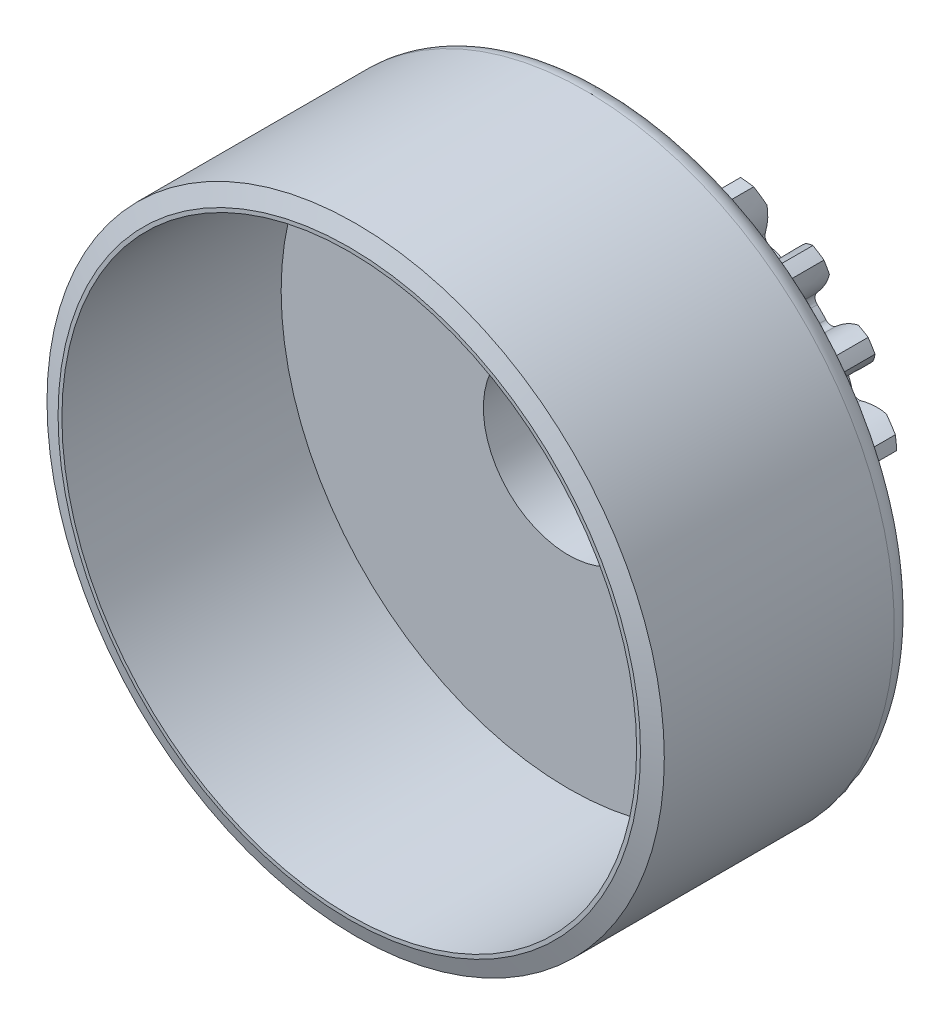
ISO-10303-21;
HEADER;
FILE_DESCRIPTION(('STEP AP214'),'2;1');
FILE_NAME('part.step','',(''),(''),'','','');
FILE_SCHEMA(('AUTOMOTIVE_DESIGN { 1 0 10303 214 1 1 1 1 }'));
ENDSEC;
DATA;
#1=APPLICATION_CONTEXT('core data for automotive mechanical design processes');
#2=APPLICATION_PROTOCOL_DEFINITION('international standard','automotive_design',2000,#1);
#3=PRODUCT_CONTEXT('',#1,'mechanical');
#4=PRODUCT('Part','Part','',(#3));
#5=PRODUCT_RELATED_PRODUCT_CATEGORY('part','',(#4));
#6=PRODUCT_DEFINITION_FORMATION('','',#4);
#7=PRODUCT_DEFINITION_CONTEXT('part definition',#1,'design');
#8=PRODUCT_DEFINITION('design','',#6,#7);
#9=PRODUCT_DEFINITION_SHAPE('','',#8);
#10=(LENGTH_UNIT() NAMED_UNIT(*) SI_UNIT(.MILLI.,.METRE.));
#11=(NAMED_UNIT(*) PLANE_ANGLE_UNIT() SI_UNIT($,.RADIAN.));
#12=(NAMED_UNIT(*) SI_UNIT($,.STERADIAN.) SOLID_ANGLE_UNIT());
#13=UNCERTAINTY_MEASURE_WITH_UNIT(LENGTH_MEASURE(1.E-05),#10,'distance_accuracy_value','');
#14=(GEOMETRIC_REPRESENTATION_CONTEXT(3) GLOBAL_UNCERTAINTY_ASSIGNED_CONTEXT((#13)) GLOBAL_UNIT_ASSIGNED_CONTEXT((#10,
#11,#12)) REPRESENTATION_CONTEXT('',''));
#15=CARTESIAN_POINT('',(0.,0.,0.));
#16=DIRECTION('',(0.,0.,1.));
#17=DIRECTION('',(1.,0.,0.));
#18=AXIS2_PLACEMENT_3D('',#15,#16,#17);
#19=CARTESIAN_POINT('',(0.,0.,0.));
#20=DIRECTION('',(0.,0.,1.));
#21=DIRECTION('',(1.,0.,0.));
#22=AXIS2_PLACEMENT_3D('',#19,#20,#21);
#23=PLANE('',#22);
#24=CARTESIAN_POINT('',(7.6295760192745,-2.40615248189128,0.));
#25=CARTESIAN_POINT('',(7.37335907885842,-2.12573553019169,0.));
#26=CARTESIAN_POINT('',(6.94341245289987,-1.65517990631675,0.));
#27=CARTESIAN_POINT('',(6.10029846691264,-1.36980855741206,0.));
#28=CARTESIAN_POINT('',(5.39702913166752,-1.26299759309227,0.));
#29=CARTESIAN_POINT('',(4.98072562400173,-1.41706767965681,0.));
#30=CARTESIAN_POINT('',(4.80403488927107,-1.48245929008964,0.));
#31=B_SPLINE_CURVE_WITH_KNOTS('',3,(#24,#25,#26,#27,#28,#29,#30),.UNSPECIFIED.,.F.,.F.,(4,1,1,1,
4),(0.,0.350126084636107,0.587531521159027,0.824936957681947,1.),.UNSPECIFIED.);
#32=CARTESIAN_POINT('',(7.039434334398,-1.82462538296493,0.));
#33=VERTEX_POINT('',#32);
#34=CARTESIAN_POINT('',(5.93209852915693,-1.35596514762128,0.));
#35=VERTEX_POINT('',#34);
#36=EDGE_CURVE('E1608',#33,#35,#31,.T.);
#37=ORIENTED_EDGE('',*,*,#36,.F.);
#38=CARTESIAN_POINT('',(0.,0.,0.));
#39=DIRECTION('',(0.,0.,-1.));
#40=DIRECTION('',(-1.,0.,0.));
#41=AXIS2_PLACEMENT_3D('',#38,#39,#40);
#42=CIRCLE('',#41,7.27206253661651);
#43=CARTESIAN_POINT('',(6.59610585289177,-3.06174478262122,0.));
#44=VERTEX_POINT('',#43);
#45=EDGE_CURVE('E2171',#33,#44,#42,.T.);
#46=ORIENTED_EDGE('',*,*,#45,.T.);
#47=CARTESIAN_POINT('',(4.65217598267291,-1.90622543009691,0.));
#48=CARTESIAN_POINT('',(4.74711723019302,-2.06895784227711,0.));
#49=CARTESIAN_POINT('',(4.97080962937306,-2.4523739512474,0.));
#50=CARTESIAN_POINT('',(5.58184973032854,-2.81655293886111,0.));
#51=CARTESIAN_POINT('',(6.41431666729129,-3.13163514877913,0.));
#52=CARTESIAN_POINT('',(7.04527560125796,-3.04126081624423,0.));
#53=CARTESIAN_POINT('',(7.42128126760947,-2.98740428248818,0.));
#54=B_SPLINE_CURVE_WITH_KNOTS('',3,(#47,#48,#49,#50,#51,#52,#53),.UNSPECIFIED.,.F.,.F.,(4,1,1,1,
4),(0.,0.175063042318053,0.412468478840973,0.649873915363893,1.),.UNSPECIFIED.);
#55=CARTESIAN_POINT('',(5.44314087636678,-2.72041390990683,0.));
#56=VERTEX_POINT('',#55);
#57=EDGE_CURVE('E1598',#56,#44,#54,.T.);
#58=ORIENTED_EDGE('',*,*,#57,.F.);
#59=CARTESIAN_POINT('',(5.28444107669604,-3.01350649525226,0.));
#60=DIRECTION('',(0.,0.,1.));
#61=DIRECTION('',(1.,0.,0.));
#62=AXIS2_PLACEMENT_3D('',#59,#60,#61);
#63=CIRCLE('',#62,0.3333);
#64=CARTESIAN_POINT('',(4.99491003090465,-2.84839845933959,0.));
#65=VERTEX_POINT('',#64);
#66=EDGE_CURVE('E1556',#56,#65,#63,.T.);
#67=ORIENTED_EDGE('',*,*,#66,.T.);
#68=CARTESIAN_POINT('',(0.,0.,0.));
#69=DIRECTION('',(0.,0.,1.));
#70=DIRECTION('',(1.,0.,0.));
#71=AXIS2_PLACEMENT_3D('',#68,#69,#70);
#72=CIRCLE('',#71,5.75);
#73=CARTESIAN_POINT('',(4.68403388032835,-3.33501523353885,0.));
#74=VERTEX_POINT('',#73);
#75=EDGE_CURVE('E2559',#74,#65,#72,.T.);
#76=ORIENTED_EDGE('',*,*,#75,.F.);
#77=CARTESIAN_POINT('',(4.95554492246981,-3.52833011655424,0.));
#78=DIRECTION('',(0.,0.,1.));
#79=DIRECTION('',(1.,0.,0.));
#80=AXIS2_PLACEMENT_3D('',#77,#78,#79);
#81=CIRCLE('',#80,0.3333);
#82=CARTESIAN_POINT('',(4.75630486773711,-3.79552347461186,0.));
#83=VERTEX_POINT('',#82);
#84=EDGE_CURVE('E1543',#74,#83,#81,.T.);
#85=ORIENTED_EDGE('',*,*,#84,.T.);
#86=CARTESIAN_POINT('',(5.8300200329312,-5.47821744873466,0.));
#87=CARTESIAN_POINT('',(5.72084490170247,-5.11440214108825,0.));
#88=CARTESIAN_POINT('',(5.53764281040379,-4.50389932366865,0.));
#89=CARTESIAN_POINT('',(4.90184134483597,-3.88097517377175,0.));
#90=CARTESIAN_POINT('',(4.31456110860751,-3.47960469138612,0.));
#91=CARTESIAN_POINT('',(3.87263610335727,-3.43778972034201,0.));
#92=CARTESIAN_POINT('',(3.68507089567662,-3.42004228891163,0.));
#93=B_SPLINE_CURVE_WITH_KNOTS('',3,(#86,#87,#88,#89,#90,#91,#92),.UNSPECIFIED.,.F.,.F.,(4,1,1,1,
4),(0.,0.350126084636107,0.587531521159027,0.824936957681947,1.),.UNSPECIFIED.);
#94=CARTESIAN_POINT('',(5.55063589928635,-4.69822675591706,0.));
#95=VERTEX_POINT('',#94);
#96=EDGE_CURVE('E2327',#95,#83,#93,.T.);
#97=ORIENTED_EDGE('',*,*,#96,.F.);
#98=CARTESIAN_POINT('',(4.61444474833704,-5.62047980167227,0.));
#99=VERTEX_POINT('',#98);
#100=EDGE_CURVE('E2175',#95,#99,#42,.T.);
#101=ORIENTED_EDGE('',*,*,#100,.T.);
#102=CARTESIAN_POINT('',(3.36438551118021,-3.73595327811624,0.));
#103=CARTESIAN_POINT('',(3.37931767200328,-3.92376357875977,0.));
#104=CARTESIAN_POINT('',(3.41449954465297,-4.3662660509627,0.));
#105=CARTESIAN_POINT('',(3.80701631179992,-4.95950034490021,0.));
#106=CARTESIAN_POINT('',(4.42033405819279,-5.60457347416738,0.));
#107=CARTESIAN_POINT('',(5.02802036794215,-5.79691183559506,0.));
#108=CARTESIAN_POINT('',(5.39015724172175,-5.91153151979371,0.));
#109=B_SPLINE_CURVE_WITH_KNOTS('',3,(#102,#103,#104,#105,#106,#107,#108),.UNSPECIFIED.,.F.,.F.,
(4,1,1,1,4),(0.,0.175063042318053,0.412468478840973,0.649873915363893,1.),.UNSPECIFIED.);
#110=CARTESIAN_POINT('',(3.72375711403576,-4.81269855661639,0.));
#111=VERTEX_POINT('',#110);
#112=EDGE_CURVE('E2334',#111,#99,#109,.T.);
#113=ORIENTED_EDGE('',*,*,#112,.F.);
#114=CARTESIAN_POINT('',(3.45360542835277,-5.00790858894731,0.));
#115=DIRECTION('',(0.,0.,1.));
#116=DIRECTION('',(1.,0.,0.));
#117=AXIS2_PLACEMENT_3D('',#114,#115,#116);
#118=CIRCLE('',#117,0.3333);
#119=CARTESIAN_POINT('',(3.26438466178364,-4.73352857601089,0.));
#120=VERTEX_POINT('',#119);
#121=EDGE_CURVE('E1535',#111,#120,#118,.T.);
#122=ORIENTED_EDGE('',*,*,#121,.T.);
#123=CARTESIAN_POINT('',(2.77315982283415,-5.03707103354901,0.));
#124=VERTEX_POINT('',#123);
#125=EDGE_CURVE('E2554',#124,#120,#72,.T.);
#126=ORIENTED_EDGE('',*,*,#125,.F.);
#127=CARTESIAN_POINT('',(2.93390663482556,-5.32904595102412,0.));
#128=DIRECTION('',(0.,0.,1.));
#129=DIRECTION('',(1.,0.,0.));
#130=AXIS2_PLACEMENT_3D('',#127,#128,#129);
#131=CIRCLE('',#130,0.3333);
#132=CARTESIAN_POINT('',(2.6384666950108,-5.48333182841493,0.));
#133=VERTEX_POINT('',#132);
#134=EDGE_CURVE('E1522',#124,#133,#131,.T.);
#135=ORIENTED_EDGE('',*,*,#134,.T.);
#136=CARTESIAN_POINT('',(2.8757570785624,-7.46525426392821,0.));
#137=CARTESIAN_POINT('',(2.93524723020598,-7.09009868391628,0.));
#138=CARTESIAN_POINT('',(3.03507509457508,-6.46056624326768,0.));
#139=CARTESIAN_POINT('',(2.73251442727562,-5.623467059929,0.));
#140=CARTESIAN_POINT('',(2.3775413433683,-5.00703340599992,0.));
#141=CARTESIAN_POINT('',(1.99752350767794,-4.77761534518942,0.));
#142=CARTESIAN_POINT('',(1.83623341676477,-4.68024396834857,0.));
#143=B_SPLINE_CURVE_WITH_KNOTS('',3,(#136,#137,#138,#139,#140,#141,#142),.UNSPECIFIED.,.F.,.F.,
(4,1,1,1,4),(0.,0.350126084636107,0.587531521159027,0.824936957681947,1.),.UNSPECIFIED.);
#144=CARTESIAN_POINT('',(2.96246595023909,-6.64128669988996,0.));
#145=VERTEX_POINT('',#144);
#146=EDGE_CURVE('E1667',#145,#133,#143,.T.);
#147=ORIENTED_EDGE('',*,*,#146,.F.);
#148=CARTESIAN_POINT('',(1.7188362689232,-7.06600986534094,0.));
#149=VERTEX_POINT('',#148);
#150=EDGE_CURVE('E2178',#145,#149,#42,.T.);
#151=ORIENTED_EDGE('',*,*,#150,.T.);
#152=CARTESIAN_POINT('',(1.41023722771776,-4.82572976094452,0.));
#153=CARTESIAN_POINT('',(1.34220280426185,-5.00141981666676,0.));
#154=CARTESIAN_POINT('',(1.18190594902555,-5.41536561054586,0.));
#155=CARTESIAN_POINT('',(1.27815662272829,-6.12015788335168,0.));
#156=CARTESIAN_POINT('',(1.55085007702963,-6.96745728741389,0.));
#157=CARTESIAN_POINT('',(2.01490403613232,-7.4044133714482,0.));
#158=CARTESIAN_POINT('',(2.29144646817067,-7.66480743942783,0.));
#159=B_SPLINE_CURVE_WITH_KNOTS('',3,(#152,#153,#154,#155,#156,#157,#158),.UNSPECIFIED.,.F.,.F.,
(4,1,1,1,4),(0.,0.175063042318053,0.412468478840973,0.649873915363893,1.),.UNSPECIFIED.);
#160=CARTESIAN_POINT('',(1.26683758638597,-5.95176923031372,0.));
#161=VERTEX_POINT('',#160);
#162=EDGE_CURVE('E1662',#161,#149,#159,.T.);
#163=ORIENTED_EDGE('',*,*,#162,.F.);
#164=CARTESIAN_POINT('',(0.938740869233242,-6.01043296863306,0.));
#165=DIRECTION('',(0.,0.,1.));
#166=DIRECTION('',(1.,0.,0.));
#167=AXIS2_PLACEMENT_3D('',#164,#165,#166);
#168=CIRCLE('',#167,0.3333);
#169=CARTESIAN_POINT('',(0.887307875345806,-5.68112530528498,0.));
#170=VERTEX_POINT('',#169);
#171=EDGE_CURVE('E1514',#161,#170,#168,.T.);
#172=ORIENTED_EDGE('',*,*,#171,.T.);
#173=CARTESIAN_POINT('',(0.31302745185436,-5.74147313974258,0.));
#174=VERTEX_POINT('',#173);
#175=EDGE_CURVE('E2549',#174,#170,#72,.T.);
#176=ORIENTED_EDGE('',*,*,#175,.F.);
#177=CARTESIAN_POINT('',(0.331172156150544,-6.0742788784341,0.));
#178=DIRECTION('',(0.,0.,1.));
#179=DIRECTION('',(1.,0.,0.));
#180=AXIS2_PLACEMENT_3D('',#177,#178,#179);
#181=CIRCLE('',#180,0.3333);
#182=CARTESIAN_POINT('',(-0.00195216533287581,-6.08509906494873,0.));
#183=VERTEX_POINT('',#182);
#184=EDGE_CURVE('E1501',#174,#183,#181,.T.);
#185=ORIENTED_EDGE('',*,*,#184,.T.);
#186=CARTESIAN_POINT('',(-0.648084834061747,-7.97370591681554,0.));
#187=CARTESIAN_POINT('',(-0.431712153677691,-7.66151422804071,0.));
#188=CARTESIAN_POINT('',(-0.068626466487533,-7.13763878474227,0.));
#189=CARTESIAN_POINT('',(0.0219795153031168,-6.2521623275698,0.));
#190=CARTESIAN_POINT('',(-0.03037964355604,-5.54275774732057,0.));
#191=CARTESIAN_POINT('',(-0.273223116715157,-5.17117565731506,0.));
#192=CARTESIAN_POINT('',(-0.376292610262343,-5.01346593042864,0.));
#193=B_SPLINE_CURVE_WITH_KNOTS('',3,(#186,#187,#188,#189,#190,#191,#192),.UNSPECIFIED.,.F.,.F.,
(4,1,1,1,4),(0.,0.350126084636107,0.587531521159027,0.824936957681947,1.),.UNSPECIFIED.);
#194=CARTESIAN_POINT('',(-0.212456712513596,-7.26895836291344,0.));
#195=VERTEX_POINT('',#194);
#196=EDGE_CURVE('E2285',#195,#183,#193,.T.);
#197=ORIENTED_EDGE('',*,*,#196,.F.);
#198=CARTESIAN_POINT('',(-1.51720881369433,-7.11203001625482,0.));
#199=VERTEX_POINT('',#198);
#200=EDGE_CURVE('E2183',#195,#199,#42,.T.);
#201=ORIENTED_EDGE('',*,*,#200,.T.);
#202=CARTESIAN_POINT('',(-0.823225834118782,-4.95971128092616,0.));
#203=CARTESIAN_POINT('',(-0.960751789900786,-5.08848352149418,0.));
#204=CARTESIAN_POINT('',(-1.2847786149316,-5.39188559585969,0.));
#205=CARTESIAN_POINT('',(-1.50385766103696,-6.06864309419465,0.));
#206=CARTESIAN_POINT('',(-1.62579878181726,-6.95035073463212,0.));
#207=CARTESIAN_POINT('',(-1.39728875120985,-7.54538002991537,0.));
#208=CARTESIAN_POINT('',(-1.26111338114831,-7.89997424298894,0.));
#209=B_SPLINE_CURVE_WITH_KNOTS('',3,(#202,#203,#204,#205,#206,#207,#208),.UNSPECIFIED.,.F.,.F.,
(4,1,1,1,4),(0.,0.175063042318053,0.412468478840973,0.649873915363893,1.),.UNSPECIFIED.);
#210=CARTESIAN_POINT('',(-1.44099466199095,-5.91201901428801,0.));
#211=VERTEX_POINT('',#210);
#212=EDGE_CURVE('E2292',#211,#199,#209,.T.);
#213=ORIENTED_EDGE('',*,*,#212,.F.);
#214=CARTESIAN_POINT('',(-1.76205283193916,-5.82251738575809,0.));
#215=DIRECTION('',(0.,0.,1.));
#216=DIRECTION('',(1.,0.,0.));
#217=AXIS2_PLACEMENT_3D('',#214,#215,#216);
#218=CIRCLE('',#217,0.3333);
#219=CARTESIAN_POINT('',(-1.66551111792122,-5.50350549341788,0.));
#220=VERTEX_POINT('',#219);
#221=EDGE_CURVE('E1493',#211,#220,#218,.T.);
#222=ORIENTED_EDGE('',*,*,#221,.T.);
#223=CARTESIAN_POINT('',(-2.20910384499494,-5.30870607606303,0.));
#224=VERTEX_POINT('',#223);
#225=EDGE_CURVE('E2544',#224,#220,#72,.T.);
#226=ORIENTED_EDGE('',*,*,#225,.F.);
#227=CARTESIAN_POINT('',(-2.33715502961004,-5.61642637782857,0.));
#228=DIRECTION('',(0.,0.,1.));
#229=DIRECTION('',(1.,0.,0.));
#230=AXIS2_PLACEMENT_3D('',#227,#228,#229);
#231=CIRCLE('',#230,0.3333);
#232=CARTESIAN_POINT('',(-2.64198437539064,-5.48163780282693,0.));
#233=VERTEX_POINT('',#232);
#234=EDGE_CURVE('E1480',#224,#233,#231,.T.);
#235=ORIENTED_EDGE('',*,*,#234,.T.);
#236=CARTESIAN_POINT('',(-4.04356559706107,-6.90286732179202,0.));
#237=CARTESIAN_POINT('',(-3.71316565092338,-6.71547291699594,0.));
#238=CARTESIAN_POINT('',(-3.1587357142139,-6.40101442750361,0.));
#239=CARTESIAN_POINT('',(-2.69290870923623,-5.64254016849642,0.));
#240=CARTESIAN_POINT('',(-2.43228356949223,-4.98067093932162,0.));
#241=CARTESIAN_POINT('',(-2.48985455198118,-4.54052121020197,0.));
#242=CARTESIAN_POINT('',(-2.51428927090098,-4.35370947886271,0.));
#243=B_SPLINE_CURVE_WITH_KNOTS('',3,(#236,#237,#238,#239,#240,#241,#242),.UNSPECIFIED.,.F.,.F.,
(4,1,1,1,4),(0.,0.350126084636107,0.587531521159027,0.824936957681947,1.),.UNSPECIFIED.);
#244=CARTESIAN_POINT('',(-3.34529971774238,-6.45692367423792,0.));
#245=VERTEX_POINT('',#244);
#246=EDGE_CURVE('E1725',#245,#233,#243,.T.);
#247=ORIENTED_EDGE('',*,*,#246,.F.);
#248=CARTESIAN_POINT('',(-4.45275208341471,-5.74942539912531,0.));
#249=VERTEX_POINT('',#248);
#250=EDGE_CURVE('E2187',#245,#249,#42,.T.);
#251=ORIENTED_EDGE('',*,*,#250,.T.);
#252=CARTESIAN_POINT('',(-2.8936389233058,-4.11136115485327,0.));
#253=CARTESIAN_POINT('',(-3.07341770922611,-4.16771065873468,0.));
#254=CARTESIAN_POINT('',(-3.49699701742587,-4.30047651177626,0.));
#255=CARTESIAN_POINT('',(-3.98801449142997,-4.81515911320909,0.));
#256=CARTESIAN_POINT('',(-4.48043825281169,-5.5566419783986,0.));
#257=CARTESIAN_POINT('',(-4.53273136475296,-6.19189163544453,0.));
#258=CARTESIAN_POINT('',(-4.56389425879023,-6.5704542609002,0.));
#259=B_SPLINE_CURVE_WITH_KNOTS('',3,(#252,#253,#254,#255,#256,#257,#258),.UNSPECIFIED.,.F.,.F.,
(4,1,1,1,4),(0.,0.175063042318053,0.412468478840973,0.649873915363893,1.),.UNSPECIFIED.);
#260=CARTESIAN_POINT('',(-3.86342024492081,-4.70132092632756,0.));
#261=VERTEX_POINT('',#260);
#262=EDGE_CURVE('E1721',#261,#249,#259,.T.);
#263=ORIENTED_EDGE('',*,*,#262,.F.);
#264=CARTESIAN_POINT('',(-4.11385035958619,-4.48138082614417,0.));
#265=DIRECTION('',(0.,0.,1.));
#266=DIRECTION('',(1.,0.,0.));
#267=AXIS2_PLACEMENT_3D('',#264,#265,#266);
#268=CIRCLE('',#267,0.3333);
#269=CARTESIAN_POINT('',(-3.88845520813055,-4.23584892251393,0.));
#270=VERTEX_POINT('',#269);
#271=EDGE_CURVE('E1472',#261,#270,#268,.T.);
#272=ORIENTED_EDGE('',*,*,#271,.T.);
#273=CARTESIAN_POINT('',(-4.29369503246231,-3.82448466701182,0.));
#274=VERTEX_POINT('',#273);
#275=EDGE_CURVE('E2539',#274,#270,#72,.T.);
#276=ORIENTED_EDGE('',*,*,#275,.F.);
#277=CARTESIAN_POINT('',(-4.54257999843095,-4.04617175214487,0.));
#278=DIRECTION('',(0.,0.,1.));
#279=DIRECTION('',(1.,0.,0.));
#280=AXIS2_PLACEMENT_3D('',#277,#278,#279);
#281=CIRCLE('',#280,0.3333);
#282=CARTESIAN_POINT('',(-4.75873917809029,-3.79247094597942,0.));
#283=VERTEX_POINT('',#282);
#284=EDGE_CURVE('E1459',#274,#283,#281,.T.);
#285=ORIENTED_EDGE('',*,*,#284,.T.);
#286=CARTESIAN_POINT('',(-6.63816860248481,-4.46483119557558,0.));
#287=CARTESIAN_POINT('',(-6.25918115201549,-4.43934983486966,0.));
#288=CARTESIAN_POINT('',(-5.62321861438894,-4.39659065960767,0.));
#289=CARTESIAN_POINT('',(-4.87443333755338,-3.91534372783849,0.));
#290=CARTESIAN_POINT('',(-4.3524439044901,-3.43210116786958,0.));
#291=CARTESIAN_POINT('',(-4.21333975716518,-3.01056085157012,0.));
#292=CARTESIAN_POINT('',(-4.15430010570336,-2.83164747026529,0.));
#293=B_SPLINE_CURVE_WITH_KNOTS('',3,(#286,#287,#288,#289,#290,#291,#292),.UNSPECIFIED.,.F.,.F.,
(4,1,1,1,4),(0.,0.350126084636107,0.587531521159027,0.824936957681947,1.),.UNSPECIFIED.);
#294=CARTESIAN_POINT('',(-5.81556508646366,-4.36601606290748,0.));
#295=VERTEX_POINT('',#294);
#296=EDGE_CURVE('E2239',#295,#283,#293,.T.);
#297=ORIENTED_EDGE('',*,*,#296,.F.);
#298=CARTESIAN_POINT('',(-6.50637319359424,-3.24807656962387,0.));
#299=VERTEX_POINT('',#298);
#300=EDGE_CURVE('E2192',#295,#299,#42,.T.);
#301=ORIENTED_EDGE('',*,*,#300,.T.);
#302=CARTESIAN_POINT('',(-4.39093133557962,-2.4487055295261,0.));
#303=CARTESIAN_POINT('',(-4.5773555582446,-2.42147158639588,0.));
#304=CARTESIAN_POINT('',(-5.01659227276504,-2.35730531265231,0.));
#305=CARTESIAN_POINT('',(-5.68229614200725,-2.60797381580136,0.));
#306=CARTESIAN_POINT('',(-6.44767197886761,-3.06237213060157,0.));
#307=CARTESIAN_POINT('',(-6.77041094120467,-3.61202316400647,0.));
#308=CARTESIAN_POINT('',(-6.96273990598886,-3.93957523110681,0.));
#309=B_SPLINE_CURVE_WITH_KNOTS('',3,(#302,#303,#304,#305,#306,#307,#308),.UNSPECIFIED.,.F.,.F.,
(4,1,1,1,4),(0.,0.175063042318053,0.412468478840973,0.649873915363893,1.),.UNSPECIFIED.);
#310=CARTESIAN_POINT('',(-5.52064806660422,-2.55946857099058,0.));
#311=VERTEX_POINT('',#310);
#312=EDGE_CURVE('E1736',#311,#299,#309,.T.);
#313=ORIENTED_EDGE('',*,*,#312,.F.);
#314=CARTESIAN_POINT('',(-5.65084937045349,-2.25265183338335,0.));
#315=DIRECTION('',(0.,0.,1.));
#316=DIRECTION('',(1.,0.,0.));
#317=AXIS2_PLACEMENT_3D('',#314,#315,#316);
#318=CIRCLE('',#317,0.3333);
#319=CARTESIAN_POINT('',(-5.34124305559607,-2.12923052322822,0.));
#320=VERTEX_POINT('',#319);
#321=EDGE_CURVE('E1451',#311,#320,#318,.T.);
#322=ORIENTED_EDGE('',*,*,#321,.T.);
#323=CARTESIAN_POINT('',(-5.52786726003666,-1.58277716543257,0.));
#324=VERTEX_POINT('',#323);
#325=EDGE_CURVE('E2536',#324,#320,#72,.T.);
#326=ORIENTED_EDGE('',*,*,#325,.F.);
#327=CARTESIAN_POINT('',(-5.84829128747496,-1.67452318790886,0.));
#328=DIRECTION('',(0.,0.,1.));
#329=DIRECTION('',(1.,0.,0.));
#330=AXIS2_PLACEMENT_3D('',#327,#328,#329);
#331=CIRCLE('',#330,0.3333);
#332=CARTESIAN_POINT('',(-5.93296732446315,-1.35215870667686,0.));
#333=VERTEX_POINT('',#332);
#334=EDGE_CURVE('E1438',#324,#333,#331,.T.);
#335=ORIENTED_EDGE('',*,*,#334,.T.);
#336=CARTESIAN_POINT('',(-7.91800090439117,-1.14248049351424,0.));
#337=CARTESIAN_POINT('',(-7.56548906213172,-1.28395907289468,0.));
#338=CARTESIAN_POINT('',(-6.97395410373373,-1.52136819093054,0.));
#339=CARTESIAN_POINT('',(-6.09051666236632,-1.41266544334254,0.));
#340=CARTESIAN_POINT('',(-5.41054934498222,-1.20376166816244,0.));
#341=CARTESIAN_POINT('',(-5.10232135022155,-0.884321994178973,0.));
#342=CARTESIAN_POINT('',(-4.97150085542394,-0.748742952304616,0.));
#343=B_SPLINE_CURVE_WITH_KNOTS('',3,(#336,#337,#338,#339,#340,#341,#342),.UNSPECIFIED.,.F.,.F.,
(4,1,1,1,4),(0.,0.350126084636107,0.587531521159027,0.824936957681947,1.),.UNSPECIFIED.);
#344=CARTESIAN_POINT('',(-7.13398646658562,-1.41036542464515,0.));
#345=VERTEX_POINT('',#344);
#346=EDGE_CURVE('E1780',#345,#333,#343,.T.);
#347=ORIENTED_EDGE('',*,*,#346,.F.);
#348=CARTESIAN_POINT('',(-7.27132729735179,-0.103406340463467,0.));
#349=VERTEX_POINT('',#348);
#350=EDGE_CURVE('E970',#345,#349,#42,.T.);
#351=ORIENTED_EDGE('',*,*,#350,.T.);
#352=CARTESIAN_POINT('',(-5.01854594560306,-0.301053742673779,0.));
#353=CARTESIAN_POINT('',(-5.17469200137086,-0.195630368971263,0.));
#354=CARTESIAN_POINT('',(-5.54258990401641,0.0527591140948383,0.));
#355=CARTESIAN_POINT('',(-6.25112935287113,0.115752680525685,0.));
#356=CARTESIAN_POINT('',(-7.13786519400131,0.0384380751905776,0.));
#357=CARTESIAN_POINT('',(-7.66712759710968,-0.316749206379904,0.));
#358=CARTESIAN_POINT('',(-7.98252952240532,-0.528415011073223,0.));
#359=B_SPLINE_CURVE_WITH_KNOTS('',3,(#352,#353,#354,#355,#356,#357,#358),.UNSPECIFIED.,.F.,.F.,
(4,1,1,1,4),(0.,0.175063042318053,0.412468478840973,0.649873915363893,1.),.UNSPECIFIED.);
#360=CARTESIAN_POINT('',(-6.08444383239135,0.0893179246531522,0.));
#361=VERTEX_POINT('',#360);
#362=EDGE_CURVE('E1775',#361,#349,#359,.T.);
#363=ORIENTED_EDGE('',*,*,#362,.F.);
#364=CARTESIAN_POINT('',(-6.06862836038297,0.422242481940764,0.));
#365=DIRECTION('',(0.,0.,1.));
#366=DIRECTION('',(1.,0.,0.));
#367=AXIS2_PLACEMENT_3D('',#364,#365,#366);
#368=CIRCLE('',#367,0.3333);
#369=CARTESIAN_POINT('',(-5.73613220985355,0.399108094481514,0.));
#370=VERTEX_POINT('',#369);
#371=EDGE_CURVE('E1430',#361,#370,#368,.T.);
#372=ORIENTED_EDGE('',*,*,#371,.T.);
#373=CARTESIAN_POINT('',(-5.66717758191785,0.972418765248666,0.));
#374=VERTEX_POINT('',#373);
#375=EDGE_CURVE('E2532',#374,#370,#72,.T.);
#376=ORIENTED_EDGE('',*,*,#375,.F.);
#377=CARTESIAN_POINT('',(-5.99567676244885,1.02878523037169,0.));
#378=DIRECTION('',(0.,0.,1.));
#379=DIRECTION('',(1.,0.,0.));
#380=AXIS2_PLACEMENT_3D('',#377,#378,#379);
#381=CIRCLE('',#380,0.3333);
#382=CARTESIAN_POINT('',(-5.93209852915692,1.35596514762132,0.));
#383=VERTEX_POINT('',#382);
#384=EDGE_CURVE('E985',#374,#383,#381,.T.);
#385=ORIENTED_EDGE('',*,*,#384,.T.);
#386=CARTESIAN_POINT('',(-7.62957601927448,2.40615248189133,0.));
#387=CARTESIAN_POINT('',(-7.3733590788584,2.12573553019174,0.));
#388=CARTESIAN_POINT('',(-6.94341245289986,1.65517990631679,0.));
#389=CARTESIAN_POINT('',(-6.10029846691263,1.3698085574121,0.));
#390=CARTESIAN_POINT('',(-5.39702913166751,1.26299759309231,0.));
#391=CARTESIAN_POINT('',(-4.98072562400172,1.41706767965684,0.));
#392=CARTESIAN_POINT('',(-4.80403488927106,1.48245929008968,0.));
#393=B_SPLINE_CURVE_WITH_KNOTS('',3,(#386,#387,#388,#389,#390,#391,#392),.UNSPECIFIED.,.F.,.F.,
(4,1,1,1,4),(0.,0.350126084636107,0.587531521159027,0.824936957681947,1.),.UNSPECIFIED.);
#394=CARTESIAN_POINT('',(-7.03943433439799,1.82462538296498,0.));
#395=VERTEX_POINT('',#394);
#396=EDGE_CURVE('E975',#395,#383,#393,.T.);
#397=ORIENTED_EDGE('',*,*,#396,.F.);
#398=CARTESIAN_POINT('',(-6.59610585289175,3.06174478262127,0.));
#399=VERTEX_POINT('',#398);
#400=EDGE_CURVE('E956',#395,#399,#42,.T.);
#401=ORIENTED_EDGE('',*,*,#400,.T.);
#402=CARTESIAN_POINT('',(-4.65217598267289,1.90622543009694,0.));
#403=CARTESIAN_POINT('',(-4.747117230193,2.06895784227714,0.));
#404=CARTESIAN_POINT('',(-4.97080962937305,2.45237395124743,0.));
#405=CARTESIAN_POINT('',(-5.58184973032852,2.81655293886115,0.));
#406=CARTESIAN_POINT('',(-6.41431666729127,3.13163514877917,0.));
#407=CARTESIAN_POINT('',(-7.04527560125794,3.04126081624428,0.));
#408=CARTESIAN_POINT('',(-7.42128126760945,2.98740428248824,0.));
#409=B_SPLINE_CURVE_WITH_KNOTS('',3,(#402,#403,#404,#405,#406,#407,#408),.UNSPECIFIED.,.F.,.F.,
(4,1,1,1,4),(0.,0.175063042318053,0.412468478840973,0.649873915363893,1.),.UNSPECIFIED.);
#410=CARTESIAN_POINT('',(-5.44314087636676,2.72041390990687,0.));
#411=VERTEX_POINT('',#410);
#412=EDGE_CURVE('E988',#411,#399,#409,.T.);
#413=ORIENTED_EDGE('',*,*,#412,.F.);
#414=CARTESIAN_POINT('',(-5.28444107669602,3.0135064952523,0.));
#415=DIRECTION('',(0.,0.,1.));
#416=DIRECTION('',(1.,0.,0.));
#417=AXIS2_PLACEMENT_3D('',#414,#415,#416);
#418=CIRCLE('',#417,0.3333);
#419=CARTESIAN_POINT('',(-4.99491003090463,2.84839845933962,0.));
#420=VERTEX_POINT('',#419);
#421=EDGE_CURVE('E1411',#411,#420,#418,.T.);
#422=ORIENTED_EDGE('',*,*,#421,.T.);
#423=CARTESIAN_POINT('',(-4.68403388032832,3.33501523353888,0.));
#424=VERTEX_POINT('',#423);
#425=EDGE_CURVE('E2527',#424,#420,#72,.T.);
#426=ORIENTED_EDGE('',*,*,#425,.F.);
#427=CARTESIAN_POINT('',(-4.95554492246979,3.52833011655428,0.));
#428=DIRECTION('',(0.,0.,1.));
#429=DIRECTION('',(1.,0.,0.));
#430=AXIS2_PLACEMENT_3D('',#427,#428,#429);
#431=CIRCLE('',#430,0.3333);
#432=CARTESIAN_POINT('',(-4.75630486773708,3.7955234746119,0.));
#433=VERTEX_POINT('',#432);
#434=EDGE_CURVE('E1399',#424,#433,#431,.T.);
#435=ORIENTED_EDGE('',*,*,#434,.T.);
#436=CARTESIAN_POINT('',(-5.83002003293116,5.4782174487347,0.));
#437=CARTESIAN_POINT('',(-5.72084490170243,5.11440214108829,0.));
#438=CARTESIAN_POINT('',(-5.53764281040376,4.50389932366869,0.));
#439=CARTESIAN_POINT('',(-4.90184134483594,3.88097517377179,0.));
#440=CARTESIAN_POINT('',(-4.31456110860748,3.47960469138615,0.));
#441=CARTESIAN_POINT('',(-3.87263610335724,3.43778972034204,0.));
#442=CARTESIAN_POINT('',(-3.68507089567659,3.42004228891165,0.));
#443=B_SPLINE_CURVE_WITH_KNOTS('',3,(#436,#437,#438,#439,#440,#441,#442),.UNSPECIFIED.,.F.,.F.,
(4,1,1,1,4),(0.,0.350126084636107,0.587531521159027,0.824936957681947,1.),.UNSPECIFIED.);
#444=CARTESIAN_POINT('',(-5.55063589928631,4.6982267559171,0.));
#445=VERTEX_POINT('',#444);
#446=EDGE_CURVE('E1828',#445,#433,#443,.T.);
#447=ORIENTED_EDGE('',*,*,#446,.F.);
#448=CARTESIAN_POINT('',(-4.614444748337,5.62047980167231,0.));
#449=VERTEX_POINT('',#448);
#450=EDGE_CURVE('E968',#445,#449,#42,.T.);
#451=ORIENTED_EDGE('',*,*,#450,.T.);
#452=CARTESIAN_POINT('',(-3.36438551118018,3.73595327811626,0.));
#453=CARTESIAN_POINT('',(-3.37931767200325,3.9237635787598,0.));
#454=CARTESIAN_POINT('',(-3.41449954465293,4.36626605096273,0.));
#455=CARTESIAN_POINT('',(-3.80701631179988,4.95950034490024,0.));
#456=CARTESIAN_POINT('',(-4.42033405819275,5.60457347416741,0.));
#457=CARTESIAN_POINT('',(-5.0280203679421,5.7969118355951,0.));
#458=CARTESIAN_POINT('',(-5.39015724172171,5.91153151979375,0.));
#459=B_SPLINE_CURVE_WITH_KNOTS('',3,(#452,#453,#454,#455,#456,#457,#458),.UNSPECIFIED.,.F.,.F.,
(4,1,1,1,4),(0.,0.175063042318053,0.412468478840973,0.649873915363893,1.),.UNSPECIFIED.);
#460=CARTESIAN_POINT('',(-3.72375711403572,4.81269855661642,0.));
#461=VERTEX_POINT('',#460);
#462=EDGE_CURVE('E1823',#461,#449,#459,.T.);
#463=ORIENTED_EDGE('',*,*,#462,.F.);
#464=CARTESIAN_POINT('',(-3.45360542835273,5.00790858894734,0.));
#465=DIRECTION('',(0.,0.,1.));
#466=DIRECTION('',(1.,0.,0.));
#467=AXIS2_PLACEMENT_3D('',#464,#465,#466);
#468=CIRCLE('',#467,0.3333);
#469=CARTESIAN_POINT('',(-3.2643846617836,4.73352857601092,0.));
#470=VERTEX_POINT('',#469);
#471=EDGE_CURVE('E1391',#461,#470,#468,.T.);
#472=ORIENTED_EDGE('',*,*,#471,.T.);
#473=CARTESIAN_POINT('',(-2.77315982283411,5.03707103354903,0.));
#474=VERTEX_POINT('',#473);
#475=EDGE_CURVE('E2524',#474,#470,#72,.T.);
#476=ORIENTED_EDGE('',*,*,#475,.F.);
#477=CARTESIAN_POINT('',(-2.93390663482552,5.32904595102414,0.));
#478=DIRECTION('',(0.,0.,1.));
#479=DIRECTION('',(1.,0.,0.));
#480=AXIS2_PLACEMENT_3D('',#477,#478,#479);
#481=CIRCLE('',#480,0.3333);
#482=CARTESIAN_POINT('',(-2.63846669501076,5.48333182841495,0.));
#483=VERTEX_POINT('',#482);
#484=EDGE_CURVE('E1378',#474,#483,#481,.T.);
#485=ORIENTED_EDGE('',*,*,#484,.T.);
#486=CARTESIAN_POINT('',(-2.87575707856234,7.46525426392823,0.));
#487=CARTESIAN_POINT('',(-2.93524723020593,7.0900986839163,0.));
#488=CARTESIAN_POINT('',(-3.03507509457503,6.4605662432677,0.));
#489=CARTESIAN_POINT('',(-2.73251442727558,5.62346705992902,0.));
#490=CARTESIAN_POINT('',(-2.37754134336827,5.00703340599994,0.));
#491=CARTESIAN_POINT('',(-1.9975235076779,4.77761534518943,0.));
#492=CARTESIAN_POINT('',(-1.83623341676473,4.68024396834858,0.));
#493=B_SPLINE_CURVE_WITH_KNOTS('',3,(#486,#487,#488,#489,#490,#491,#492),.UNSPECIFIED.,.F.,.F.,
(4,1,1,1,4),(0.,0.350126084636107,0.587531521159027,0.824936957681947,1.),.UNSPECIFIED.);
#494=CARTESIAN_POINT('',(-2.96246595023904,6.64128669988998,0.));
#495=VERTEX_POINT('',#494);
#496=EDGE_CURVE('E2081',#495,#483,#493,.T.);
#497=ORIENTED_EDGE('',*,*,#496,.F.);
#498=CARTESIAN_POINT('',(-1.71883626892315,7.06600986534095,0.));
#499=VERTEX_POINT('',#498);
#500=EDGE_CURVE('E2673',#495,#499,#42,.T.);
#501=ORIENTED_EDGE('',*,*,#500,.T.);
#502=CARTESIAN_POINT('',(-1.41023722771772,4.82572976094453,0.));
#503=CARTESIAN_POINT('',(-1.34220280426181,5.00141981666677,0.));
#504=CARTESIAN_POINT('',(-1.18190594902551,5.41536561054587,0.));
#505=CARTESIAN_POINT('',(-1.27815662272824,6.12015788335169,0.));
#506=CARTESIAN_POINT('',(-1.55085007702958,6.9674572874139,0.));
#507=CARTESIAN_POINT('',(-2.01490403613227,7.40441337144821,0.));
#508=CARTESIAN_POINT('',(-2.29144646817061,7.66480743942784,0.));
#509=B_SPLINE_CURVE_WITH_KNOTS('',3,(#502,#503,#504,#505,#506,#507,#508),.UNSPECIFIED.,.F.,.F.,
(4,1,1,1,4),(0.,0.175063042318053,0.412468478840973,0.649873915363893,1.),.UNSPECIFIED.);
#510=CARTESIAN_POINT('',(-1.26683758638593,5.95176923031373,0.));
#511=VERTEX_POINT('',#510);
#512=EDGE_CURVE('E2088',#511,#499,#509,.T.);
#513=ORIENTED_EDGE('',*,*,#512,.F.);
#514=CARTESIAN_POINT('',(-0.938740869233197,6.01043296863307,0.));
#515=DIRECTION('',(0.,0.,1.));
#516=DIRECTION('',(1.,0.,0.));
#517=AXIS2_PLACEMENT_3D('',#514,#515,#516);
#518=CIRCLE('',#517,0.3333);
#519=CARTESIAN_POINT('',(-0.887307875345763,5.68112530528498,0.));
#520=VERTEX_POINT('',#519);
#521=EDGE_CURVE('E1370',#511,#520,#518,.T.);
#522=ORIENTED_EDGE('',*,*,#521,.T.);
#523=CARTESIAN_POINT('',(-0.313027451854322,5.74147313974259,0.));
#524=VERTEX_POINT('',#523);
#525=EDGE_CURVE('E2521',#524,#520,#72,.T.);
#526=ORIENTED_EDGE('',*,*,#525,.F.);
#527=CARTESIAN_POINT('',(-0.331172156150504,6.0742788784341,0.));
#528=DIRECTION('',(0.,0.,1.));
#529=DIRECTION('',(1.,0.,0.));
#530=AXIS2_PLACEMENT_3D('',#527,#528,#529);
#531=CIRCLE('',#530,0.3333);
#532=CARTESIAN_POINT('',(0.00195216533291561,6.08509906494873,0.));
#533=VERTEX_POINT('',#532);
#534=EDGE_CURVE('E1357',#524,#533,#531,.T.);
#535=ORIENTED_EDGE('',*,*,#534,.T.);
#536=CARTESIAN_POINT('',(0.648084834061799,7.97370591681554,0.));
#537=CARTESIAN_POINT('',(0.431712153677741,7.6615142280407,0.));
#538=CARTESIAN_POINT('',(0.0686264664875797,7.13763878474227,0.));
#539=CARTESIAN_POINT('',(-0.0219795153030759,6.2521623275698,0.));
#540=CARTESIAN_POINT('',(0.0303796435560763,5.54275774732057,0.));
#541=CARTESIAN_POINT('',(0.27322311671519,5.17117565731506,0.));
#542=CARTESIAN_POINT('',(0.376292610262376,5.01346593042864,0.));
#543=B_SPLINE_CURVE_WITH_KNOTS('',3,(#536,#537,#538,#539,#540,#541,#542),.UNSPECIFIED.,.F.,.F.,
(4,1,1,1,4),(0.,0.350126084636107,0.587531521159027,0.824936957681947,1.),.UNSPECIFIED.);
#544=CARTESIAN_POINT('',(0.212456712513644,7.26895836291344,0.));
#545=VERTEX_POINT('',#544);
#546=EDGE_CURVE('E1883',#545,#533,#543,.T.);
#547=ORIENTED_EDGE('',*,*,#546,.F.);
#548=CARTESIAN_POINT('',(1.51720881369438,7.11203001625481,0.));
#549=VERTEX_POINT('',#548);
#550=EDGE_CURVE('E2672',#545,#549,#42,.T.);
#551=ORIENTED_EDGE('',*,*,#550,.T.);
#552=CARTESIAN_POINT('',(0.823225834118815,4.95971128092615,0.));
#553=CARTESIAN_POINT('',(0.960751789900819,5.08848352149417,0.));
#554=CARTESIAN_POINT('',(1.28477861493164,5.39188559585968,0.));
#555=CARTESIAN_POINT('',(1.503857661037,6.06864309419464,0.));
#556=CARTESIAN_POINT('',(1.62579878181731,6.95035073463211,0.));
#557=CARTESIAN_POINT('',(1.3972887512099,7.54538002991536,0.));
#558=CARTESIAN_POINT('',(1.26111338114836,7.89997424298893,0.));
#559=B_SPLINE_CURVE_WITH_KNOTS('',3,(#552,#553,#554,#555,#556,#557,#558),.UNSPECIFIED.,.F.,.F.,
(4,1,1,1,4),(0.,0.175063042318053,0.412468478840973,0.649873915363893,1.),.UNSPECIFIED.);
#560=CARTESIAN_POINT('',(1.44099466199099,5.91201901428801,0.));
#561=VERTEX_POINT('',#560);
#562=EDGE_CURVE('E1878',#561,#549,#559,.T.);
#563=ORIENTED_EDGE('',*,*,#562,.F.);
#564=CARTESIAN_POINT('',(1.7620528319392,5.82251738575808,0.));
#565=DIRECTION('',(0.,0.,1.));
#566=DIRECTION('',(1.,0.,0.));
#567=AXIS2_PLACEMENT_3D('',#564,#565,#566);
#568=CIRCLE('',#567,0.3333);
#569=CARTESIAN_POINT('',(1.66551111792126,5.50350549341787,0.));
#570=VERTEX_POINT('',#569);
#571=EDGE_CURVE('E1349',#561,#570,#568,.T.);
#572=ORIENTED_EDGE('',*,*,#571,.T.);
#573=CARTESIAN_POINT('',(2.20910384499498,5.30870607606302,0.));
#574=VERTEX_POINT('',#573);
#575=EDGE_CURVE('E2523',#574,#570,#72,.T.);
#576=ORIENTED_EDGE('',*,*,#575,.F.);
#577=CARTESIAN_POINT('',(2.33715502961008,5.61642637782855,0.));
#578=DIRECTION('',(0.,0.,1.));
#579=DIRECTION('',(1.,0.,0.));
#580=AXIS2_PLACEMENT_3D('',#577,#578,#579);
#581=CIRCLE('',#580,0.3333);
#582=CARTESIAN_POINT('',(2.64198437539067,5.48163780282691,0.));
#583=VERTEX_POINT('',#582);
#584=EDGE_CURVE('E1336',#574,#583,#581,.T.);
#585=ORIENTED_EDGE('',*,*,#584,.T.);
#586=CARTESIAN_POINT('',(4.04356559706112,6.902867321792,0.));
#587=CARTESIAN_POINT('',(3.71316565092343,6.71547291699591,0.));
#588=CARTESIAN_POINT('',(3.15873571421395,6.40101442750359,0.));
#589=CARTESIAN_POINT('',(2.69290870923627,5.6425401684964,0.));
#590=CARTESIAN_POINT('',(2.43228356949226,4.9806709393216,0.));
#591=CARTESIAN_POINT('',(2.48985455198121,4.54052121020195,0.));
#592=CARTESIAN_POINT('',(2.51428927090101,4.35370947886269,0.));
#593=B_SPLINE_CURVE_WITH_KNOTS('',3,(#586,#587,#588,#589,#590,#591,#592),.UNSPECIFIED.,.F.,.F.,
(4,1,1,1,4),(0.,0.350126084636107,0.587531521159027,0.824936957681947,1.),.UNSPECIFIED.);
#594=CARTESIAN_POINT('',(3.34529971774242,6.45692367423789,0.));
#595=VERTEX_POINT('',#594);
#596=EDGE_CURVE('E1930',#595,#583,#593,.T.);
#597=ORIENTED_EDGE('',*,*,#596,.F.);
#598=CARTESIAN_POINT('',(4.45275208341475,5.74942539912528,0.));
#599=VERTEX_POINT('',#598);
#600=EDGE_CURVE('E2173',#595,#599,#42,.T.);
#601=ORIENTED_EDGE('',*,*,#600,.T.);
#602=CARTESIAN_POINT('',(2.89363892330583,4.11136115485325,0.));
#603=CARTESIAN_POINT('',(3.07341770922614,4.16771065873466,0.));
#604=CARTESIAN_POINT('',(3.4969970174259,4.30047651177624,0.));
#605=CARTESIAN_POINT('',(3.98801449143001,4.81515911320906,0.));
#606=CARTESIAN_POINT('',(4.48043825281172,5.55664197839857,0.));
#607=CARTESIAN_POINT('',(4.532731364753,6.1918916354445,0.));
#608=CARTESIAN_POINT('',(4.56389425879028,6.57045426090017,0.));
#609=B_SPLINE_CURVE_WITH_KNOTS('',3,(#602,#603,#604,#605,#606,#607,#608),.UNSPECIFIED.,.F.,.F.,
(4,1,1,1,4),(0.,0.175063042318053,0.412468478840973,0.649873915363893,1.),.UNSPECIFIED.);
#610=CARTESIAN_POINT('',(3.86342024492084,4.70132092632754,0.));
#611=VERTEX_POINT('',#610);
#612=EDGE_CURVE('E1938',#611,#599,#609,.T.);
#613=ORIENTED_EDGE('',*,*,#612,.F.);
#614=CARTESIAN_POINT('',(4.11385035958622,4.48138082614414,0.));
#615=DIRECTION('',(0.,0.,1.));
#616=DIRECTION('',(1.,0.,0.));
#617=AXIS2_PLACEMENT_3D('',#614,#615,#616);
#618=CIRCLE('',#617,0.3333);
#619=CARTESIAN_POINT('',(3.88845520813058,4.2358489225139,0.));
#620=VERTEX_POINT('',#619);
#621=EDGE_CURVE('E1328',#611,#620,#618,.T.);
#622=ORIENTED_EDGE('',*,*,#621,.T.);
#623=CARTESIAN_POINT('',(4.29369503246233,3.82448466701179,0.));
#624=VERTEX_POINT('',#623);
#625=EDGE_CURVE('E1270',#624,#620,#72,.T.);
#626=ORIENTED_EDGE('',*,*,#625,.F.);
#627=CARTESIAN_POINT('',(4.54257999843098,4.04617175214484,0.));
#628=DIRECTION('',(0.,0.,1.));
#629=DIRECTION('',(1.,0.,0.));
#630=AXIS2_PLACEMENT_3D('',#627,#628,#629);
#631=CIRCLE('',#630,0.3333);
#632=CARTESIAN_POINT('',(4.75873917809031,3.79247094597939,0.));
#633=VERTEX_POINT('',#632);
#634=EDGE_CURVE('E1315',#624,#633,#631,.T.);
#635=ORIENTED_EDGE('',*,*,#634,.T.);
#636=CARTESIAN_POINT('',(6.63816860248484,4.46483119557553,0.));
#637=CARTESIAN_POINT('',(6.25918115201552,4.43934983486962,0.));
#638=CARTESIAN_POINT('',(5.62321861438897,4.39659065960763,0.));
#639=CARTESIAN_POINT('',(4.87443333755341,3.91534372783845,0.));
#640=CARTESIAN_POINT('',(4.35244390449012,3.43210116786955,0.));
#641=CARTESIAN_POINT('',(4.2133397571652,3.01056085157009,0.));
#642=CARTESIAN_POINT('',(4.15430010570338,2.83164747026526,0.));
#643=B_SPLINE_CURVE_WITH_KNOTS('',3,(#636,#637,#638,#639,#640,#641,#642),.UNSPECIFIED.,.F.,.F.,
(4,1,1,1,4),(0.,0.350126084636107,0.587531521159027,0.824936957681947,1.),.UNSPECIFIED.);
#644=CARTESIAN_POINT('',(5.81556508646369,4.36601606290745,0.));
#645=VERTEX_POINT('',#644);
#646=EDGE_CURVE('E1955',#645,#633,#643,.T.);
#647=ORIENTED_EDGE('',*,*,#646,.F.);
#648=CARTESIAN_POINT('',(6.50637319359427,3.24807656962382,0.));
#649=VERTEX_POINT('',#648);
#650=EDGE_CURVE('E2170',#645,#649,#42,.T.);
#651=ORIENTED_EDGE('',*,*,#650,.T.);
#652=CARTESIAN_POINT('',(4.39093133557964,2.44870552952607,0.));
#653=CARTESIAN_POINT('',(4.57735555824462,2.42147158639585,0.));
#654=CARTESIAN_POINT('',(5.01659227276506,2.35730531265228,0.));
#655=CARTESIAN_POINT('',(5.68229614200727,2.60797381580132,0.));
#656=CARTESIAN_POINT('',(6.44767197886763,3.06237213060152,0.));
#657=CARTESIAN_POINT('',(6.7704109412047,3.61202316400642,0.));
#658=CARTESIAN_POINT('',(6.96273990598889,3.93957523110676,0.));
#659=B_SPLINE_CURVE_WITH_KNOTS('',3,(#652,#653,#654,#655,#656,#657,#658),.UNSPECIFIED.,.F.,.F.,
(4,1,1,1,4),(0.,0.175063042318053,0.412468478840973,0.649873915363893,1.),.UNSPECIFIED.);
#660=CARTESIAN_POINT('',(5.52064806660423,2.55946857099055,0.));
#661=VERTEX_POINT('',#660);
#662=EDGE_CURVE('E1947',#661,#649,#659,.T.);
#663=ORIENTED_EDGE('',*,*,#662,.F.);
#664=CARTESIAN_POINT('',(5.65084937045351,2.25265183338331,0.));
#665=DIRECTION('',(0.,0.,1.));
#666=DIRECTION('',(1.,0.,0.));
#667=AXIS2_PLACEMENT_3D('',#664,#665,#666);
#668=CIRCLE('',#667,0.3333);
#669=CARTESIAN_POINT('',(5.34124305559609,2.12923052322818,0.));
#670=VERTEX_POINT('',#669);
#671=EDGE_CURVE('E1307',#661,#670,#668,.T.);
#672=ORIENTED_EDGE('',*,*,#671,.T.);
#673=CARTESIAN_POINT('',(5.52786726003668,1.58277716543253,0.));
#674=VERTEX_POINT('',#673);
#675=EDGE_CURVE('E1266',#674,#670,#72,.T.);
#676=ORIENTED_EDGE('',*,*,#675,.F.);
#677=CARTESIAN_POINT('',(5.84829128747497,1.67452318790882,0.));
#678=DIRECTION('',(0.,0.,1.));
#679=DIRECTION('',(1.,0.,0.));
#680=AXIS2_PLACEMENT_3D('',#677,#678,#679);
#681=CIRCLE('',#680,0.3333);
#682=CARTESIAN_POINT('',(5.93296732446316,1.35215870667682,0.));
#683=VERTEX_POINT('',#682);
#684=EDGE_CURVE('E1294',#674,#683,#681,.T.);
#685=ORIENTED_EDGE('',*,*,#684,.T.);
#686=CARTESIAN_POINT('',(7.91800090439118,1.14248049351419,0.));
#687=CARTESIAN_POINT('',(7.56548906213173,1.28395907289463,0.));
#688=CARTESIAN_POINT('',(6.97395410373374,1.52136819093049,0.));
#689=CARTESIAN_POINT('',(6.09051666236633,1.41266544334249,0.));
#690=CARTESIAN_POINT('',(5.41054934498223,1.2037616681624,0.));
#691=CARTESIAN_POINT('',(5.10232135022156,0.884321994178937,0.));
#692=CARTESIAN_POINT('',(4.97150085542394,0.748742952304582,0.));
#693=B_SPLINE_CURVE_WITH_KNOTS('',3,(#686,#687,#688,#689,#690,#691,#692),.UNSPECIFIED.,.F.,.F.,
(4,1,1,1,4),(0.,0.350126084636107,0.587531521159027,0.824936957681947,1.),.UNSPECIFIED.);
#694=CARTESIAN_POINT('',(7.13398646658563,1.4103654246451,0.));
#695=VERTEX_POINT('',#694);
#696=EDGE_CURVE('E2008',#695,#683,#693,.T.);
#697=ORIENTED_EDGE('',*,*,#696,.F.);
#698=CARTESIAN_POINT('',(7.27132729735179,0.103406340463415,0.));
#699=VERTEX_POINT('',#698);
#700=EDGE_CURVE('E2169',#695,#699,#42,.T.);
#701=ORIENTED_EDGE('',*,*,#700,.T.);
#702=CARTESIAN_POINT('',(5.01854594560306,0.301053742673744,0.));
#703=CARTESIAN_POINT('',(5.17469200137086,0.195630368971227,0.));
#704=CARTESIAN_POINT('',(5.54258990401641,-0.052759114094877,0.));
#705=CARTESIAN_POINT('',(6.25112935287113,-0.115752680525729,0.));
#706=CARTESIAN_POINT('',(7.13786519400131,-0.0384380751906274,0.));
#707=CARTESIAN_POINT('',(7.66712759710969,0.31674920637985,0.));
#708=CARTESIAN_POINT('',(7.98252952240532,0.528415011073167,0.));
#709=B_SPLINE_CURVE_WITH_KNOTS('',3,(#702,#703,#704,#705,#706,#707,#708),.UNSPECIFIED.,.F.,.F.,
(4,1,1,1,4),(0.,0.175063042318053,0.412468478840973,0.649873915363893,1.),.UNSPECIFIED.);
#710=CARTESIAN_POINT('',(6.08444383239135,-0.0893179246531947,0.));
#711=VERTEX_POINT('',#710);
#712=EDGE_CURVE('E2015',#711,#699,#709,.T.);
#713=ORIENTED_EDGE('',*,*,#712,.F.);
#714=CARTESIAN_POINT('',(6.06862836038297,-0.422242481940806,0.));
#715=DIRECTION('',(0.,0.,1.));
#716=DIRECTION('',(1.,0.,0.));
#717=AXIS2_PLACEMENT_3D('',#714,#715,#716);
#718=CIRCLE('',#717,0.3333);
#719=CARTESIAN_POINT('',(5.73613220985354,-0.399108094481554,0.));
#720=VERTEX_POINT('',#719);
#721=EDGE_CURVE('E1285',#711,#720,#718,.T.);
#722=ORIENTED_EDGE('',*,*,#721,.T.);
#723=CARTESIAN_POINT('',(5.66717758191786,-0.972418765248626,0.));
#724=VERTEX_POINT('',#723);
#725=EDGE_CURVE('E1265',#724,#720,#72,.T.);
#726=ORIENTED_EDGE('',*,*,#725,.F.);
#727=CARTESIAN_POINT('',(5.99567676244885,-1.02878523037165,0.));
#728=DIRECTION('',(0.,0.,1.));
#729=DIRECTION('',(1.,0.,0.));
#730=AXIS2_PLACEMENT_3D('',#727,#728,#729);
#731=CIRCLE('',#730,0.3333);
#732=EDGE_CURVE('E1564',#724,#35,#731,.T.);
#733=ORIENTED_EDGE('',*,*,#732,.T.);
#734=EDGE_LOOP('',(#37,#46,#58,#67,#76,#85,#97,#101,#113,#122,#126,#135,#147,#151,#163,#172,
#176,#185,#197,#201,#213,#222,#226,#235,#247,#251,#263,#272,#276,#285,#297,#301,#313,#322,#326,
#335,#347,#351,#363,#372,#376,#385,#397,#401,#413,#422,#426,#435,#447,#451,#463,#472,#476,#485,
#497,#501,#513,#522,#526,#535,#547,#551,#563,#572,#576,#585,#597,#601,#613,#622,#626,#635,#647,
#651,#663,#672,#676,#685,#697,#701,#713,#722,#726,#733));
#735=FACE_BOUND('',#734,.T.);
#736=CARTESIAN_POINT('',(0.,0.,0.));
#737=DIRECTION('',(0.,0.,1.));
#738=DIRECTION('',(1.,0.,0.));
#739=AXIS2_PLACEMENT_3D('',#736,#737,#738);
#740=CIRCLE('',#739,4.);
#741=CARTESIAN_POINT('',(4.,0.,0.));
#742=VERTEX_POINT('',#741);
#743=EDGE_CURVE('E1572',#742,#742,#740,.T.);
#744=ORIENTED_EDGE('',*,*,#743,.T.);
#745=EDGE_LOOP('',(#744));
#746=FACE_BOUND('',#745,.T.);
#747=ADVANCED_FACE('F352',(#735,#746),#23,.F.);
#748=CARTESIAN_POINT('',(0.,13.5,7.8));
#749=DIRECTION('',(0.,0.,1.));
#750=DIRECTION('',(1.,0.,0.));
#751=AXIS2_PLACEMENT_3D('',#748,#749,#750);
#752=PLANE('',#751);
#753=CARTESIAN_POINT('',(0.,0.,7.8));
#754=DIRECTION('',(0.,0.,-1.));
#755=DIRECTION('',(-1.,0.,0.));
#756=AXIS2_PLACEMENT_3D('',#753,#754,#755);
#757=CIRCLE('',#756,13.5);
#758=CARTESIAN_POINT('',(-13.5,0.,7.8));
#759=VERTEX_POINT('',#758);
#760=EDGE_CURVE('E1571',#759,#759,#757,.T.);
#761=ORIENTED_EDGE('',*,*,#760,.F.);
#762=EDGE_LOOP('',(#761));
#763=FACE_BOUND('',#762,.T.);
#764=CARTESIAN_POINT('',(0.,0.,7.8));
#765=DIRECTION('',(0.,0.,1.));
#766=DIRECTION('',(1.,0.,0.));
#767=AXIS2_PLACEMENT_3D('',#764,#765,#766);
#768=CIRCLE('',#767,4.);
#769=CARTESIAN_POINT('',(4.,0.,7.8));
#770=VERTEX_POINT('',#769);
#771=EDGE_CURVE('E1568',#770,#770,#768,.F.);
#772=ORIENTED_EDGE('',*,*,#771,.T.);
#773=EDGE_LOOP('',(#772));
#774=FACE_BOUND('',#773,.T.);
#775=ADVANCED_FACE('F1992',(#763,#774),#752,.T.);
#776=CARTESIAN_POINT('',(0.,0.,6.));
#777=DIRECTION('',(0.,0.,-1.));
#778=DIRECTION('',(-1.,0.,0.));
#779=AXIS2_PLACEMENT_3D('',#776,#777,#778);
#780=CYLINDRICAL_SURFACE('',#779,5.75);
#781=ORIENTED_EDGE('',*,*,#75,.T.);
#782=DIRECTION('',(0.,0.,-1.));
#783=VECTOR('',#782,1.);
#784=CARTESIAN_POINT('',(4.99491003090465,-2.84839845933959,6.));
#785=LINE('',#784,#783);
#786=CARTESIAN_POINT('',(4.99491003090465,-2.84839845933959,6.));
#787=VERTEX_POINT('',#786);
#788=EDGE_CURVE('E1549',#65,#787,#785,.F.);
#789=ORIENTED_EDGE('',*,*,#788,.T.);
#790=CARTESIAN_POINT('',(0.,0.,6.));
#791=DIRECTION('',(0.,0.,1.));
#792=DIRECTION('',(1.,0.,0.));
#793=AXIS2_PLACEMENT_3D('',#790,#791,#792);
#794=CIRCLE('',#793,5.75);
#795=CARTESIAN_POINT('',(4.68403388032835,-3.33501523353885,6.));
#796=VERTEX_POINT('',#795);
#797=EDGE_CURVE('E2153',#796,#787,#794,.T.);
#798=ORIENTED_EDGE('',*,*,#797,.F.);
#799=DIRECTION('',(0.,0.,-1.));
#800=VECTOR('',#799,1.);
#801=CARTESIAN_POINT('',(4.68403388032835,-3.33501523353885,6.));
#802=LINE('',#801,#800);
#803=EDGE_CURVE('E1533',#796,#74,#802,.T.);
#804=ORIENTED_EDGE('',*,*,#803,.T.);
#805=EDGE_LOOP('',(#781,#789,#798,#804));
#806=FACE_BOUND('',#805,.T.);
#807=ADVANCED_FACE('F1996',(#806),#780,.T.);
#808=CARTESIAN_POINT('',(5.66717758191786,-0.972418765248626,6.));
#809=VERTEX_POINT('',#808);
#810=CARTESIAN_POINT('',(5.73613220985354,-0.399108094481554,6.));
#811=VERTEX_POINT('',#810);
#812=EDGE_CURVE('E1269',#809,#811,#794,.T.);
#813=ORIENTED_EDGE('',*,*,#812,.F.);
#814=DIRECTION('',(0.,0.,-1.));
#815=VECTOR('',#814,1.);
#816=CARTESIAN_POINT('',(5.66717758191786,-0.972418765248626,6.));
#817=LINE('',#816,#815);
#818=EDGE_CURVE('E1554',#809,#724,#817,.T.);
#819=ORIENTED_EDGE('',*,*,#818,.T.);
#820=ORIENTED_EDGE('',*,*,#725,.T.);
#821=DIRECTION('',(0.,0.,-1.));
#822=VECTOR('',#821,1.);
#823=CARTESIAN_POINT('',(5.73613220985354,-0.399108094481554,6.));
#824=LINE('',#823,#822);
#825=EDGE_CURVE('E1280',#720,#811,#824,.F.);
#826=ORIENTED_EDGE('',*,*,#825,.T.);
#827=EDGE_LOOP('',(#813,#819,#820,#826));
#828=FACE_BOUND('',#827,.T.);
#829=ADVANCED_FACE('F2160',(#828),#780,.T.);
#830=ORIENTED_EDGE('',*,*,#125,.T.);
#831=DIRECTION('',(0.,0.,-1.));
#832=VECTOR('',#831,1.);
#833=CARTESIAN_POINT('',(3.26438466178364,-4.73352857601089,6.));
#834=LINE('',#833,#832);
#835=CARTESIAN_POINT('',(3.26438466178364,-4.73352857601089,6.));
#836=VERTEX_POINT('',#835);
#837=EDGE_CURVE('E1528',#120,#836,#834,.F.);
#838=ORIENTED_EDGE('',*,*,#837,.T.);
#839=CARTESIAN_POINT('',(2.77315982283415,-5.03707103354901,6.));
#840=VERTEX_POINT('',#839);
#841=EDGE_CURVE('E2151',#840,#836,#794,.T.);
#842=ORIENTED_EDGE('',*,*,#841,.F.);
#843=DIRECTION('',(0.,0.,-1.));
#844=VECTOR('',#843,1.);
#845=CARTESIAN_POINT('',(2.77315982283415,-5.03707103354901,6.));
#846=LINE('',#845,#844);
#847=EDGE_CURVE('E1512',#840,#124,#846,.T.);
#848=ORIENTED_EDGE('',*,*,#847,.T.);
#849=EDGE_LOOP('',(#830,#838,#842,#848));
#850=FACE_BOUND('',#849,.T.);
#851=ADVANCED_FACE('F2639',(#850),#780,.T.);
#852=ORIENTED_EDGE('',*,*,#175,.T.);
#853=DIRECTION('',(0.,0.,-1.));
#854=VECTOR('',#853,1.);
#855=CARTESIAN_POINT('',(0.887307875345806,-5.68112530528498,6.));
#856=LINE('',#855,#854);
#857=CARTESIAN_POINT('',(0.887307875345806,-5.68112530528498,6.));
#858=VERTEX_POINT('',#857);
#859=EDGE_CURVE('E1507',#170,#858,#856,.F.);
#860=ORIENTED_EDGE('',*,*,#859,.T.);
#861=CARTESIAN_POINT('',(0.31302745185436,-5.74147313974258,6.));
#862=VERTEX_POINT('',#861);
#863=EDGE_CURVE('E2149',#862,#858,#794,.T.);
#864=ORIENTED_EDGE('',*,*,#863,.F.);
#865=DIRECTION('',(0.,0.,-1.));
#866=VECTOR('',#865,1.);
#867=CARTESIAN_POINT('',(0.31302745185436,-5.74147313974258,6.));
#868=LINE('',#867,#866);
#869=EDGE_CURVE('E1491',#862,#174,#868,.T.);
#870=ORIENTED_EDGE('',*,*,#869,.T.);
#871=EDGE_LOOP('',(#852,#860,#864,#870));
#872=FACE_BOUND('',#871,.T.);
#873=ADVANCED_FACE('F2635',(#872),#780,.T.);
#874=ORIENTED_EDGE('',*,*,#225,.T.);
#875=DIRECTION('',(0.,0.,-1.));
#876=VECTOR('',#875,1.);
#877=CARTESIAN_POINT('',(-1.66551111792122,-5.50350549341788,6.));
#878=LINE('',#877,#876);
#879=CARTESIAN_POINT('',(-1.66551111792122,-5.50350549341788,6.));
#880=VERTEX_POINT('',#879);
#881=EDGE_CURVE('E1486',#220,#880,#878,.F.);
#882=ORIENTED_EDGE('',*,*,#881,.T.);
#883=CARTESIAN_POINT('',(-2.20910384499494,-5.30870607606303,6.));
#884=VERTEX_POINT('',#883);
#885=EDGE_CURVE('E2147',#884,#880,#794,.T.);
#886=ORIENTED_EDGE('',*,*,#885,.F.);
#887=DIRECTION('',(0.,0.,-1.));
#888=VECTOR('',#887,1.);
#889=CARTESIAN_POINT('',(-2.20910384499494,-5.30870607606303,6.));
#890=LINE('',#889,#888);
#891=EDGE_CURVE('E1470',#884,#224,#890,.T.);
#892=ORIENTED_EDGE('',*,*,#891,.T.);
#893=EDGE_LOOP('',(#874,#882,#886,#892));
#894=FACE_BOUND('',#893,.T.);
#895=ADVANCED_FACE('F2631',(#894),#780,.T.);
#896=ORIENTED_EDGE('',*,*,#275,.T.);
#897=DIRECTION('',(0.,0.,-1.));
#898=VECTOR('',#897,1.);
#899=CARTESIAN_POINT('',(-3.88845520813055,-4.23584892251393,6.));
#900=LINE('',#899,#898);
#901=CARTESIAN_POINT('',(-3.88845520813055,-4.23584892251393,6.));
#902=VERTEX_POINT('',#901);
#903=EDGE_CURVE('E1465',#270,#902,#900,.F.);
#904=ORIENTED_EDGE('',*,*,#903,.T.);
#905=CARTESIAN_POINT('',(-4.29369503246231,-3.82448466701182,6.));
#906=VERTEX_POINT('',#905);
#907=EDGE_CURVE('E2145',#906,#902,#794,.T.);
#908=ORIENTED_EDGE('',*,*,#907,.F.);
#909=DIRECTION('',(0.,0.,-1.));
#910=VECTOR('',#909,1.);
#911=CARTESIAN_POINT('',(-4.29369503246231,-3.82448466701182,6.));
#912=LINE('',#911,#910);
#913=EDGE_CURVE('E1449',#906,#274,#912,.T.);
#914=ORIENTED_EDGE('',*,*,#913,.T.);
#915=EDGE_LOOP('',(#896,#904,#908,#914));
#916=FACE_BOUND('',#915,.T.);
#917=ADVANCED_FACE('F2627',(#916),#780,.T.);
#918=ORIENTED_EDGE('',*,*,#325,.T.);
#919=DIRECTION('',(0.,0.,-1.));
#920=VECTOR('',#919,1.);
#921=CARTESIAN_POINT('',(-5.34124305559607,-2.12923052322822,6.));
#922=LINE('',#921,#920);
#923=CARTESIAN_POINT('',(-5.34124305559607,-2.12923052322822,6.));
#924=VERTEX_POINT('',#923);
#925=EDGE_CURVE('E1444',#320,#924,#922,.F.);
#926=ORIENTED_EDGE('',*,*,#925,.T.);
#927=CARTESIAN_POINT('',(-5.52786726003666,-1.58277716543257,6.));
#928=VERTEX_POINT('',#927);
#929=EDGE_CURVE('E2143',#928,#924,#794,.T.);
#930=ORIENTED_EDGE('',*,*,#929,.F.);
#931=DIRECTION('',(0.,0.,-1.));
#932=VECTOR('',#931,1.);
#933=CARTESIAN_POINT('',(-5.52786726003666,-1.58277716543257,6.));
#934=LINE('',#933,#932);
#935=EDGE_CURVE('E1428',#928,#324,#934,.T.);
#936=ORIENTED_EDGE('',*,*,#935,.T.);
#937=EDGE_LOOP('',(#918,#926,#930,#936));
#938=FACE_BOUND('',#937,.T.);
#939=ADVANCED_FACE('F2623',(#938),#780,.T.);
#940=ORIENTED_EDGE('',*,*,#375,.T.);
#941=DIRECTION('',(0.,0.,-1.));
#942=VECTOR('',#941,1.);
#943=CARTESIAN_POINT('',(-5.73613220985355,0.399108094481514,6.));
#944=LINE('',#943,#942);
#945=CARTESIAN_POINT('',(-5.73613220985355,0.399108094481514,6.));
#946=VERTEX_POINT('',#945);
#947=EDGE_CURVE('E1423',#370,#946,#944,.F.);
#948=ORIENTED_EDGE('',*,*,#947,.T.);
#949=CARTESIAN_POINT('',(-5.66717758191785,0.972418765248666,6.));
#950=VERTEX_POINT('',#949);
#951=EDGE_CURVE('E2139',#950,#946,#794,.T.);
#952=ORIENTED_EDGE('',*,*,#951,.F.);
#953=DIRECTION('',(0.,0.,-1.));
#954=VECTOR('',#953,1.);
#955=CARTESIAN_POINT('',(-5.66717758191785,0.972418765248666,6.));
#956=LINE('',#955,#954);
#957=EDGE_CURVE('E1409',#950,#374,#956,.T.);
#958=ORIENTED_EDGE('',*,*,#957,.T.);
#959=EDGE_LOOP('',(#940,#948,#952,#958));
#960=FACE_BOUND('',#959,.T.);
#961=ADVANCED_FACE('F2618',(#960),#780,.T.);
#962=ORIENTED_EDGE('',*,*,#425,.T.);
#963=DIRECTION('',(0.,0.,-1.));
#964=VECTOR('',#963,1.);
#965=CARTESIAN_POINT('',(-4.99491003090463,2.84839845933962,6.));
#966=LINE('',#965,#964);
#967=CARTESIAN_POINT('',(-4.99491003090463,2.84839845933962,6.));
#968=VERTEX_POINT('',#967);
#969=EDGE_CURVE('E1405',#420,#968,#966,.F.);
#970=ORIENTED_EDGE('',*,*,#969,.T.);
#971=CARTESIAN_POINT('',(-4.68403388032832,3.33501523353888,6.));
#972=VERTEX_POINT('',#971);
#973=EDGE_CURVE('E2135',#972,#968,#794,.T.);
#974=ORIENTED_EDGE('',*,*,#973,.F.);
#975=DIRECTION('',(0.,0.,-1.));
#976=VECTOR('',#975,1.);
#977=CARTESIAN_POINT('',(-4.68403388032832,3.33501523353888,6.));
#978=LINE('',#977,#976);
#979=EDGE_CURVE('E1389',#972,#424,#978,.T.);
#980=ORIENTED_EDGE('',*,*,#979,.T.);
#981=EDGE_LOOP('',(#962,#970,#974,#980));
#982=FACE_BOUND('',#981,.T.);
#983=ADVANCED_FACE('F2615',(#982),#780,.T.);
#984=ORIENTED_EDGE('',*,*,#475,.T.);
#985=DIRECTION('',(0.,0.,-1.));
#986=VECTOR('',#985,1.);
#987=CARTESIAN_POINT('',(-3.2643846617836,4.73352857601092,6.));
#988=LINE('',#987,#986);
#989=CARTESIAN_POINT('',(-3.2643846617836,4.73352857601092,6.));
#990=VERTEX_POINT('',#989);
#991=EDGE_CURVE('E1384',#470,#990,#988,.F.);
#992=ORIENTED_EDGE('',*,*,#991,.T.);
#993=CARTESIAN_POINT('',(-2.77315982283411,5.03707103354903,6.));
#994=VERTEX_POINT('',#993);
#995=EDGE_CURVE('E2138',#994,#990,#794,.T.);
#996=ORIENTED_EDGE('',*,*,#995,.F.);
#997=DIRECTION('',(0.,0.,-1.));
#998=VECTOR('',#997,1.);
#999=CARTESIAN_POINT('',(-2.77315982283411,5.03707103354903,6.));
#1000=LINE('',#999,#998);
#1001=EDGE_CURVE('E1368',#994,#474,#1000,.T.);
#1002=ORIENTED_EDGE('',*,*,#1001,.T.);
#1003=EDGE_LOOP('',(#984,#992,#996,#1002));
#1004=FACE_BOUND('',#1003,.T.);
#1005=ADVANCED_FACE('F2617',(#1004),#780,.T.);
#1006=ORIENTED_EDGE('',*,*,#525,.T.);
#1007=DIRECTION('',(0.,0.,-1.));
#1008=VECTOR('',#1007,1.);
#1009=CARTESIAN_POINT('',(-0.887307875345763,5.68112530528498,6.));
#1010=LINE('',#1009,#1008);
#1011=CARTESIAN_POINT('',(-0.887307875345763,5.68112530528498,6.));
#1012=VERTEX_POINT('',#1011);
#1013=EDGE_CURVE('E1363',#520,#1012,#1010,.F.);
#1014=ORIENTED_EDGE('',*,*,#1013,.T.);
#1015=CARTESIAN_POINT('',(-0.313027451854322,5.74147313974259,6.));
#1016=VERTEX_POINT('',#1015);
#1017=EDGE_CURVE('E2141',#1016,#1012,#794,.T.);
#1018=ORIENTED_EDGE('',*,*,#1017,.F.);
#1019=DIRECTION('',(0.,0.,-1.));
#1020=VECTOR('',#1019,1.);
#1021=CARTESIAN_POINT('',(-0.313027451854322,5.74147313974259,6.));
#1022=LINE('',#1021,#1020);
#1023=EDGE_CURVE('E1347',#1016,#524,#1022,.T.);
#1024=ORIENTED_EDGE('',*,*,#1023,.T.);
#1025=EDGE_LOOP('',(#1006,#1014,#1018,#1024));
#1026=FACE_BOUND('',#1025,.T.);
#1027=ADVANCED_FACE('F2514',(#1026),#780,.T.);
#1028=ORIENTED_EDGE('',*,*,#575,.T.);
#1029=DIRECTION('',(0.,0.,-1.));
#1030=VECTOR('',#1029,1.);
#1031=CARTESIAN_POINT('',(1.66551111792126,5.50350549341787,6.));
#1032=LINE('',#1031,#1030);
#1033=CARTESIAN_POINT('',(1.66551111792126,5.50350549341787,6.));
#1034=VERTEX_POINT('',#1033);
#1035=EDGE_CURVE('E1342',#570,#1034,#1032,.F.);
#1036=ORIENTED_EDGE('',*,*,#1035,.T.);
#1037=CARTESIAN_POINT('',(2.20910384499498,5.30870607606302,6.));
#1038=VERTEX_POINT('',#1037);
#1039=EDGE_CURVE('E2507',#1038,#1034,#794,.T.);
#1040=ORIENTED_EDGE('',*,*,#1039,.F.);
#1041=DIRECTION('',(0.,0.,-1.));
#1042=VECTOR('',#1041,1.);
#1043=CARTESIAN_POINT('',(2.20910384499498,5.30870607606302,6.));
#1044=LINE('',#1043,#1042);
#1045=EDGE_CURVE('E1326',#1038,#574,#1044,.T.);
#1046=ORIENTED_EDGE('',*,*,#1045,.T.);
#1047=EDGE_LOOP('',(#1028,#1036,#1040,#1046));
#1048=FACE_BOUND('',#1047,.T.);
#1049=ADVANCED_FACE('F2656',(#1048),#780,.T.);
#1050=ORIENTED_EDGE('',*,*,#625,.T.);
#1051=DIRECTION('',(0.,0.,-1.));
#1052=VECTOR('',#1051,1.);
#1053=CARTESIAN_POINT('',(3.88845520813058,4.2358489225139,6.));
#1054=LINE('',#1053,#1052);
#1055=CARTESIAN_POINT('',(3.88845520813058,4.2358489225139,6.));
#1056=VERTEX_POINT('',#1055);
#1057=EDGE_CURVE('E1321',#620,#1056,#1054,.F.);
#1058=ORIENTED_EDGE('',*,*,#1057,.T.);
#1059=CARTESIAN_POINT('',(4.29369503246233,3.82448466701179,6.));
#1060=VERTEX_POINT('',#1059);
#1061=EDGE_CURVE('E1275',#1060,#1056,#794,.T.);
#1062=ORIENTED_EDGE('',*,*,#1061,.F.);
#1063=DIRECTION('',(0.,0.,-1.));
#1064=VECTOR('',#1063,1.);
#1065=CARTESIAN_POINT('',(4.29369503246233,3.82448466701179,6.));
#1066=LINE('',#1065,#1064);
#1067=EDGE_CURVE('E1305',#1060,#624,#1066,.T.);
#1068=ORIENTED_EDGE('',*,*,#1067,.T.);
#1069=EDGE_LOOP('',(#1050,#1058,#1062,#1068));
#1070=FACE_BOUND('',#1069,.T.);
#1071=ADVANCED_FACE('F2652',(#1070),#780,.T.);
#1072=ORIENTED_EDGE('',*,*,#675,.T.);
#1073=DIRECTION('',(0.,0.,-1.));
#1074=VECTOR('',#1073,1.);
#1075=CARTESIAN_POINT('',(5.34124305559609,2.12923052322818,6.));
#1076=LINE('',#1075,#1074);
#1077=CARTESIAN_POINT('',(5.34124305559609,2.12923052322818,6.));
#1078=VERTEX_POINT('',#1077);
#1079=EDGE_CURVE('E1300',#670,#1078,#1076,.F.);
#1080=ORIENTED_EDGE('',*,*,#1079,.T.);
#1081=CARTESIAN_POINT('',(5.52786726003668,1.58277716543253,6.));
#1082=VERTEX_POINT('',#1081);
#1083=EDGE_CURVE('E1271',#1082,#1078,#794,.T.);
#1084=ORIENTED_EDGE('',*,*,#1083,.F.);
#1085=DIRECTION('',(0.,0.,-1.));
#1086=VECTOR('',#1085,1.);
#1087=CARTESIAN_POINT('',(5.52786726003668,1.58277716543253,6.));
#1088=LINE('',#1087,#1086);
#1089=EDGE_CURVE('E1278',#1082,#674,#1088,.T.);
#1090=ORIENTED_EDGE('',*,*,#1089,.T.);
#1091=EDGE_LOOP('',(#1072,#1080,#1084,#1090));
#1092=FACE_BOUND('',#1091,.T.);
#1093=ADVANCED_FACE('F354',(#1092),#780,.T.);
#1094=CARTESIAN_POINT('',(5.01854594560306,0.301053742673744,6.));
#1095=CARTESIAN_POINT('',(5.17469200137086,0.195630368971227,6.));
#1096=CARTESIAN_POINT('',(5.54258990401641,-0.052759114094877,6.));
#1097=CARTESIAN_POINT('',(6.25112935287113,-0.115752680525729,6.));
#1098=CARTESIAN_POINT('',(7.13786519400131,-0.0384380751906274,6.));
#1099=CARTESIAN_POINT('',(7.66712759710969,0.31674920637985,6.));
#1100=CARTESIAN_POINT('',(7.98252952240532,0.528415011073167,6.));
#1101=B_SPLINE_CURVE_WITH_KNOTS('',3,(#1094,#1095,#1096,#1097,#1098,#1099,#1100),.UNSPECIFIED.,
.F.,.F.,(4,1,1,1,4),(0.,0.175063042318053,0.412468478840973,0.649873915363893,1.),.UNSPECIFIED.);
#1102=DIRECTION('',(0.,0.,-1.));
#1103=VECTOR('',#1102,1.);
#1104=SURFACE_OF_LINEAR_EXTRUSION('',#1101,#1103);
#1105=ORIENTED_EDGE('',*,*,#712,.T.);
#1106=CARTESIAN_POINT('',(7.27132729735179,0.103406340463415,0.));
#1107=CARTESIAN_POINT('',(7.31298688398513,0.122537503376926,0.0209625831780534));
#1108=CARTESIAN_POINT('',(7.35417218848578,0.142853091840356,0.0417340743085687));
#1109=CARTESIAN_POINT('',(7.43563561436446,0.185370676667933,0.0829280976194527));
#1110=CARTESIAN_POINT('',(7.47591512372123,0.207569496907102,0.10335115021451));
#1111=CARTESIAN_POINT('',(7.55573530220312,0.25343152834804,0.14394526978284));
#1112=CARTESIAN_POINT('',(7.59527615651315,0.277094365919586,0.164116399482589));
#1113=CARTESIAN_POINT('',(7.67376170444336,0.325469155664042,0.204282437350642));
#1114=CARTESIAN_POINT('',(7.71270672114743,0.350180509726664,0.224277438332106));
#1115=CARTESIAN_POINT('',(7.79022555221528,0.400305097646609,0.264203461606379));
#1116=CARTESIAN_POINT('',(7.82879903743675,0.425718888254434,0.284134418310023));
#1117=CARTESIAN_POINT('',(7.90576393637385,0.476897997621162,0.324018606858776));
#1118=CARTESIAN_POINT('',(7.94415514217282,0.502663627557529,0.343971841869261));
#1119=CARTESIAN_POINT('',(7.98252952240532,0.528415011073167,0.363968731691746));
#1120=B_SPLINE_CURVE_WITH_KNOTS('',3,(#1106,#1107,#1108,#1109,#1110,#1111,#1112,#1113,#1114,
#1115,#1116,#1117,#1118,#1119),.UNSPECIFIED.,.F.,.F.,(4,2,2,2,2,2,4),(0.,0.15117573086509,
0.302101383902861,0.452988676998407,0.603791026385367,0.754716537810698,0.905785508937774),.UNSPECIFIED.);
#1121=CARTESIAN_POINT('',(7.98252952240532,0.528415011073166,0.363968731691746));
#1122=VERTEX_POINT('',#1121);
#1123=EDGE_CURVE('E1229',#699,#1122,#1120,.T.);
#1124=ORIENTED_EDGE('',*,*,#1123,.T.);
#1125=DIRECTION('',(0.,0.,-1.));
#1126=VECTOR('',#1125,1.);
#1127=CARTESIAN_POINT('',(7.98252952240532,0.528415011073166,6.));
#1128=LINE('',#1127,#1126);
#1129=CARTESIAN_POINT('',(7.98252952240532,0.528415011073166,6.));
#1130=VERTEX_POINT('',#1129);
#1131=EDGE_CURVE('E1262',#1130,#1122,#1128,.T.);
#1132=ORIENTED_EDGE('',*,*,#1131,.F.);
#1133=CARTESIAN_POINT('',(6.08444383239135,-0.0893179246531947,6.));
#1134=VERTEX_POINT('',#1133);
#1135=EDGE_CURVE('E2002',#1134,#1130,#1101,.T.);
#1136=ORIENTED_EDGE('',*,*,#1135,.F.);
#1137=DIRECTION('',(0.,0.,-1.));
#1138=VECTOR('',#1137,1.);
#1139=CARTESIAN_POINT('',(6.08444383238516,-0.0893179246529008,6.));
#1140=LINE('',#1139,#1138);
#1141=EDGE_CURVE('E1274',#1134,#711,#1140,.T.);
#1142=ORIENTED_EDGE('',*,*,#1141,.T.);
#1143=EDGE_LOOP('',(#1105,#1124,#1132,#1136,#1142));
#1144=FACE_BOUND('',#1143,.T.);
#1145=ADVANCED_FACE('F1243',(#1144),#1104,.F.);
#1146=CARTESIAN_POINT('',(7.91800090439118,1.14248049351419,6.));
#1147=CARTESIAN_POINT('',(7.56548906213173,1.28395907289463,6.));
#1148=CARTESIAN_POINT('',(6.97395410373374,1.52136819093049,6.));
#1149=CARTESIAN_POINT('',(6.09051666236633,1.41266544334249,6.));
#1150=CARTESIAN_POINT('',(5.41054934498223,1.2037616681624,6.));
#1151=CARTESIAN_POINT('',(5.10232135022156,0.884321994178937,6.));
#1152=CARTESIAN_POINT('',(4.97150085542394,0.748742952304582,6.));
#1153=B_SPLINE_CURVE_WITH_KNOTS('',3,(#1146,#1147,#1148,#1149,#1150,#1151,#1152),.UNSPECIFIED.,
.F.,.F.,(4,1,1,1,4),(0.,0.350126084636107,0.587531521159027,0.824936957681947,1.),.UNSPECIFIED.);
#1154=DIRECTION('',(0.,0.,-1.));
#1155=VECTOR('',#1154,1.);
#1156=SURFACE_OF_LINEAR_EXTRUSION('',#1153,#1155);
#1157=DIRECTION('',(0.,0.,-1.));
#1158=VECTOR('',#1157,1.);
#1159=CARTESIAN_POINT('',(7.91800090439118,1.14248049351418,6.));
#1160=LINE('',#1159,#1158);
#1161=CARTESIAN_POINT('',(7.91800090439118,1.14248049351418,6.));
#1162=VERTEX_POINT('',#1161);
#1163=CARTESIAN_POINT('',(7.91800090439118,1.14248049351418,0.363968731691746));
#1164=VERTEX_POINT('',#1163);
#1165=EDGE_CURVE('E1254',#1162,#1164,#1160,.T.);
#1166=ORIENTED_EDGE('',*,*,#1165,.T.);
#1167=CARTESIAN_POINT('',(7.91800090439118,1.14248049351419,0.363968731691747));
#1168=CARTESIAN_POINT('',(7.87511176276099,1.15969235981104,0.343971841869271));
#1169=CARTESIAN_POINT('',(7.83220320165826,1.17691466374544,0.324018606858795));
#1170=CARTESIAN_POINT('',(7.7462807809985,1.21097687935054,0.284134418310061));
#1171=CARTESIAN_POINT('',(7.70326706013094,1.22781713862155,0.264203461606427));
#1172=CARTESIAN_POINT('',(7.6170220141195,1.26073272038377,0.224277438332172));
#1173=CARTESIAN_POINT('',(7.57379089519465,1.27680865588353,0.204282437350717));
#1174=CARTESIAN_POINT('',(7.486963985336,1.30781170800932,0.164116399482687));
#1175=CARTESIAN_POINT('',(7.44336800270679,1.32273817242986,0.143945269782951));
#1176=CARTESIAN_POINT('',(7.35575795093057,1.35100592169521,0.103351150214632));
#1177=CARTESIAN_POINT('',(7.3117437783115,1.3643468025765,0.0829280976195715));
#1178=CARTESIAN_POINT('',(7.22322159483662,1.38900157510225,0.0417340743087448));
#1179=CARTESIAN_POINT('',(7.17871288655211,1.40031207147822,0.0209625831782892));
#1180=CARTESIAN_POINT('',(7.13398646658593,1.41036542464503,3.66026653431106E-13));
#1181=B_SPLINE_CURVE_WITH_KNOTS('',3,(#1167,#1168,#1169,#1170,#1171,#1172,#1173,#1174,#1175,
#1176,#1177,#1178,#1179,#1180),.UNSPECIFIED.,.F.,.F.,(4,2,2,2,2,2,4),(0.,0.151068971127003,
0.301994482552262,0.452796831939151,0.603684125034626,0.754609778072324,0.905785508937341),.UNSPECIFIED.);
#1182=EDGE_CURVE('E367',#1164,#695,#1181,.T.);
#1183=ORIENTED_EDGE('',*,*,#1182,.T.);
#1184=ORIENTED_EDGE('',*,*,#696,.T.);
#1185=DIRECTION('',(0.,0.,-1.));
#1186=VECTOR('',#1185,1.);
#1187=CARTESIAN_POINT('',(5.93296732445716,1.35215870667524,0.));
#1188=LINE('',#1187,#1186);
#1189=CARTESIAN_POINT('',(5.93296732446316,1.35215870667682,6.));
#1190=VERTEX_POINT('',#1189);
#1191=EDGE_CURVE('E1282',#683,#1190,#1188,.F.);
#1192=ORIENTED_EDGE('',*,*,#1191,.T.);
#1193=EDGE_CURVE('E1247',#1162,#1190,#1153,.T.);
#1194=ORIENTED_EDGE('',*,*,#1193,.F.);
#1195=EDGE_LOOP('',(#1166,#1183,#1184,#1192,#1194));
#1196=FACE_BOUND('',#1195,.T.);
#1197=ADVANCED_FACE('F1236',(#1196),#1156,.F.);
#1198=CARTESIAN_POINT('',(0.,0.,6.));
#1199=DIRECTION('',(0.,0.,-1.));
#1200=DIRECTION('',(-1.,0.,0.));
#1201=AXIS2_PLACEMENT_3D('',#1198,#1199,#1200);
#1202=CYLINDRICAL_SURFACE('',#1201,8.);
#1203=ORIENTED_EDGE('',*,*,#1131,.T.);
#1204=CARTESIAN_POINT('',(0.,0.,0.363968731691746));
#1205=DIRECTION('',(0.,0.,1.));
#1206=DIRECTION('',(1.,0.,0.));
#1207=AXIS2_PLACEMENT_3D('',#1204,#1205,#1206);
#1208=CIRCLE('',#1207,8.);
#1209=EDGE_CURVE('E1230',#1122,#1164,#1208,.T.);
#1210=ORIENTED_EDGE('',*,*,#1209,.T.);
#1211=ORIENTED_EDGE('',*,*,#1165,.F.);
#1212=CARTESIAN_POINT('',(0.,0.,6.));
#1213=DIRECTION('',(0.,0.,1.));
#1214=DIRECTION('',(-1.,0.,0.));
#1215=AXIS2_PLACEMENT_3D('',#1212,#1213,#1214);
#1216=CIRCLE('',#1215,8.);
#1217=EDGE_CURVE('E1255',#1130,#1162,#1216,.T.);
#1218=ORIENTED_EDGE('',*,*,#1217,.F.);
#1219=EDGE_LOOP('',(#1203,#1210,#1211,#1218));
#1220=FACE_BOUND('',#1219,.T.);
#1221=ADVANCED_FACE('F1242',(#1220),#1202,.T.);
#1222=CARTESIAN_POINT('',(6.06862836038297,-0.422242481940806,3.));
#1223=DIRECTION('',(0.,0.,-1.));
#1224=DIRECTION('',(-1.,0.,0.));
#1225=AXIS2_PLACEMENT_3D('',#1222,#1223,#1224);
#1226=CYLINDRICAL_SURFACE('',#1225,0.3333);
#1227=CARTESIAN_POINT('',(6.06862836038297,-0.422242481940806,6.));
#1228=DIRECTION('',(0.,0.,1.));
#1229=DIRECTION('',(1.,0.,0.));
#1230=AXIS2_PLACEMENT_3D('',#1227,#1228,#1229);
#1231=CIRCLE('',#1230,0.3333);
#1232=EDGE_CURVE('E1288',#811,#1134,#1231,.F.);
#1233=ORIENTED_EDGE('',*,*,#1232,.F.);
#1234=ORIENTED_EDGE('',*,*,#825,.F.);
#1235=ORIENTED_EDGE('',*,*,#721,.F.);
#1236=ORIENTED_EDGE('',*,*,#1141,.F.);
#1237=EDGE_LOOP('',(#1233,#1234,#1235,#1236));
#1238=FACE_BOUND('',#1237,.T.);
#1239=ADVANCED_FACE('F1245',(#1238),#1226,.F.);
#1240=CARTESIAN_POINT('',(5.84829128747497,1.67452318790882,3.));
#1241=DIRECTION('',(0.,0.,-1.));
#1242=DIRECTION('',(-1.,0.,0.));
#1243=AXIS2_PLACEMENT_3D('',#1240,#1241,#1242);
#1244=CYLINDRICAL_SURFACE('',#1243,0.3333);
#1245=ORIENTED_EDGE('',*,*,#684,.F.);
#1246=ORIENTED_EDGE('',*,*,#1089,.F.);
#1247=CARTESIAN_POINT('',(5.84829128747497,1.67452318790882,6.));
#1248=DIRECTION('',(0.,0.,1.));
#1249=DIRECTION('',(1.,0.,0.));
#1250=AXIS2_PLACEMENT_3D('',#1247,#1248,#1249);
#1251=CIRCLE('',#1250,0.3333);
#1252=EDGE_CURVE('E1291',#1190,#1082,#1251,.F.);
#1253=ORIENTED_EDGE('',*,*,#1252,.F.);
#1254=ORIENTED_EDGE('',*,*,#1191,.F.);
#1255=EDGE_LOOP('',(#1245,#1246,#1253,#1254));
#1256=FACE_BOUND('',#1255,.T.);
#1257=ADVANCED_FACE('F1982',(#1256),#1244,.F.);
#1258=CARTESIAN_POINT('',(4.39093133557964,2.44870552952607,6.));
#1259=CARTESIAN_POINT('',(4.57735555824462,2.42147158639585,6.));
#1260=CARTESIAN_POINT('',(5.01659227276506,2.35730531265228,6.));
#1261=CARTESIAN_POINT('',(5.68229614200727,2.60797381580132,6.));
#1262=CARTESIAN_POINT('',(6.44767197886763,3.06237213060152,6.));
#1263=CARTESIAN_POINT('',(6.7704109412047,3.61202316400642,6.));
#1264=CARTESIAN_POINT('',(6.96273990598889,3.93957523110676,6.));
#1265=B_SPLINE_CURVE_WITH_KNOTS('',3,(#1258,#1259,#1260,#1261,#1262,#1263,#1264),.UNSPECIFIED.,
.F.,.F.,(4,1,1,1,4),(0.,0.175063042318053,0.412468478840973,0.649873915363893,1.),.UNSPECIFIED.);
#1266=DIRECTION('',(0.,0.,-1.));
#1267=VECTOR('',#1266,1.);
#1268=SURFACE_OF_LINEAR_EXTRUSION('',#1265,#1267);
#1269=ORIENTED_EDGE('',*,*,#662,.T.);
#1270=CARTESIAN_POINT('',(6.50637319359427,3.24807656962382,0.));
#1271=CARTESIAN_POINT('',(6.53560648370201,3.28338856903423,0.0209625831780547));
#1272=CARTESIAN_POINT('',(6.56389855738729,3.31956191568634,0.0417340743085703));
#1273=CARTESIAN_POINT('',(6.61884687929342,3.39321459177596,0.0829280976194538));
#1274=CARTESIAN_POINT('',(6.64550575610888,3.43069166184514,0.103351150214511));
#1275=CARTESIAN_POINT('',(6.69752246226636,3.50664460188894,0.14394526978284));
#1276=CARTESIAN_POINT('',(6.72288062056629,3.54512021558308,0.164116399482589));
#1277=CARTESIAN_POINT('',(6.77260462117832,3.62275799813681,0.204282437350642));
#1278=CARTESIAN_POINT('',(6.79697101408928,3.6619197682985,0.224277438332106));
#1279=CARTESIAN_POINT('',(6.84506482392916,3.74071462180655,0.26420346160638));
#1280=CARTESIAN_POINT('',(6.86879170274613,3.78034806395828,0.284134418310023));
#1281=CARTESIAN_POINT('',(6.91592889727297,3.85985266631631,0.324018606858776));
#1282=CARTESIAN_POINT('',(6.93933889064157,3.89972401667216,0.343971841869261));
#1283=CARTESIAN_POINT('',(6.96273990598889,3.93957523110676,0.363968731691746));
#1284=B_SPLINE_CURVE_WITH_KNOTS('',3,(#1270,#1271,#1272,#1273,#1274,#1275,#1276,#1277,#1278,
#1279,#1280,#1281,#1282,#1283),.UNSPECIFIED.,.F.,.F.,(4,2,2,2,2,2,4),(0.,0.15117573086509,
0.30210138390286,0.452988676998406,0.603791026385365,0.754716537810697,0.905785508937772),.UNSPECIFIED.);
#1285=CARTESIAN_POINT('',(6.96273990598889,3.93957523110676,0.363968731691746));
#1286=VERTEX_POINT('',#1285);
#1287=EDGE_CURVE('E1218',#649,#1286,#1284,.T.);
#1288=ORIENTED_EDGE('',*,*,#1287,.T.);
#1289=DIRECTION('',(0.,0.,-1.));
#1290=VECTOR('',#1289,1.);
#1291=CARTESIAN_POINT('',(6.96273990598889,3.93957523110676,6.));
#1292=LINE('',#1291,#1290);
#1293=CARTESIAN_POINT('',(6.96273990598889,3.93957523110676,6.));
#1294=VERTEX_POINT('',#1293);
#1295=EDGE_CURVE('E2023',#1294,#1286,#1292,.T.);
#1296=ORIENTED_EDGE('',*,*,#1295,.F.);
#1297=CARTESIAN_POINT('',(5.52064806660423,2.55946857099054,6.));
#1298=VERTEX_POINT('',#1297);
#1299=EDGE_CURVE('E1963',#1298,#1294,#1265,.T.);
#1300=ORIENTED_EDGE('',*,*,#1299,.F.);
#1301=DIRECTION('',(0.,0.,-1.));
#1302=VECTOR('',#1301,1.);
#1303=CARTESIAN_POINT('',(5.52064806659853,2.55946857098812,6.));
#1304=LINE('',#1303,#1302);
#1305=EDGE_CURVE('E1297',#1298,#661,#1304,.T.);
#1306=ORIENTED_EDGE('',*,*,#1305,.T.);
#1307=EDGE_LOOP('',(#1269,#1288,#1296,#1300,#1306));
#1308=FACE_BOUND('',#1307,.T.);
#1309=ADVANCED_FACE('F1977',(#1308),#1268,.F.);
#1310=CARTESIAN_POINT('',(6.63816860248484,4.46483119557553,6.));
#1311=CARTESIAN_POINT('',(6.25918115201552,4.43934983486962,6.));
#1312=CARTESIAN_POINT('',(5.62321861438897,4.39659065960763,6.));
#1313=CARTESIAN_POINT('',(4.87443333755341,3.91534372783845,6.));
#1314=CARTESIAN_POINT('',(4.35244390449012,3.43210116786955,6.));
#1315=CARTESIAN_POINT('',(4.2133397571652,3.01056085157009,6.));
#1316=CARTESIAN_POINT('',(4.15430010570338,2.83164747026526,6.));
#1317=B_SPLINE_CURVE_WITH_KNOTS('',3,(#1310,#1311,#1312,#1313,#1314,#1315,#1316),.UNSPECIFIED.,
.F.,.F.,(4,1,1,1,4),(0.,0.350126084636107,0.587531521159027,0.824936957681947,1.),.UNSPECIFIED.);
#1318=DIRECTION('',(0.,0.,-1.));
#1319=VECTOR('',#1318,1.);
#1320=SURFACE_OF_LINEAR_EXTRUSION('',#1317,#1319);
#1321=DIRECTION('',(0.,0.,-1.));
#1322=VECTOR('',#1321,1.);
#1323=CARTESIAN_POINT('',(6.63816860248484,4.46483119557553,6.));
#1324=LINE('',#1323,#1322);
#1325=CARTESIAN_POINT('',(6.63816860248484,4.46483119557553,6.));
#1326=VERTEX_POINT('',#1325);
#1327=CARTESIAN_POINT('',(6.63816860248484,4.46483119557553,0.363968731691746));
#1328=VERTEX_POINT('',#1327);
#1329=EDGE_CURVE('E2029',#1326,#1328,#1324,.T.);
#1330=ORIENTED_EDGE('',*,*,#1329,.T.);
#1331=CARTESIAN_POINT('',(6.63816860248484,4.46483119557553,0.363968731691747));
#1332=CARTESIAN_POINT('',(6.59205887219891,4.46172965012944,0.343971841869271));
#1333=CARTESIAN_POINT('',(6.54592711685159,4.45862908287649,0.324018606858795));
#1334=CARTESIAN_POINT('',(6.45373464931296,4.45203773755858,0.284134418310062));
#1335=CARTESIAN_POINT('',(6.40767391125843,4.44854733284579,0.264203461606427));
#1336=CARTESIAN_POINT('',(6.31568827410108,4.44078292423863,0.224277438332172));
#1337=CARTESIAN_POINT('',(6.26976329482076,4.43650956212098,0.204282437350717));
#1338=CARTESIAN_POINT('',(6.17808323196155,4.42676956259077,0.164116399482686));
#1339=CARTESIAN_POINT('',(6.13232825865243,4.42130225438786,0.14394526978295));
#1340=CARTESIAN_POINT('',(6.04112941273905,4.40875803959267,0.103351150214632));
#1341=CARTESIAN_POINT('',(5.99568562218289,4.40168072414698,0.0829280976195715));
#1342=CARTESIAN_POINT('',(5.90523258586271,4.38548557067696,0.0417340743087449));
#1343=CARTESIAN_POINT('',(5.86022418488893,4.37636437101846,0.0209625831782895));
#1344=CARTESIAN_POINT('',(5.81556508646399,4.36601606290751,3.66026653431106E-13));
#1345=B_SPLINE_CURVE_WITH_KNOTS('',3,(#1331,#1332,#1333,#1334,#1335,#1336,#1337,#1338,#1339,
#1340,#1341,#1342,#1343,#1344),.UNSPECIFIED.,.F.,.F.,(4,2,2,2,2,2,4),(0.,0.151068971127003,
0.301994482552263,0.452796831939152,0.603684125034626,0.754609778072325,0.905785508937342),.UNSPECIFIED.);
#1346=EDGE_CURVE('E375',#1328,#645,#1345,.T.);
#1347=ORIENTED_EDGE('',*,*,#1346,.T.);
#1348=ORIENTED_EDGE('',*,*,#646,.T.);
#1349=DIRECTION('',(0.,0.,-1.));
#1350=VECTOR('',#1349,1.);
#1351=CARTESIAN_POINT('',(4.7587391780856,3.79247094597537,0.));
#1352=LINE('',#1351,#1350);
#1353=CARTESIAN_POINT('',(4.75873917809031,3.79247094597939,6.));
#1354=VERTEX_POINT('',#1353);
#1355=EDGE_CURVE('E1302',#633,#1354,#1352,.F.);
#1356=ORIENTED_EDGE('',*,*,#1355,.T.);
#1357=EDGE_CURVE('E2031',#1326,#1354,#1317,.T.);
#1358=ORIENTED_EDGE('',*,*,#1357,.F.);
#1359=EDGE_LOOP('',(#1330,#1347,#1348,#1356,#1358));
#1360=FACE_BOUND('',#1359,.T.);
#1361=ADVANCED_FACE('F1981',(#1360),#1320,.F.);
#1362=CARTESIAN_POINT('',(0.,0.,6.));
#1363=DIRECTION('',(0.,0.,-1.));
#1364=DIRECTION('',(-1.,0.,0.));
#1365=AXIS2_PLACEMENT_3D('',#1362,#1363,#1364);
#1366=CYLINDRICAL_SURFACE('',#1365,8.);
#1367=ORIENTED_EDGE('',*,*,#1295,.T.);
#1368=CARTESIAN_POINT('',(0.,0.,0.363968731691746));
#1369=DIRECTION('',(0.,0.,1.));
#1370=DIRECTION('',(1.,0.,0.));
#1371=AXIS2_PLACEMENT_3D('',#1368,#1369,#1370);
#1372=CIRCLE('',#1371,8.);
#1373=EDGE_CURVE('E2499',#1286,#1328,#1372,.T.);
#1374=ORIENTED_EDGE('',*,*,#1373,.T.);
#1375=ORIENTED_EDGE('',*,*,#1329,.F.);
#1376=CARTESIAN_POINT('',(0.,0.,6.));
#1377=DIRECTION('',(0.,0.,1.));
#1378=DIRECTION('',(-0.900968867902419,-0.433883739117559,0.));
#1379=AXIS2_PLACEMENT_3D('',#1376,#1377,#1378);
#1380=CIRCLE('',#1379,8.);
#1381=EDGE_CURVE('E1972',#1294,#1326,#1380,.T.);
#1382=ORIENTED_EDGE('',*,*,#1381,.F.);
#1383=EDGE_LOOP('',(#1367,#1374,#1375,#1382));
#1384=FACE_BOUND('',#1383,.T.);
#1385=ADVANCED_FACE('F1918',(#1384),#1366,.T.);
#1386=CARTESIAN_POINT('',(2.89363892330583,4.11136115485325,6.));
#1387=CARTESIAN_POINT('',(3.07341770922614,4.16771065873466,6.));
#1388=CARTESIAN_POINT('',(3.4969970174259,4.30047651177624,6.));
#1389=CARTESIAN_POINT('',(3.98801449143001,4.81515911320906,6.));
#1390=CARTESIAN_POINT('',(4.48043825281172,5.55664197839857,6.));
#1391=CARTESIAN_POINT('',(4.532731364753,6.1918916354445,6.));
#1392=CARTESIAN_POINT('',(4.56389425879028,6.57045426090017,6.));
#1393=B_SPLINE_CURVE_WITH_KNOTS('',3,(#1386,#1387,#1388,#1389,#1390,#1391,#1392),.UNSPECIFIED.,
.F.,.F.,(4,1,1,1,4),(0.,0.175063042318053,0.412468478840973,0.649873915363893,1.),.UNSPECIFIED.);
#1394=DIRECTION('',(0.,0.,-1.));
#1395=VECTOR('',#1394,1.);
#1396=SURFACE_OF_LINEAR_EXTRUSION('',#1393,#1395);
#1397=ORIENTED_EDGE('',*,*,#612,.T.);
#1398=CARTESIAN_POINT('',(4.45275208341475,5.74942539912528,0.));
#1399=CARTESIAN_POINT('',(4.46376906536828,5.79392426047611,0.0209625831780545));
#1400=CARTESIAN_POINT('',(4.47356431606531,5.83879079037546,0.0417340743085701));
#1401=CARTESIAN_POINT('',(4.49111434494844,5.92899074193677,0.082928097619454));
#1402=CARTESIAN_POINT('',(4.49887247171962,5.97432326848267,0.103351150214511));
#1403=CARTESIAN_POINT('',(4.51278315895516,6.06532370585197,0.14394526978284));
#1404=CARTESIAN_POINT('',(4.51893612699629,6.11099152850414,0.164116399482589));
#1405=CARTESIAN_POINT('',(4.53005013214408,6.20251518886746,0.204282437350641));
#1406=CARTESIAN_POINT('',(4.53501183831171,6.24837090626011,0.224277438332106));
#1407=CARTESIAN_POINT('',(4.54415505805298,6.34022973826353,0.26420346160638));
#1408=CARTESIAN_POINT('',(4.54833593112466,6.38623294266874,0.284134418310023));
#1409=CARTESIAN_POINT('',(4.55630932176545,6.47831617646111,0.324018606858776));
#1410=CARTESIAN_POINT('',(4.5601014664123,6.52439623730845,0.343971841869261));
#1411=CARTESIAN_POINT('',(4.56389425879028,6.57045426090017,0.363968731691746));
#1412=B_SPLINE_CURVE_WITH_KNOTS('',3,(#1398,#1399,#1400,#1401,#1402,#1403,#1404,#1405,#1406,
#1407,#1408,#1409,#1410,#1411),.UNSPECIFIED.,.F.,.F.,(4,2,2,2,2,2,4),(0.,0.15117573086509,
0.302101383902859,0.452988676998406,0.603791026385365,0.754716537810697,0.905785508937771),.UNSPECIFIED.);
#1413=CARTESIAN_POINT('',(4.56389425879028,6.57045426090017,0.363968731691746));
#1414=VERTEX_POINT('',#1413);
#1415=EDGE_CURVE('E1205',#599,#1414,#1412,.T.);
#1416=ORIENTED_EDGE('',*,*,#1415,.T.);
#1417=DIRECTION('',(0.,0.,-1.));
#1418=VECTOR('',#1417,1.);
#1419=CARTESIAN_POINT('',(4.56389425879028,6.57045426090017,6.));
#1420=LINE('',#1419,#1418);
#1421=CARTESIAN_POINT('',(4.56389425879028,6.57045426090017,6.));
#1422=VERTEX_POINT('',#1421);
#1423=EDGE_CURVE('E1937',#1422,#1414,#1420,.T.);
#1424=ORIENTED_EDGE('',*,*,#1423,.F.);
#1425=CARTESIAN_POINT('',(3.86342024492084,4.70132092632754,6.));
#1426=VERTEX_POINT('',#1425);
#1427=EDGE_CURVE('E1920',#1426,#1422,#1393,.T.);
#1428=ORIENTED_EDGE('',*,*,#1427,.F.);
#1429=DIRECTION('',(0.,0.,-1.));
#1430=VECTOR('',#1429,1.);
#1431=CARTESIAN_POINT('',(3.86342024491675,4.70132092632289,6.));
#1432=LINE('',#1431,#1430);
#1433=EDGE_CURVE('E1318',#1426,#611,#1432,.T.);
#1434=ORIENTED_EDGE('',*,*,#1433,.T.);
#1435=EDGE_LOOP('',(#1397,#1416,#1424,#1428,#1434));
#1436=FACE_BOUND('',#1435,.T.);
#1437=ADVANCED_FACE('F1912',(#1436),#1396,.F.);
#1438=CARTESIAN_POINT('',(4.04356559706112,6.902867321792,6.));
#1439=CARTESIAN_POINT('',(3.71316565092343,6.71547291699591,6.));
#1440=CARTESIAN_POINT('',(3.15873571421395,6.40101442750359,6.));
#1441=CARTESIAN_POINT('',(2.69290870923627,5.6425401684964,6.));
#1442=CARTESIAN_POINT('',(2.43228356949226,4.9806709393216,6.));
#1443=CARTESIAN_POINT('',(2.48985455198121,4.54052121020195,6.));
#1444=CARTESIAN_POINT('',(2.51428927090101,4.35370947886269,6.));
#1445=B_SPLINE_CURVE_WITH_KNOTS('',3,(#1438,#1439,#1440,#1441,#1442,#1443,#1444),.UNSPECIFIED.,
.F.,.F.,(4,1,1,1,4),(0.,0.350126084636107,0.587531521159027,0.824936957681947,1.),.UNSPECIFIED.);
#1446=DIRECTION('',(0.,0.,-1.));
#1447=VECTOR('',#1446,1.);
#1448=SURFACE_OF_LINEAR_EXTRUSION('',#1445,#1447);
#1449=DIRECTION('',(0.,0.,-1.));
#1450=VECTOR('',#1449,1.);
#1451=CARTESIAN_POINT('',(4.04356559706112,6.902867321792,6.));
#1452=LINE('',#1451,#1450);
#1453=CARTESIAN_POINT('',(4.04356559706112,6.902867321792,6.));
#1454=VERTEX_POINT('',#1453);
#1455=CARTESIAN_POINT('',(4.04356559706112,6.902867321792,0.363968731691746));
#1456=VERTEX_POINT('',#1455);
#1457=EDGE_CURVE('E1928',#1454,#1456,#1452,.T.);
#1458=ORIENTED_EDGE('',*,*,#1457,.T.);
#1459=CARTESIAN_POINT('',(4.04356559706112,6.902867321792,0.363968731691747));
#1460=CARTESIAN_POINT('',(4.0033678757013,6.88006666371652,0.343971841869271));
#1461=CARTESIAN_POINT('',(3.96314988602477,6.85725733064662,0.324018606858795));
#1462=CARTESIAN_POINT('',(3.88294722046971,6.81131792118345,0.284134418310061));
#1463=CARTESIAN_POINT('',(3.84296235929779,6.78818816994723,0.264203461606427));
#1464=CARTESIAN_POINT('',(3.76345501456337,6.74128160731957,0.224277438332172));
#1465=CARTESIAN_POINT('',(3.72393218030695,6.71750533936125,0.204282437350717));
#1466=CARTESIAN_POINT('',(3.64555732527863,6.66895141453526,0.164116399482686));
#1467=CARTESIAN_POINT('',(3.6067056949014,6.64417320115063,0.143945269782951));
#1468=CARTESIAN_POINT('',(3.52998110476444,6.59330155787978,0.103351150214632));
#1469=CARTESIAN_POINT('',(3.49210839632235,6.5672077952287,0.0829280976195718));
#1470=CARTESIAN_POINT('',(3.41763984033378,6.51337036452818,0.0417340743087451));
#1471=CARTESIAN_POINT('',(3.3810462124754,6.48562403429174,0.0209625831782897));
#1472=CARTESIAN_POINT('',(3.34529971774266,6.45692367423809,3.66894015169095E-13));
#1473=B_SPLINE_CURVE_WITH_KNOTS('',3,(#1459,#1460,#1461,#1462,#1463,#1464,#1465,#1466,#1467,
#1468,#1469,#1470,#1471,#1472),.UNSPECIFIED.,.F.,.F.,(4,2,2,2,2,2,4),(0.,0.151068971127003,
0.301994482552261,0.452796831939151,0.603684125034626,0.754609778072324,0.905785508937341),.UNSPECIFIED.);
#1474=EDGE_CURVE('E1198',#1456,#595,#1473,.T.);
#1475=ORIENTED_EDGE('',*,*,#1474,.T.);
#1476=ORIENTED_EDGE('',*,*,#596,.T.);
#1477=DIRECTION('',(0.,0.,-1.));
#1478=VECTOR('',#1477,1.);
#1479=CARTESIAN_POINT('',(2.64198437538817,5.48163780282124,0.));
#1480=LINE('',#1479,#1478);
#1481=CARTESIAN_POINT('',(2.64198437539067,5.48163780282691,6.));
#1482=VERTEX_POINT('',#1481);
#1483=EDGE_CURVE('E1323',#583,#1482,#1480,.F.);
#1484=ORIENTED_EDGE('',*,*,#1483,.T.);
#1485=EDGE_CURVE('E1956',#1454,#1482,#1445,.T.);
#1486=ORIENTED_EDGE('',*,*,#1485,.F.);
#1487=EDGE_LOOP('',(#1458,#1475,#1476,#1484,#1486));
#1488=FACE_BOUND('',#1487,.T.);
#1489=ADVANCED_FACE('F1917',(#1488),#1448,.F.);
#1490=CARTESIAN_POINT('',(0.,0.,6.));
#1491=DIRECTION('',(0.,0.,-1.));
#1492=DIRECTION('',(-1.,0.,0.));
#1493=AXIS2_PLACEMENT_3D('',#1490,#1491,#1492);
#1494=CYLINDRICAL_SURFACE('',#1493,8.);
#1495=ORIENTED_EDGE('',*,*,#1423,.T.);
#1496=CARTESIAN_POINT('',(0.,0.,0.363968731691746));
#1497=DIRECTION('',(0.,0.,1.));
#1498=DIRECTION('',(1.,0.,0.));
#1499=AXIS2_PLACEMENT_3D('',#1496,#1497,#1498);
#1500=CIRCLE('',#1499,8.);
#1501=EDGE_CURVE('E3130',#1414,#1456,#1500,.T.);
#1502=ORIENTED_EDGE('',*,*,#1501,.T.);
#1503=ORIENTED_EDGE('',*,*,#1457,.F.);
#1504=CARTESIAN_POINT('',(0.,0.,6.));
#1505=DIRECTION('',(0.,0.,1.));
#1506=DIRECTION('',(-0.623489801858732,-0.781831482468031,0.));
#1507=AXIS2_PLACEMENT_3D('',#1504,#1505,#1506);
#1508=CIRCLE('',#1507,8.);
#1509=EDGE_CURVE('E1927',#1422,#1454,#1508,.T.);
#1510=ORIENTED_EDGE('',*,*,#1509,.F.);
#1511=EDGE_LOOP('',(#1495,#1502,#1503,#1510));
#1512=FACE_BOUND('',#1511,.T.);
#1513=ADVANCED_FACE('F1909',(#1512),#1494,.T.);
#1514=CARTESIAN_POINT('',(0.823225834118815,4.95971128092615,6.));
#1515=CARTESIAN_POINT('',(0.960751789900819,5.08848352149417,6.));
#1516=CARTESIAN_POINT('',(1.28477861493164,5.39188559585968,6.));
#1517=CARTESIAN_POINT('',(1.503857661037,6.06864309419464,6.));
#1518=CARTESIAN_POINT('',(1.62579878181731,6.95035073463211,6.));
#1519=CARTESIAN_POINT('',(1.3972887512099,7.54538002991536,6.));
#1520=CARTESIAN_POINT('',(1.26111338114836,7.89997424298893,6.));
#1521=B_SPLINE_CURVE_WITH_KNOTS('',3,(#1514,#1515,#1516,#1517,#1518,#1519,#1520),.UNSPECIFIED.,
.F.,.F.,(4,1,1,1,4),(0.,0.175063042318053,0.412468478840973,0.649873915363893,1.),.UNSPECIFIED.);
#1522=DIRECTION('',(0.,0.,-1.));
#1523=VECTOR('',#1522,1.);
#1524=SURFACE_OF_LINEAR_EXTRUSION('',#1521,#1523);
#1525=ORIENTED_EDGE('',*,*,#562,.T.);
#1526=CARTESIAN_POINT('',(1.51720881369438,7.11203001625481,0.));
#1527=CARTESIAN_POINT('',(1.50782743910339,7.1569021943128,0.0209625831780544));
#1528=CARTESIAN_POINT('',(1.49718579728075,7.20157554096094,0.0417340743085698));
#1529=CARTESIAN_POINT('',(1.47386153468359,7.29045756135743,0.0829280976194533));
#1530=CARTESIAN_POINT('',(1.46118231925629,7.33466688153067,0.103351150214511));
#1531=CARTESIAN_POINT('',(1.43423180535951,7.42269106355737,0.14394526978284));
#1532=CARTESIAN_POINT('',(1.41996091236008,7.46650602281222,0.164116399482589));
#1533=CARTESIAN_POINT('',(1.39026365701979,7.55378817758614,0.204282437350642));
#1534=CARTESIAN_POINT('',(1.37483794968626,7.59725555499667,0.224277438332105));
#1535=CARTESIAN_POINT('',(1.34321965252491,7.68398459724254,0.264203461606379));
#1536=CARTESIAN_POINT('',(1.32702644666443,7.7272460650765,0.284134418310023));
#1537=CARTESIAN_POINT('',(1.29425680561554,7.81366971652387,0.324018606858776));
#1538=CARTESIAN_POINT('',(1.27768002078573,7.85683176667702,0.343971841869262));
#1539=CARTESIAN_POINT('',(1.26111338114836,7.89997424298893,0.363968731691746));
#1540=B_SPLINE_CURVE_WITH_KNOTS('',3,(#1526,#1527,#1528,#1529,#1530,#1531,#1532,#1533,#1534,
#1535,#1536,#1537,#1538,#1539),.UNSPECIFIED.,.F.,.F.,(4,2,2,2,2,2,4),(0.,0.151175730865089,
0.302101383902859,0.452988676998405,0.603791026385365,0.754716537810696,0.905785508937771),.UNSPECIFIED.);
#1541=CARTESIAN_POINT('',(1.26111338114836,7.89997424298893,0.363968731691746));
#1542=VERTEX_POINT('',#1541);
#1543=EDGE_CURVE('E1190',#549,#1542,#1540,.T.);
#1544=ORIENTED_EDGE('',*,*,#1543,.T.);
#1545=DIRECTION('',(0.,0.,-1.));
#1546=VECTOR('',#1545,1.);
#1547=CARTESIAN_POINT('',(1.26111338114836,7.89997424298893,6.));
#1548=LINE('',#1547,#1546);
#1549=CARTESIAN_POINT('',(1.26111338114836,7.89997424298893,6.));
#1550=VERTEX_POINT('',#1549);
#1551=EDGE_CURVE('E1946',#1550,#1542,#1548,.T.);
#1552=ORIENTED_EDGE('',*,*,#1551,.F.);
#1553=CARTESIAN_POINT('',(1.44099466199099,5.91201901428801,6.));
#1554=VERTEX_POINT('',#1553);
#1555=EDGE_CURVE('E1890',#1554,#1550,#1521,.T.);
#1556=ORIENTED_EDGE('',*,*,#1555,.F.);
#1557=DIRECTION('',(0.,0.,-1.));
#1558=VECTOR('',#1557,1.);
#1559=CARTESIAN_POINT('',(1.44099466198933,5.91201901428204,6.));
#1560=LINE('',#1559,#1558);
#1561=EDGE_CURVE('E1339',#1554,#561,#1560,.T.);
#1562=ORIENTED_EDGE('',*,*,#1561,.T.);
#1563=EDGE_LOOP('',(#1525,#1544,#1552,#1556,#1562));
#1564=FACE_BOUND('',#1563,.T.);
#1565=ADVANCED_FACE('F1904',(#1564),#1524,.F.);
#1566=CARTESIAN_POINT('',(0.648084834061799,7.97370591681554,6.));
#1567=CARTESIAN_POINT('',(0.431712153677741,7.6615142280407,6.));
#1568=CARTESIAN_POINT('',(0.0686264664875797,7.13763878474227,6.));
#1569=CARTESIAN_POINT('',(-0.0219795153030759,6.2521623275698,6.));
#1570=CARTESIAN_POINT('',(0.0303796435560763,5.54275774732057,6.));
#1571=CARTESIAN_POINT('',(0.27322311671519,5.17117565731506,6.));
#1572=CARTESIAN_POINT('',(0.376292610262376,5.01346593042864,6.));
#1573=B_SPLINE_CURVE_WITH_KNOTS('',3,(#1566,#1567,#1568,#1569,#1570,#1571,#1572),.UNSPECIFIED.,
.F.,.F.,(4,1,1,1,4),(0.,0.350126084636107,0.587531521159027,0.824936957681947,1.),.UNSPECIFIED.);
#1574=DIRECTION('',(0.,0.,-1.));
#1575=VECTOR('',#1574,1.);
#1576=SURFACE_OF_LINEAR_EXTRUSION('',#1573,#1575);
#1577=DIRECTION('',(0.,0.,-1.));
#1578=VECTOR('',#1577,1.);
#1579=CARTESIAN_POINT('',(0.6480848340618,7.97370591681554,6.));
#1580=LINE('',#1579,#1578);
#1581=CARTESIAN_POINT('',(0.6480848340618,7.97370591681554,6.));
#1582=VERTEX_POINT('',#1581);
#1583=CARTESIAN_POINT('',(0.6480848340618,7.97370591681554,0.363968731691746));
#1584=VERTEX_POINT('',#1583);
#1585=EDGE_CURVE('E2059',#1582,#1584,#1580,.T.);
#1586=ORIENTED_EDGE('',*,*,#1585,.T.);
#1587=CARTESIAN_POINT('',(0.648084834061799,7.97370591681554,0.363968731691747));
#1588=CARTESIAN_POINT('',(0.621760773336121,7.93572209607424,0.343971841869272));
#1589=CARTESIAN_POINT('',(0.595422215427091,7.89772166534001,0.324018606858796));
#1590=CARTESIAN_POINT('',(0.543094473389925,7.82153305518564,0.284134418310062));
#1591=CARTESIAN_POINT('',(0.517104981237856,7.78334508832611,0.264203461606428));
#1592=CARTESIAN_POINT('',(0.465823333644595,7.70658679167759,0.224277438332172));
#1593=CARTESIAN_POINT('',(0.440530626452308,7.66801679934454,0.204282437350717));
#1594=CARTESIAN_POINT('',(0.390984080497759,7.59026564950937,0.164116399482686));
#1595=CARTESIAN_POINT('',(0.366730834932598,7.55108415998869,0.14394526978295));
#1596=CARTESIAN_POINT('',(0.319676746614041,7.47196084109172,0.103351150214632));
#1597=CARTESIAN_POINT('',(0.296876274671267,7.43201882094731,0.0829280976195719));
#1598=CARTESIAN_POINT('',(0.253141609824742,7.35120227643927,0.0417340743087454));
#1599=CARTESIAN_POINT('',(0.232210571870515,7.31032631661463,0.0209625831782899));
#1600=CARTESIAN_POINT('',(0.212456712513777,7.26895836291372,3.66026653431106E-13));
#1601=B_SPLINE_CURVE_WITH_KNOTS('',3,(#1587,#1588,#1589,#1590,#1591,#1592,#1593,#1594,#1595,
#1596,#1597,#1598,#1599,#1600),.UNSPECIFIED.,.F.,.F.,(4,2,2,2,2,2,4),(0.,0.151068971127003,
0.301994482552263,0.452796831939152,0.603684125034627,0.754609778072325,0.905785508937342),.UNSPECIFIED.);
#1602=EDGE_CURVE('E1183',#1584,#545,#1601,.T.);
#1603=ORIENTED_EDGE('',*,*,#1602,.T.);
#1604=ORIENTED_EDGE('',*,*,#546,.T.);
#1605=DIRECTION('',(0.,0.,-1.));
#1606=VECTOR('',#1605,1.);
#1607=CARTESIAN_POINT('',(0.00195216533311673,6.08509906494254,0.));
#1608=LINE('',#1607,#1606);
#1609=CARTESIAN_POINT('',(0.00195216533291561,6.08509906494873,6.));
#1610=VERTEX_POINT('',#1609);
#1611=EDGE_CURVE('E1344',#533,#1610,#1608,.F.);
#1612=ORIENTED_EDGE('',*,*,#1611,.T.);
#1613=EDGE_CURVE('E2061',#1582,#1610,#1573,.T.);
#1614=ORIENTED_EDGE('',*,*,#1613,.F.);
#1615=EDGE_LOOP('',(#1586,#1603,#1604,#1612,#1614));
#1616=FACE_BOUND('',#1615,.T.);
#1617=ADVANCED_FACE('F1908',(#1616),#1576,.F.);
#1618=CARTESIAN_POINT('',(0.,0.,6.));
#1619=DIRECTION('',(0.,0.,-1.));
#1620=DIRECTION('',(-1.,0.,0.));
#1621=AXIS2_PLACEMENT_3D('',#1618,#1619,#1620);
#1622=CYLINDRICAL_SURFACE('',#1621,8.);
#1623=ORIENTED_EDGE('',*,*,#1551,.T.);
#1624=CARTESIAN_POINT('',(0.,0.,0.363968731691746));
#1625=DIRECTION('',(0.,0.,1.));
#1626=DIRECTION('',(1.,0.,0.));
#1627=AXIS2_PLACEMENT_3D('',#1624,#1625,#1626);
#1628=CIRCLE('',#1627,8.);
#1629=EDGE_CURVE('E3145',#1542,#1584,#1628,.T.);
#1630=ORIENTED_EDGE('',*,*,#1629,.T.);
#1631=ORIENTED_EDGE('',*,*,#1585,.F.);
#1632=CARTESIAN_POINT('',(0.,0.,6.));
#1633=DIRECTION('',(0.,0.,1.));
#1634=DIRECTION('',(-0.222520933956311,-0.974927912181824,0.));
#1635=AXIS2_PLACEMENT_3D('',#1632,#1633,#1634);
#1636=CIRCLE('',#1635,8.);
#1637=EDGE_CURVE('E1899',#1550,#1582,#1636,.T.);
#1638=ORIENTED_EDGE('',*,*,#1637,.F.);
#1639=EDGE_LOOP('',(#1623,#1630,#1631,#1638));
#1640=FACE_BOUND('',#1639,.T.);
#1641=ADVANCED_FACE('F1911',(#1640),#1622,.T.);
#1642=CARTESIAN_POINT('',(-1.41023722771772,4.82572976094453,6.));
#1643=CARTESIAN_POINT('',(-1.34220280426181,5.00141981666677,6.));
#1644=CARTESIAN_POINT('',(-1.18190594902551,5.41536561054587,6.));
#1645=CARTESIAN_POINT('',(-1.27815662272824,6.12015788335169,6.));
#1646=CARTESIAN_POINT('',(-1.55085007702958,6.9674572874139,6.));
#1647=CARTESIAN_POINT('',(-2.01490403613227,7.40441337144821,6.));
#1648=CARTESIAN_POINT('',(-2.29144646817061,7.66480743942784,6.));
#1649=B_SPLINE_CURVE_WITH_KNOTS('',3,(#1642,#1643,#1644,#1645,#1646,#1647,#1648),.UNSPECIFIED.,
.F.,.F.,(4,1,1,1,4),(0.,0.175063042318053,0.412468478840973,0.649873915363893,1.),.UNSPECIFIED.);
#1650=DIRECTION('',(0.,0.,-1.));
#1651=VECTOR('',#1650,1.);
#1652=SURFACE_OF_LINEAR_EXTRUSION('',#1649,#1651);
#1653=ORIENTED_EDGE('',*,*,#512,.T.);
#1654=CARTESIAN_POINT('',(-1.71883626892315,7.06600986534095,0.));
#1655=CARTESIAN_POINT('',(-1.74675790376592,7.10236787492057,0.0209625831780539));
#1656=CARTESIAN_POINT('',(-1.77572873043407,7.13799993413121,0.0417340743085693));
#1657=CARTESIAN_POINT('',(-1.83530762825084,7.20795984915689,0.082928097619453));
#1658=CARTESIAN_POINT('',(-1.86591291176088,7.24228976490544,0.10335115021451));
#1659=CARTESIAN_POINT('',(-1.92838674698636,7.3099034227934,0.14394526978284));
#1660=CARTESIAN_POINT('',(-1.96025497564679,7.34318742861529,0.164116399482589));
#1661=CARTESIAN_POINT('',(-2.02488158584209,7.40894077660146,0.204282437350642));
#1662=CARTESIAN_POINT('',(-2.05763945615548,7.4414105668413,0.224277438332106));
#1663=CARTESIAN_POINT('',(-2.12375687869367,7.50583206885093,0.26420346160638));
#1664=CARTESIAN_POINT('',(-2.15711690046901,7.53778333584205,0.284134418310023));
#1665=CARTESIAN_POINT('',(-2.22413914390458,7.60143014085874,0.324018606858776));
#1666=CARTESIAN_POINT('',(-2.25780162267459,7.63312540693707,0.343971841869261));
#1667=CARTESIAN_POINT('',(-2.29144646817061,7.66480743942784,0.363968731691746));
#1668=B_SPLINE_CURVE_WITH_KNOTS('',3,(#1654,#1655,#1656,#1657,#1658,#1659,#1660,#1661,#1662,
#1663,#1664,#1665,#1666,#1667),.UNSPECIFIED.,.F.,.F.,(4,2,2,2,2,2,4),(0.,0.15117573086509,
0.30210138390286,0.452988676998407,0.603791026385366,0.754716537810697,0.905785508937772),.UNSPECIFIED.);
#1669=CARTESIAN_POINT('',(-2.29144646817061,7.66480743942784,0.363968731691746));
#1670=VERTEX_POINT('',#1669);
#1671=EDGE_CURVE('E1175',#499,#1670,#1668,.T.);
#1672=ORIENTED_EDGE('',*,*,#1671,.T.);
#1673=DIRECTION('',(0.,0.,-1.));
#1674=VECTOR('',#1673,1.);
#1675=CARTESIAN_POINT('',(-2.29144646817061,7.66480743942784,6.));
#1676=LINE('',#1675,#1674);
#1677=CARTESIAN_POINT('',(-2.29144646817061,7.66480743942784,6.));
#1678=VERTEX_POINT('',#1677);
#1679=EDGE_CURVE('E1875',#1678,#1670,#1676,.T.);
#1680=ORIENTED_EDGE('',*,*,#1679,.F.);
#1681=CARTESIAN_POINT('',(-1.26683758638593,5.95176923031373,6.));
#1682=VERTEX_POINT('',#1681);
#1683=EDGE_CURVE('E2075',#1682,#1678,#1649,.T.);
#1684=ORIENTED_EDGE('',*,*,#1683,.F.);
#1685=DIRECTION('',(0.,0.,-1.));
#1686=VECTOR('',#1685,1.);
#1687=CARTESIAN_POINT('',(-1.26683758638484,5.95176923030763,6.));
#1688=LINE('',#1687,#1686);
#1689=EDGE_CURVE('E1360',#1682,#511,#1688,.T.);
#1690=ORIENTED_EDGE('',*,*,#1689,.T.);
#1691=EDGE_LOOP('',(#1653,#1672,#1680,#1684,#1690));
#1692=FACE_BOUND('',#1691,.T.);
#1693=ADVANCED_FACE('F1858',(#1692),#1652,.F.);
#1694=CARTESIAN_POINT('',(-2.87575707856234,7.46525426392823,6.));
#1695=CARTESIAN_POINT('',(-2.93524723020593,7.0900986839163,6.));
#1696=CARTESIAN_POINT('',(-3.03507509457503,6.4605662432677,6.));
#1697=CARTESIAN_POINT('',(-2.73251442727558,5.62346705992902,6.));
#1698=CARTESIAN_POINT('',(-2.37754134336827,5.00703340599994,6.));
#1699=CARTESIAN_POINT('',(-1.9975235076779,4.77761534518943,6.));
#1700=CARTESIAN_POINT('',(-1.83623341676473,4.68024396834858,6.));
#1701=B_SPLINE_CURVE_WITH_KNOTS('',3,(#1694,#1695,#1696,#1697,#1698,#1699,#1700),.UNSPECIFIED.,
.F.,.F.,(4,1,1,1,4),(0.,0.350126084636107,0.587531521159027,0.824936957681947,1.),.UNSPECIFIED.);
#1702=DIRECTION('',(0.,0.,-1.));
#1703=VECTOR('',#1702,1.);
#1704=SURFACE_OF_LINEAR_EXTRUSION('',#1701,#1703);
#1705=DIRECTION('',(0.,0.,-1.));
#1706=VECTOR('',#1705,1.);
#1707=CARTESIAN_POINT('',(-2.87575707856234,7.46525426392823,6.));
#1708=LINE('',#1707,#1706);
#1709=CARTESIAN_POINT('',(-2.87575707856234,7.46525426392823,6.));
#1710=VERTEX_POINT('',#1709);
#1711=CARTESIAN_POINT('',(-2.87575707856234,7.46525426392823,0.363968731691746));
#1712=VERTEX_POINT('',#1711);
#1713=EDGE_CURVE('E1867',#1710,#1712,#1708,.T.);
#1714=ORIENTED_EDGE('',*,*,#1713,.T.);
#1715=CARTESIAN_POINT('',(-2.87575707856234,7.46525426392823,0.363968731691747));
#1716=CARTESIAN_POINT('',(-2.88299367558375,7.41961044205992,0.343971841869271));
#1717=CARTESIAN_POINT('',(-2.89023612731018,7.37394536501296,0.324018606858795));
#1718=CARTESIAN_POINT('',(-2.90432479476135,7.28259764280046,0.284134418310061));
#1719=CARTESIAN_POINT('',(-2.91117138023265,7.23691505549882,0.264203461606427));
#1720=CARTESIAN_POINT('',(-2.92407037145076,7.14550794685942,0.224277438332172));
#1721=CARTESIAN_POINT('',(-2.93012342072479,7.0997834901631,0.204282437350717));
#1722=CARTESIAN_POINT('',(-2.94102835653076,7.00823468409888,0.164116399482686));
#1723=CARTESIAN_POINT('',(-2.94587956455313,6.96241029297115,0.14394526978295));
#1724=CARTESIAN_POINT('',(-2.95394351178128,6.87070664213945,0.103351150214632));
#1725=CARTESIAN_POINT('',(-2.95715583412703,6.82482737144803,0.0829280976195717));
#1726=CARTESIAN_POINT('',(-2.96149442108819,6.73303842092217,0.0417340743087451));
#1727=CARTESIAN_POINT('',(-2.9626172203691,6.68712881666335,0.0209625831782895));
#1728=CARTESIAN_POINT('',(-2.96246595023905,6.64128669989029,3.65159291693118E-13));
#1729=B_SPLINE_CURVE_WITH_KNOTS('',3,(#1715,#1716,#1717,#1718,#1719,#1720,#1721,#1722,#1723,
#1724,#1725,#1726,#1727,#1728),.UNSPECIFIED.,.F.,.F.,(4,2,2,2,2,2,4),(0.,0.151068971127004,
0.301994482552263,0.452796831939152,0.603684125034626,0.754609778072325,0.905785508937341),.UNSPECIFIED.);
#1730=EDGE_CURVE('E1168',#1712,#495,#1729,.T.);
#1731=ORIENTED_EDGE('',*,*,#1730,.T.);
#1732=ORIENTED_EDGE('',*,*,#496,.T.);
#1733=DIRECTION('',(0.,0.,-1.));
#1734=VECTOR('',#1733,1.);
#1735=CARTESIAN_POINT('',(-2.63846669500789,5.48333182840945,0.));
#1736=LINE('',#1735,#1734);
#1737=CARTESIAN_POINT('',(-2.63846669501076,5.48333182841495,6.));
#1738=VERTEX_POINT('',#1737);
#1739=EDGE_CURVE('E1365',#483,#1738,#1736,.F.);
#1740=ORIENTED_EDGE('',*,*,#1739,.T.);
#1741=EDGE_CURVE('E1860',#1710,#1738,#1701,.T.);
#1742=ORIENTED_EDGE('',*,*,#1741,.F.);
#1743=EDGE_LOOP('',(#1714,#1731,#1732,#1740,#1742));
#1744=FACE_BOUND('',#1743,.T.);
#1745=ADVANCED_FACE('F1853',(#1744),#1704,.F.);
#1746=CARTESIAN_POINT('',(0.,0.,6.));
#1747=DIRECTION('',(0.,0.,-1.));
#1748=DIRECTION('',(-1.,0.,0.));
#1749=AXIS2_PLACEMENT_3D('',#1746,#1747,#1748);
#1750=CYLINDRICAL_SURFACE('',#1749,8.);
#1751=ORIENTED_EDGE('',*,*,#1679,.T.);
#1752=CARTESIAN_POINT('',(0.,0.,0.363968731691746));
#1753=DIRECTION('',(0.,0.,1.));
#1754=DIRECTION('',(1.,0.,0.));
#1755=AXIS2_PLACEMENT_3D('',#1752,#1753,#1754);
#1756=CIRCLE('',#1755,8.);
#1757=EDGE_CURVE('E2124',#1670,#1712,#1756,.T.);
#1758=ORIENTED_EDGE('',*,*,#1757,.T.);
#1759=ORIENTED_EDGE('',*,*,#1713,.F.);
#1760=CARTESIAN_POINT('',(0.,0.,6.));
#1761=DIRECTION('',(0.,0.,1.));
#1762=DIRECTION('',(0.222520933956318,-0.974927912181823,0.));
#1763=AXIS2_PLACEMENT_3D('',#1760,#1761,#1762);
#1764=CIRCLE('',#1763,8.);
#1765=EDGE_CURVE('E1868',#1678,#1710,#1764,.T.);
#1766=ORIENTED_EDGE('',*,*,#1765,.F.);
#1767=EDGE_LOOP('',(#1751,#1758,#1759,#1766));
#1768=FACE_BOUND('',#1767,.T.);
#1769=ADVANCED_FACE('F1851',(#1768),#1750,.T.);
#1770=CARTESIAN_POINT('',(-3.36438551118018,3.73595327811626,6.));
#1771=CARTESIAN_POINT('',(-3.37931767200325,3.9237635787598,6.));
#1772=CARTESIAN_POINT('',(-3.41449954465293,4.36626605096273,6.));
#1773=CARTESIAN_POINT('',(-3.80701631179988,4.95950034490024,6.));
#1774=CARTESIAN_POINT('',(-4.42033405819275,5.60457347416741,6.));
#1775=CARTESIAN_POINT('',(-5.0280203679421,5.7969118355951,6.));
#1776=CARTESIAN_POINT('',(-5.39015724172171,5.91153151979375,6.));
#1777=B_SPLINE_CURVE_WITH_KNOTS('',3,(#1770,#1771,#1772,#1773,#1774,#1775,#1776),.UNSPECIFIED.,
.F.,.F.,(4,1,1,1,4),(0.,0.175063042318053,0.412468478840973,0.649873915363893,1.),.UNSPECIFIED.);
#1778=DIRECTION('',(0.,0.,-1.));
#1779=VECTOR('',#1778,1.);
#1780=SURFACE_OF_LINEAR_EXTRUSION('',#1777,#1779);
#1781=ORIENTED_EDGE('',*,*,#462,.T.);
#1782=CARTESIAN_POINT('',(-4.614444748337,5.62047980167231,0.));
#1783=CARTESIAN_POINT('',(-4.65537642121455,5.64112249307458,0.0209625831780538));
#1784=CARTESIAN_POINT('',(-4.69693840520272,5.66065589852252,0.0417340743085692));
#1785=CARTESIAN_POINT('',(-4.78097160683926,5.69783728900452,0.0829280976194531));
#1786=CARTESIAN_POINT('',(-4.82344120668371,5.71548833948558,0.103351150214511));
#1787=CARTESIAN_POINT('',(-4.90906465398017,5.74929975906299,0.14394526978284));
#1788=CARTESIAN_POINT('',(-4.95221832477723,5.76546050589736,0.164116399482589));
#1789=CARTESIAN_POINT('',(-5.03897419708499,5.79666179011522,0.204282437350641));
#1790=CARTESIAN_POINT('',(-5.08257613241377,5.81170295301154,0.224277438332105));
#1791=CARTESIAN_POINT('',(-5.17009731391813,5.84105744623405,0.264203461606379));
#1792=CARTESIAN_POINT('',(-5.21401679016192,5.85537017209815,0.284134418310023));
#1793=CARTESIAN_POINT('',(-5.30201705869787,5.88363410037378,0.324018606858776));
#1794=CARTESIAN_POINT('',(-5.34609796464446,5.89758494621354,0.343971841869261));
#1795=CARTESIAN_POINT('',(-5.39015724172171,5.91153151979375,0.363968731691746));
#1796=B_SPLINE_CURVE_WITH_KNOTS('',3,(#1782,#1783,#1784,#1785,#1786,#1787,#1788,#1789,#1790,
#1791,#1792,#1793,#1794,#1795),.UNSPECIFIED.,.F.,.F.,(4,2,2,2,2,2,4),(0.,0.15117573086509,
0.302101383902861,0.452988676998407,0.603791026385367,0.754716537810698,0.905785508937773),.UNSPECIFIED.);
#1797=CARTESIAN_POINT('',(-5.39015724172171,5.91153151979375,0.363968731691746));
#1798=VERTEX_POINT('',#1797);
#1799=EDGE_CURVE('E1160',#449,#1798,#1796,.T.);
#1800=ORIENTED_EDGE('',*,*,#1799,.T.);
#1801=DIRECTION('',(0.,0.,-1.));
#1802=VECTOR('',#1801,1.);
#1803=CARTESIAN_POINT('',(-5.39015724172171,5.91153151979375,6.));
#1804=LINE('',#1803,#1802);
#1805=CARTESIAN_POINT('',(-5.39015724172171,5.91153151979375,6.));
#1806=VERTEX_POINT('',#1805);
#1807=EDGE_CURVE('E2096',#1806,#1798,#1804,.T.);
#1808=ORIENTED_EDGE('',*,*,#1807,.F.);
#1809=CARTESIAN_POINT('',(-3.72375711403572,4.81269855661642,6.));
#1810=VERTEX_POINT('',#1809);
#1811=EDGE_CURVE('E1835',#1810,#1806,#1777,.T.);
#1812=ORIENTED_EDGE('',*,*,#1811,.F.);
#1813=DIRECTION('',(0.,0.,-1.));
#1814=VECTOR('',#1813,1.);
#1815=CARTESIAN_POINT('',(-3.72375711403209,4.8126985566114,6.));
#1816=LINE('',#1815,#1814);
#1817=EDGE_CURVE('E1381',#1810,#461,#1816,.T.);
#1818=ORIENTED_EDGE('',*,*,#1817,.T.);
#1819=EDGE_LOOP('',(#1781,#1800,#1808,#1812,#1818));
#1820=FACE_BOUND('',#1819,.T.);
#1821=ADVANCED_FACE('F1848',(#1820),#1780,.F.);
#1822=CARTESIAN_POINT('',(-5.83002003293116,5.4782174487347,6.));
#1823=CARTESIAN_POINT('',(-5.72084490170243,5.11440214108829,6.));
#1824=CARTESIAN_POINT('',(-5.53764281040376,4.50389932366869,6.));
#1825=CARTESIAN_POINT('',(-4.90184134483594,3.88097517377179,6.));
#1826=CARTESIAN_POINT('',(-4.31456110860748,3.47960469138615,6.));
#1827=CARTESIAN_POINT('',(-3.87263610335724,3.43778972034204,6.));
#1828=CARTESIAN_POINT('',(-3.68507089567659,3.42004228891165,6.));
#1829=B_SPLINE_CURVE_WITH_KNOTS('',3,(#1822,#1823,#1824,#1825,#1826,#1827,#1828),.UNSPECIFIED.,
.F.,.F.,(4,1,1,1,4),(0.,0.350126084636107,0.587531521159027,0.824936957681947,1.),.UNSPECIFIED.);
#1830=DIRECTION('',(0.,0.,-1.));
#1831=VECTOR('',#1830,1.);
#1832=SURFACE_OF_LINEAR_EXTRUSION('',#1829,#1831);
#1833=DIRECTION('',(0.,0.,-1.));
#1834=VECTOR('',#1833,1.);
#1835=CARTESIAN_POINT('',(-5.83002003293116,5.4782174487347,6.));
#1836=LINE('',#1835,#1834);
#1837=CARTESIAN_POINT('',(-5.83002003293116,5.4782174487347,6.));
#1838=VERTEX_POINT('',#1837);
#1839=CARTESIAN_POINT('',(-5.83002003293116,5.4782174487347,0.363968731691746));
#1840=VERTEX_POINT('',#1839);
#1841=EDGE_CURVE('E2102',#1838,#1840,#1836,.T.);
#1842=ORIENTED_EDGE('',*,*,#1841,.T.);
#1843=CARTESIAN_POINT('',(-5.83002003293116,5.4782174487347,0.363968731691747));
#1844=CARTESIAN_POINT('',(-5.81673586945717,5.43395394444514,0.343971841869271));
#1845=CARTESIAN_POINT('',(-5.80344775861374,5.38966874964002,0.324018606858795));
#1846=CARTESIAN_POINT('',(-5.77650691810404,5.30125445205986,0.284134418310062));
#1847=CARTESIAN_POINT('',(-5.76285454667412,5.25712524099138,0.264203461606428));
#1848=CARTESIAN_POINT('',(-5.73481607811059,5.16917361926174,0.224277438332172));
#1849=CARTESIAN_POINT('',(-5.72043058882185,5.12535098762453,0.204282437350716));
#1850=CARTESIAN_POINT('',(-5.69053405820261,5.0381368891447,0.164116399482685));
#1851=CARTESIAN_POINT('',(-5.67502238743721,4.99474567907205,0.14394526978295));
#1852=CARTESIAN_POINT('',(-5.64249902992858,4.90862472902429,0.103351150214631));
#1853=CARTESIAN_POINT('',(-5.62548696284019,4.86589516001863,0.082928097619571));
#1854=CARTESIAN_POINT('',(-5.58957016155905,4.78131373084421,0.0417340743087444));
#1855=CARTESIAN_POINT('',(-5.57066233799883,4.73946344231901,0.020962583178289));
#1856=CARTESIAN_POINT('',(-5.55063589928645,4.69822675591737,3.66026653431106E-13));
#1857=B_SPLINE_CURVE_WITH_KNOTS('',3,(#1843,#1844,#1845,#1846,#1847,#1848,#1849,#1850,#1851,
#1852,#1853,#1854,#1855,#1856),.UNSPECIFIED.,.F.,.F.,(4,2,2,2,2,2,4),(0.,0.151068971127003,
0.301994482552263,0.452796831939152,0.603684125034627,0.754609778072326,0.905785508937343),.UNSPECIFIED.);
#1858=EDGE_CURVE('E1154',#1840,#445,#1857,.T.);
#1859=ORIENTED_EDGE('',*,*,#1858,.T.);
#1860=ORIENTED_EDGE('',*,*,#446,.T.);
#1861=DIRECTION('',(0.,0.,-1.));
#1862=VECTOR('',#1861,1.);
#1863=CARTESIAN_POINT('',(-4.75630486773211,3.79552347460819,0.));
#1864=LINE('',#1863,#1862);
#1865=CARTESIAN_POINT('',(-4.75630486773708,3.7955234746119,6.));
#1866=VERTEX_POINT('',#1865);
#1867=EDGE_CURVE('E1386',#433,#1866,#1864,.F.);
#1868=ORIENTED_EDGE('',*,*,#1867,.T.);
#1869=EDGE_CURVE('E2104',#1838,#1866,#1829,.T.);
#1870=ORIENTED_EDGE('',*,*,#1869,.F.);
#1871=EDGE_LOOP('',(#1842,#1859,#1860,#1868,#1870));
#1872=FACE_BOUND('',#1871,.T.);
#1873=ADVANCED_FACE('F1021',(#1872),#1832,.F.);
#1874=CARTESIAN_POINT('',(0.,0.,6.));
#1875=DIRECTION('',(0.,0.,-1.));
#1876=DIRECTION('',(-1.,0.,0.));
#1877=AXIS2_PLACEMENT_3D('',#1874,#1875,#1876);
#1878=CYLINDRICAL_SURFACE('',#1877,8.);
#1879=ORIENTED_EDGE('',*,*,#1807,.T.);
#1880=CARTESIAN_POINT('',(0.,0.,0.363968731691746));
#1881=DIRECTION('',(0.,0.,1.));
#1882=DIRECTION('',(1.,0.,0.));
#1883=AXIS2_PLACEMENT_3D('',#1880,#1881,#1882);
#1884=CIRCLE('',#1883,8.);
#1885=EDGE_CURVE('E1031',#1798,#1840,#1884,.T.);
#1886=ORIENTED_EDGE('',*,*,#1885,.T.);
#1887=ORIENTED_EDGE('',*,*,#1841,.F.);
#1888=CARTESIAN_POINT('',(0.,0.,6.));
#1889=DIRECTION('',(0.,0.,1.));
#1890=DIRECTION('',(0.623489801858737,-0.781831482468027,0.));
#1891=AXIS2_PLACEMENT_3D('',#1888,#1889,#1890);
#1892=CIRCLE('',#1891,8.);
#1893=EDGE_CURVE('E1844',#1806,#1838,#1892,.T.);
#1894=ORIENTED_EDGE('',*,*,#1893,.F.);
#1895=EDGE_LOOP('',(#1879,#1886,#1887,#1894));
#1896=FACE_BOUND('',#1895,.T.);
#1897=ADVANCED_FACE('F1017',(#1896),#1878,.T.);
#1898=CARTESIAN_POINT('',(-4.65217598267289,1.90622543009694,6.));
#1899=CARTESIAN_POINT('',(-4.747117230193,2.06895784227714,6.));
#1900=CARTESIAN_POINT('',(-4.97080962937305,2.45237395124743,6.));
#1901=CARTESIAN_POINT('',(-5.58184973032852,2.81655293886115,6.));
#1902=CARTESIAN_POINT('',(-6.41431666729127,3.13163514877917,6.));
#1903=CARTESIAN_POINT('',(-7.04527560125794,3.04126081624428,6.));
#1904=CARTESIAN_POINT('',(-7.42128126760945,2.98740428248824,6.));
#1905=B_SPLINE_CURVE_WITH_KNOTS('',3,(#1898,#1899,#1900,#1901,#1902,#1903,#1904),.UNSPECIFIED.,
.F.,.F.,(4,1,1,1,4),(0.,0.175063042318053,0.412468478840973,0.649873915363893,1.),.UNSPECIFIED.);
#1906=DIRECTION('',(0.,0.,-1.));
#1907=VECTOR('',#1906,1.);
#1908=SURFACE_OF_LINEAR_EXTRUSION('',#1905,#1907);
#1909=ORIENTED_EDGE('',*,*,#412,.T.);
#1910=CARTESIAN_POINT('',(-6.59610585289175,3.06174478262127,0.));
#1911=CARTESIAN_POINT('',(-6.64194054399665,3.06258361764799,0.0209625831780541));
#1912=CARTESIAN_POINT('',(-6.68786182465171,3.06214953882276,0.0417340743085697));
#1913=CARTESIAN_POINT('',(-6.77970552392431,3.05918817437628,0.0829280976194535));
#1914=CARTESIAN_POINT('',(-6.82562781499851,3.05666435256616,0.103351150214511));
#1915=CARTESIAN_POINT('',(-6.91744210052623,3.04997676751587,0.14394526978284));
#1916=CARTESIAN_POINT('',(-6.96333409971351,3.04581342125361,0.164116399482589));
#1917=CARTESIAN_POINT('',(-7.05503616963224,3.03628284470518,0.204282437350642));
#1918=CARTESIAN_POINT('',(-7.1008462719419,3.0309162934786,0.224277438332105));
#1919=CARTESIAN_POINT('',(-7.19243656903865,3.01938976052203,0.264203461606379));
#1920=CARTESIAN_POINT('',(-7.23821670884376,3.01322913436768,0.284134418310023));
#1921=CARTESIAN_POINT('',(-7.32976547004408,3.00051216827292,0.324018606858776));
#1922=CARTESIAN_POINT('',(-7.37553403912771,2.99395545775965,0.343971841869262));
#1923=CARTESIAN_POINT('',(-7.42128126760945,2.98740428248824,0.363968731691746));
#1924=B_SPLINE_CURVE_WITH_KNOTS('',3,(#1910,#1911,#1912,#1913,#1914,#1915,#1916,#1917,#1918,
#1919,#1920,#1921,#1922,#1923),.UNSPECIFIED.,.F.,.F.,(4,2,2,2,2,2,4),(0.,0.151175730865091,
0.30210138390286,0.452988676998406,0.603791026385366,0.754716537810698,0.905785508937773),.UNSPECIFIED.);
#1925=CARTESIAN_POINT('',(-7.42128126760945,2.98740428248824,0.363968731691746));
#1926=VERTEX_POINT('',#1925);
#1927=EDGE_CURVE('E962',#399,#1926,#1924,.T.);
#1928=ORIENTED_EDGE('',*,*,#1927,.T.);
#1929=DIRECTION('',(0.,0.,-1.));
#1930=VECTOR('',#1929,1.);
#1931=CARTESIAN_POINT('',(-7.42128126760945,2.98740428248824,6.));
#1932=LINE('',#1931,#1930);
#1933=CARTESIAN_POINT('',(-7.42128126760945,2.98740428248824,6.));
#1934=VERTEX_POINT('',#1933);
#1935=EDGE_CURVE('E1820',#1934,#1926,#1932,.T.);
#1936=ORIENTED_EDGE('',*,*,#1935,.F.);
#1937=CARTESIAN_POINT('',(-5.44314087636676,2.72041390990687,6.));
#1938=VERTEX_POINT('',#1937);
#1939=EDGE_CURVE('E987',#1938,#1934,#1905,.T.);
#1940=ORIENTED_EDGE('',*,*,#1939,.F.);
#1941=DIRECTION('',(0.,0.,-1.));
#1942=VECTOR('',#1941,1.);
#1943=CARTESIAN_POINT('',(-5.44314087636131,2.72041390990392,6.));
#1944=LINE('',#1943,#1942);
#1945=EDGE_CURVE('E1402',#1938,#411,#1944,.T.);
#1946=ORIENTED_EDGE('',*,*,#1945,.T.);
#1947=EDGE_LOOP('',(#1909,#1928,#1936,#1940,#1946));
#1948=FACE_BOUND('',#1947,.T.);
#1949=ADVANCED_FACE('F1012',(#1948),#1908,.F.);
#1950=CARTESIAN_POINT('',(-7.62957601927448,2.40615248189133,6.));
#1951=CARTESIAN_POINT('',(-7.3733590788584,2.12573553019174,6.));
#1952=CARTESIAN_POINT('',(-6.94341245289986,1.65517990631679,6.));
#1953=CARTESIAN_POINT('',(-6.10029846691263,1.3698085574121,6.));
#1954=CARTESIAN_POINT('',(-5.39702913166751,1.26299759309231,6.));
#1955=CARTESIAN_POINT('',(-4.98072562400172,1.41706767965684,6.));
#1956=CARTESIAN_POINT('',(-4.80403488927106,1.48245929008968,6.));
#1957=B_SPLINE_CURVE_WITH_KNOTS('',3,(#1950,#1951,#1952,#1953,#1954,#1955,#1956),.UNSPECIFIED.,
.F.,.F.,(4,1,1,1,4),(0.,0.350126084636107,0.587531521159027,0.824936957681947,1.),.UNSPECIFIED.);
#1958=DIRECTION('',(0.,0.,-1.));
#1959=VECTOR('',#1958,1.);
#1960=SURFACE_OF_LINEAR_EXTRUSION('',#1957,#1959);
#1961=DIRECTION('',(0.,0.,-1.));
#1962=VECTOR('',#1961,1.);
#1963=CARTESIAN_POINT('',(-7.62957601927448,2.40615248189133,6.));
#1964=LINE('',#1963,#1962);
#1965=CARTESIAN_POINT('',(-7.62957601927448,2.40615248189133,6.));
#1966=VERTEX_POINT('',#1965);
#1967=CARTESIAN_POINT('',(-7.62957601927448,2.40615248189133,0.363968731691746));
#1968=VERTEX_POINT('',#1967);
#1969=EDGE_CURVE('E978',#1966,#1968,#1964,.T.);
#1970=ORIENTED_EDGE('',*,*,#1969,.T.);
#1971=CARTESIAN_POINT('',(-7.62957601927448,2.40615248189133,0.363968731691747));
#1972=CARTESIAN_POINT('',(-7.59840218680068,2.37203622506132,0.343971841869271));
#1973=CARTESIAN_POINT('',(-7.56721538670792,2.33790213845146,0.324018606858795));
#1974=CARTESIAN_POINT('',(-7.50458100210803,2.2699328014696,0.284134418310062));
#1975=CARTESIAN_POINT('',(-7.47313369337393,2.23609729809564,0.264203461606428));
#1976=CARTESIAN_POINT('',(-7.40971112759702,2.16902106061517,0.224277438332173));
#1977=CARTESIAN_POINT('',(-7.3777363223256,2.13577986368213,0.204282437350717));
#1978=CARTESIAN_POINT('',(-7.31295969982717,2.07017429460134,0.164116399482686));
#1979=CARTESIAN_POINT('',(-7.28015742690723,2.03781042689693,0.14394526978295));
#1980=CARTESIAN_POINT('',(-7.21348841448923,1.97432948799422,0.103351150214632));
#1981=CARTESIAN_POINT('',(-7.17962140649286,1.94321273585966,0.0829280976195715));
#1982=CARTESIAN_POINT('',(-7.11056297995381,1.88259121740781,0.0417340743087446));
#1983=CARTESIAN_POINT('',(-7.0753694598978,1.85308920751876,0.0209625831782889));
#1984=CARTESIAN_POINT('',(-7.03943433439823,1.82462538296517,3.65159291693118E-13));
#1985=B_SPLINE_CURVE_WITH_KNOTS('',3,(#1971,#1972,#1973,#1974,#1975,#1976,#1977,#1978,#1979,
#1980,#1981,#1982,#1983,#1984),.UNSPECIFIED.,.F.,.F.,(4,2,2,2,2,2,4),(0.,0.151068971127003,
0.301994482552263,0.452796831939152,0.603684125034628,0.754609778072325,0.905785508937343),.UNSPECIFIED.);
#1986=EDGE_CURVE('E959',#1968,#395,#1985,.T.);
#1987=ORIENTED_EDGE('',*,*,#1986,.T.);
#1988=ORIENTED_EDGE('',*,*,#396,.T.);
#1989=DIRECTION('',(0.,0.,-1.));
#1990=VECTOR('',#1989,1.);
#1991=CARTESIAN_POINT('',(-5.93209852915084,1.35596514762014,0.));
#1992=LINE('',#1991,#1990);
#1993=CARTESIAN_POINT('',(-5.93209852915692,1.35596514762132,6.));
#1994=VERTEX_POINT('',#1993);
#1995=EDGE_CURVE('E1407',#383,#1994,#1992,.F.);
#1996=ORIENTED_EDGE('',*,*,#1995,.T.);
#1997=EDGE_CURVE('E1810',#1966,#1994,#1957,.T.);
#1998=ORIENTED_EDGE('',*,*,#1997,.F.);
#1999=EDGE_LOOP('',(#1970,#1987,#1988,#1996,#1998));
#2000=FACE_BOUND('',#1999,.T.);
#2001=ADVANCED_FACE('F973',(#2000),#1960,.F.);
#2002=CARTESIAN_POINT('',(0.,0.,6.));
#2003=DIRECTION('',(0.,0.,-1.));
#2004=DIRECTION('',(-1.,0.,0.));
#2005=AXIS2_PLACEMENT_3D('',#2002,#2003,#2004);
#2006=CYLINDRICAL_SURFACE('',#2005,8.);
#2007=ORIENTED_EDGE('',*,*,#1935,.T.);
#2008=CARTESIAN_POINT('',(0.,0.,0.363968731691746));
#2009=DIRECTION('',(0.,0.,1.));
#2010=DIRECTION('',(1.,0.,0.));
#2011=AXIS2_PLACEMENT_3D('',#2008,#2009,#2010);
#2012=CIRCLE('',#2011,8.);
#2013=EDGE_CURVE('E979',#1926,#1968,#2012,.T.);
#2014=ORIENTED_EDGE('',*,*,#2013,.T.);
#2015=ORIENTED_EDGE('',*,*,#1969,.F.);
#2016=CARTESIAN_POINT('',(0.,0.,6.));
#2017=DIRECTION('',(0.,0.,1.));
#2018=DIRECTION('',(0.900968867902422,-0.433883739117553,0.));
#2019=AXIS2_PLACEMENT_3D('',#2016,#2017,#2018);
#2020=CIRCLE('',#2019,8.);
#2021=EDGE_CURVE('E991',#1934,#1966,#2020,.T.);
#2022=ORIENTED_EDGE('',*,*,#2021,.F.);
#2023=EDGE_LOOP('',(#2007,#2014,#2015,#2022));
#2024=FACE_BOUND('',#2023,.T.);
#2025=ADVANCED_FACE('F1019',(#2024),#2006,.T.);
#2026=CARTESIAN_POINT('',(-5.01854594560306,-0.301053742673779,6.));
#2027=CARTESIAN_POINT('',(-5.17469200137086,-0.195630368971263,6.));
#2028=CARTESIAN_POINT('',(-5.54258990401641,0.0527591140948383,6.));
#2029=CARTESIAN_POINT('',(-6.25112935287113,0.115752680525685,6.));
#2030=CARTESIAN_POINT('',(-7.13786519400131,0.0384380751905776,6.));
#2031=CARTESIAN_POINT('',(-7.66712759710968,-0.316749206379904,6.));
#2032=CARTESIAN_POINT('',(-7.98252952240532,-0.528415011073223,6.));
#2033=B_SPLINE_CURVE_WITH_KNOTS('',3,(#2026,#2027,#2028,#2029,#2030,#2031,#2032),.UNSPECIFIED.,
.F.,.F.,(4,1,1,1,4),(0.,0.175063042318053,0.412468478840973,0.649873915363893,1.),.UNSPECIFIED.);
#2034=DIRECTION('',(0.,0.,-1.));
#2035=VECTOR('',#2034,1.);
#2036=SURFACE_OF_LINEAR_EXTRUSION('',#2033,#2035);
#2037=ORIENTED_EDGE('',*,*,#362,.T.);
#2038=CARTESIAN_POINT('',(-7.27132729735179,-0.103406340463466,0.));
#2039=CARTESIAN_POINT('',(-7.31298688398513,-0.122537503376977,0.0209625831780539));
#2040=CARTESIAN_POINT('',(-7.35417218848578,-0.142853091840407,0.0417340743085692));
#2041=CARTESIAN_POINT('',(-7.43563561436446,-0.185370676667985,0.0829280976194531));
#2042=CARTESIAN_POINT('',(-7.47591512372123,-0.207569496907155,0.103351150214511));
#2043=CARTESIAN_POINT('',(-7.55573530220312,-0.253431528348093,0.14394526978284));
#2044=CARTESIAN_POINT('',(-7.59527615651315,-0.277094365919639,0.164116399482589));
#2045=CARTESIAN_POINT('',(-7.67376170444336,-0.325469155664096,0.204282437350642));
#2046=CARTESIAN_POINT('',(-7.71270672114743,-0.350180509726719,0.224277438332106));
#2047=CARTESIAN_POINT('',(-7.79022555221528,-0.400305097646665,0.26420346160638));
#2048=CARTESIAN_POINT('',(-7.82879903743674,-0.425718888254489,0.284134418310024));
#2049=CARTESIAN_POINT('',(-7.90576393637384,-0.476897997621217,0.324018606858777));
#2050=CARTESIAN_POINT('',(-7.94415514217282,-0.502663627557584,0.343971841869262));
#2051=CARTESIAN_POINT('',(-7.98252952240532,-0.528415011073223,0.363968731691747));
#2052=B_SPLINE_CURVE_WITH_KNOTS('',3,(#2038,#2039,#2040,#2041,#2042,#2043,#2044,#2045,#2046,
#2047,#2048,#2049,#2050,#2051),.UNSPECIFIED.,.F.,.F.,(4,2,2,2,2,2,4),(0.,0.151175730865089,
0.302101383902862,0.452988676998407,0.603791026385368,0.754716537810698,0.905785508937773),.UNSPECIFIED.);
#2053=CARTESIAN_POINT('',(-7.98252952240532,-0.528415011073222,0.363968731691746));
#2054=VERTEX_POINT('',#2053);
#2055=EDGE_CURVE('E1146',#349,#2054,#2052,.T.);
#2056=ORIENTED_EDGE('',*,*,#2055,.T.);
#2057=DIRECTION('',(0.,0.,-1.));
#2058=VECTOR('',#2057,1.);
#2059=CARTESIAN_POINT('',(-7.98252952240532,-0.528415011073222,6.));
#2060=LINE('',#2059,#2058);
#2061=CARTESIAN_POINT('',(-7.98252952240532,-0.528415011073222,6.));
#2062=VERTEX_POINT('',#2061);
#2063=EDGE_CURVE('E993',#2062,#2054,#2060,.T.);
#2064=ORIENTED_EDGE('',*,*,#2063,.F.);
#2065=CARTESIAN_POINT('',(-6.08444383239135,0.0893179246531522,6.));
#2066=VERTEX_POINT('',#2065);
#2067=EDGE_CURVE('E1787',#2066,#2062,#2033,.T.);
#2068=ORIENTED_EDGE('',*,*,#2067,.F.);
#2069=DIRECTION('',(0.,0.,-1.));
#2070=VECTOR('',#2069,1.);
#2071=CARTESIAN_POINT('',(-6.08444383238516,0.0893179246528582,6.));
#2072=LINE('',#2071,#2070);
#2073=EDGE_CURVE('E1420',#2066,#361,#2072,.T.);
#2074=ORIENTED_EDGE('',*,*,#2073,.T.);
#2075=EDGE_LOOP('',(#2037,#2056,#2064,#2068,#2074));
#2076=FACE_BOUND('',#2075,.T.);
#2077=ADVANCED_FACE('F1801',(#2076),#2036,.F.);
#2078=CARTESIAN_POINT('',(-7.91800090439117,-1.14248049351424,6.));
#2079=CARTESIAN_POINT('',(-7.56548906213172,-1.28395907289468,6.));
#2080=CARTESIAN_POINT('',(-6.97395410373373,-1.52136819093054,6.));
#2081=CARTESIAN_POINT('',(-6.09051666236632,-1.41266544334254,6.));
#2082=CARTESIAN_POINT('',(-5.41054934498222,-1.20376166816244,6.));
#2083=CARTESIAN_POINT('',(-5.10232135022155,-0.884321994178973,6.));
#2084=CARTESIAN_POINT('',(-4.97150085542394,-0.748742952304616,6.));
#2085=B_SPLINE_CURVE_WITH_KNOTS('',3,(#2078,#2079,#2080,#2081,#2082,#2083,#2084),.UNSPECIFIED.,
.F.,.F.,(4,1,1,1,4),(0.,0.350126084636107,0.587531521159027,0.824936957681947,1.),.UNSPECIFIED.);
#2086=DIRECTION('',(0.,0.,-1.));
#2087=VECTOR('',#2086,1.);
#2088=SURFACE_OF_LINEAR_EXTRUSION('',#2085,#2087);
#2089=DIRECTION('',(0.,0.,-1.));
#2090=VECTOR('',#2089,1.);
#2091=CARTESIAN_POINT('',(-7.91800090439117,-1.14248049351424,6.));
#2092=LINE('',#2091,#2090);
#2093=CARTESIAN_POINT('',(-7.91800090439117,-1.14248049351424,6.));
#2094=VERTEX_POINT('',#2093);
#2095=CARTESIAN_POINT('',(-7.91800090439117,-1.14248049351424,0.363968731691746));
#2096=VERTEX_POINT('',#2095);
#2097=EDGE_CURVE('E2218',#2094,#2096,#2092,.T.);
#2098=ORIENTED_EDGE('',*,*,#2097,.T.);
#2099=CARTESIAN_POINT('',(-7.91800090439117,-1.14248049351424,0.363968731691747));
#2100=CARTESIAN_POINT('',(-7.87511176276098,-1.15969235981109,0.343971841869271));
#2101=CARTESIAN_POINT('',(-7.83220320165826,-1.1769146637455,0.324018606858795));
#2102=CARTESIAN_POINT('',(-7.74628078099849,-1.2109768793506,0.284134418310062));
#2103=CARTESIAN_POINT('',(-7.70326706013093,-1.22781713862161,0.264203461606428));
#2104=CARTESIAN_POINT('',(-7.61702201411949,-1.26073272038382,0.224277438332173));
#2105=CARTESIAN_POINT('',(-7.57379089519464,-1.27680865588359,0.204282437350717));
#2106=CARTESIAN_POINT('',(-7.48696398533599,-1.30781170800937,0.164116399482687));
#2107=CARTESIAN_POINT('',(-7.44336800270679,-1.32273817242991,0.143945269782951));
#2108=CARTESIAN_POINT('',(-7.35575795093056,-1.35100592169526,0.103351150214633));
#2109=CARTESIAN_POINT('',(-7.3117437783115,-1.36434680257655,0.0829280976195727));
#2110=CARTESIAN_POINT('',(-7.22322159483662,-1.3890015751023,0.0417340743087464));
#2111=CARTESIAN_POINT('',(-7.1787128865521,-1.40031207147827,0.0209625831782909));
#2112=CARTESIAN_POINT('',(-7.13398646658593,-1.41036542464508,3.67761376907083E-13));
#2113=B_SPLINE_CURVE_WITH_KNOTS('',3,(#2099,#2100,#2101,#2102,#2103,#2104,#2105,#2106,#2107,
#2108,#2109,#2110,#2111,#2112),.UNSPECIFIED.,.F.,.F.,(4,2,2,2,2,2,4),(0.,0.151068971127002,
0.30199448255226,0.452796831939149,0.603684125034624,0.75460977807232,0.905785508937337),.UNSPECIFIED.);
#2114=EDGE_CURVE('E1139',#2096,#345,#2113,.T.);
#2115=ORIENTED_EDGE('',*,*,#2114,.T.);
#2116=ORIENTED_EDGE('',*,*,#346,.T.);
#2117=DIRECTION('',(0.,0.,-1.));
#2118=VECTOR('',#2117,1.);
#2119=CARTESIAN_POINT('',(-5.93296732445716,-1.35215870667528,0.));
#2120=LINE('',#2119,#2118);
#2121=CARTESIAN_POINT('',(-5.93296732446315,-1.35215870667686,6.));
#2122=VERTEX_POINT('',#2121);
#2123=EDGE_CURVE('E1425',#333,#2122,#2120,.F.);
#2124=ORIENTED_EDGE('',*,*,#2123,.T.);
#2125=EDGE_CURVE('E2216',#2094,#2122,#2085,.T.);
#2126=ORIENTED_EDGE('',*,*,#2125,.F.);
#2127=EDGE_LOOP('',(#2098,#2115,#2116,#2124,#2126));
#2128=FACE_BOUND('',#2127,.T.);
#2129=ADVANCED_FACE('F1805',(#2128),#2088,.F.);
#2130=CARTESIAN_POINT('',(0.,0.,6.));
#2131=DIRECTION('',(0.,0.,-1.));
#2132=DIRECTION('',(-1.,0.,0.));
#2133=AXIS2_PLACEMENT_3D('',#2130,#2131,#2132);
#2134=CYLINDRICAL_SURFACE('',#2133,8.);
#2135=ORIENTED_EDGE('',*,*,#2063,.T.);
#2136=CARTESIAN_POINT('',(0.,0.,0.363968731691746));
#2137=DIRECTION('',(0.,0.,1.));
#2138=DIRECTION('',(1.,0.,0.));
#2139=AXIS2_PLACEMENT_3D('',#2136,#2137,#2138);
#2140=CIRCLE('',#2139,8.);
#2141=EDGE_CURVE('E2609',#2054,#2096,#2140,.T.);
#2142=ORIENTED_EDGE('',*,*,#2141,.T.);
#2143=ORIENTED_EDGE('',*,*,#2097,.F.);
#2144=CARTESIAN_POINT('',(0.,0.,6.));
#2145=DIRECTION('',(0.,0.,1.));
#2146=DIRECTION('',(1.,0.,0.));
#2147=AXIS2_PLACEMENT_3D('',#2144,#2145,#2146);
#2148=CIRCLE('',#2147,8.);
#2149=EDGE_CURVE('E1796',#2062,#2094,#2148,.T.);
#2150=ORIENTED_EDGE('',*,*,#2149,.F.);
#2151=EDGE_LOOP('',(#2135,#2142,#2143,#2150));
#2152=FACE_BOUND('',#2151,.T.);
#2153=ADVANCED_FACE('F1807',(#2152),#2134,.T.);
#2154=CARTESIAN_POINT('',(-4.39093133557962,-2.4487055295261,6.));
#2155=CARTESIAN_POINT('',(-4.5773555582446,-2.42147158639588,6.));
#2156=CARTESIAN_POINT('',(-5.01659227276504,-2.35730531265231,6.));
#2157=CARTESIAN_POINT('',(-5.68229614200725,-2.60797381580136,6.));
#2158=CARTESIAN_POINT('',(-6.44767197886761,-3.06237213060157,6.));
#2159=CARTESIAN_POINT('',(-6.77041094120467,-3.61202316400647,6.));
#2160=CARTESIAN_POINT('',(-6.96273990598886,-3.93957523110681,6.));
#2161=B_SPLINE_CURVE_WITH_KNOTS('',3,(#2154,#2155,#2156,#2157,#2158,#2159,#2160),.UNSPECIFIED.,
.F.,.F.,(4,1,1,1,4),(0.,0.175063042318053,0.412468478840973,0.649873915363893,1.),.UNSPECIFIED.);
#2162=DIRECTION('',(0.,0.,-1.));
#2163=VECTOR('',#2162,1.);
#2164=SURFACE_OF_LINEAR_EXTRUSION('',#2161,#2163);
#2165=ORIENTED_EDGE('',*,*,#312,.T.);
#2166=CARTESIAN_POINT('',(-6.50637319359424,-3.24807656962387,0.));
#2167=CARTESIAN_POINT('',(-6.53560648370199,-3.28338856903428,0.0209625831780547));
#2168=CARTESIAN_POINT('',(-6.56389855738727,-3.31956191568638,0.0417340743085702));
#2169=CARTESIAN_POINT('',(-6.6188468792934,-3.393214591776,0.0829280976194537));
#2170=CARTESIAN_POINT('',(-6.64550575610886,-3.43069166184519,0.103351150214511));
#2171=CARTESIAN_POINT('',(-6.69752246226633,-3.50664460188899,0.14394526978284));
#2172=CARTESIAN_POINT('',(-6.72288062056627,-3.54512021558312,0.164116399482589));
#2173=CARTESIAN_POINT('',(-6.7726046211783,-3.62275799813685,0.204282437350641));
#2174=CARTESIAN_POINT('',(-6.79697101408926,-3.66191976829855,0.224277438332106));
#2175=CARTESIAN_POINT('',(-6.84506482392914,-3.7407146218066,0.264203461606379));
#2176=CARTESIAN_POINT('',(-6.8687917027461,-3.78034806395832,0.284134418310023));
#2177=CARTESIAN_POINT('',(-6.91592889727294,-3.85985266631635,0.324018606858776));
#2178=CARTESIAN_POINT('',(-6.93933889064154,-3.89972401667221,0.343971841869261));
#2179=CARTESIAN_POINT('',(-6.96273990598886,-3.93957523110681,0.363968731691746));
#2180=B_SPLINE_CURVE_WITH_KNOTS('',3,(#2166,#2167,#2168,#2169,#2170,#2171,#2172,#2173,#2174,
#2175,#2176,#2177,#2178,#2179),.UNSPECIFIED.,.F.,.F.,(4,2,2,2,2,2,4),(0.,0.151175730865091,
0.30210138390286,0.452988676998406,0.603791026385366,0.754716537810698,0.905785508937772),.UNSPECIFIED.);
#2181=CARTESIAN_POINT('',(-6.96273990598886,-3.93957523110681,0.363968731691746));
#2182=VERTEX_POINT('',#2181);
#2183=EDGE_CURVE('E1131',#299,#2182,#2180,.T.);
#2184=ORIENTED_EDGE('',*,*,#2183,.T.);
#2185=DIRECTION('',(0.,0.,-1.));
#2186=VECTOR('',#2185,1.);
#2187=CARTESIAN_POINT('',(-6.96273990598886,-3.93957523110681,6.));
#2188=LINE('',#2187,#2186);
#2189=CARTESIAN_POINT('',(-6.96273990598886,-3.93957523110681,6.));
#2190=VERTEX_POINT('',#2189);
#2191=EDGE_CURVE('E1772',#2190,#2182,#2188,.T.);
#2192=ORIENTED_EDGE('',*,*,#2191,.F.);
#2193=CARTESIAN_POINT('',(-5.52064806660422,-2.55946857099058,6.));
#2194=VERTEX_POINT('',#2193);
#2195=EDGE_CURVE('E2233',#2194,#2190,#2161,.T.);
#2196=ORIENTED_EDGE('',*,*,#2195,.F.);
#2197=DIRECTION('',(0.,0.,-1.));
#2198=VECTOR('',#2197,1.);
#2199=CARTESIAN_POINT('',(-5.52064806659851,-2.55946857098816,6.));
#2200=LINE('',#2199,#2198);
#2201=EDGE_CURVE('E1441',#2194,#311,#2200,.T.);
#2202=ORIENTED_EDGE('',*,*,#2201,.T.);
#2203=EDGE_LOOP('',(#2165,#2184,#2192,#2196,#2202));
#2204=FACE_BOUND('',#2203,.T.);
#2205=ADVANCED_FACE('F1755',(#2204),#2164,.F.);
#2206=CARTESIAN_POINT('',(-6.63816860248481,-4.46483119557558,6.));
#2207=CARTESIAN_POINT('',(-6.25918115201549,-4.43934983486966,6.));
#2208=CARTESIAN_POINT('',(-5.62321861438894,-4.39659065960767,6.));
#2209=CARTESIAN_POINT('',(-4.87443333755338,-3.91534372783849,6.));
#2210=CARTESIAN_POINT('',(-4.3524439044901,-3.43210116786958,6.));
#2211=CARTESIAN_POINT('',(-4.21333975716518,-3.01056085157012,6.));
#2212=CARTESIAN_POINT('',(-4.15430010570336,-2.83164747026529,6.));
#2213=B_SPLINE_CURVE_WITH_KNOTS('',3,(#2206,#2207,#2208,#2209,#2210,#2211,#2212),.UNSPECIFIED.,
.F.,.F.,(4,1,1,1,4),(0.,0.350126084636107,0.587531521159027,0.824936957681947,1.),.UNSPECIFIED.);
#2214=DIRECTION('',(0.,0.,-1.));
#2215=VECTOR('',#2214,1.);
#2216=SURFACE_OF_LINEAR_EXTRUSION('',#2213,#2215);
#2217=DIRECTION('',(0.,0.,-1.));
#2218=VECTOR('',#2217,1.);
#2219=CARTESIAN_POINT('',(-6.63816860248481,-4.46483119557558,6.));
#2220=LINE('',#2219,#2218);
#2221=CARTESIAN_POINT('',(-6.63816860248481,-4.46483119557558,6.));
#2222=VERTEX_POINT('',#2221);
#2223=CARTESIAN_POINT('',(-6.63816860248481,-4.46483119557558,0.363968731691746));
#2224=VERTEX_POINT('',#2223);
#2225=EDGE_CURVE('E1764',#2222,#2224,#2220,.T.);
#2226=ORIENTED_EDGE('',*,*,#2225,.T.);
#2227=CARTESIAN_POINT('',(-6.63816860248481,-4.46483119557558,0.363968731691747));
#2228=CARTESIAN_POINT('',(-6.59205887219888,-4.46172965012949,0.34397184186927));
#2229=CARTESIAN_POINT('',(-6.54592711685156,-4.45862908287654,0.324018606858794));
#2230=CARTESIAN_POINT('',(-6.45373464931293,-4.45203773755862,0.284134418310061));
#2231=CARTESIAN_POINT('',(-6.4076739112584,-4.44854733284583,0.264203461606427));
#2232=CARTESIAN_POINT('',(-6.31568827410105,-4.44078292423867,0.224277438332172));
#2233=CARTESIAN_POINT('',(-6.26976329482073,-4.43650956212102,0.204282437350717));
#2234=CARTESIAN_POINT('',(-6.17808323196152,-4.42676956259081,0.164116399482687));
#2235=CARTESIAN_POINT('',(-6.13232825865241,-4.42130225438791,0.143945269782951));
#2236=CARTESIAN_POINT('',(-6.04112941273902,-4.40875803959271,0.103351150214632));
#2237=CARTESIAN_POINT('',(-5.99568562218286,-4.40168072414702,0.0829280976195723));
#2238=CARTESIAN_POINT('',(-5.90523258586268,-4.385485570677,0.0417340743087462));
#2239=CARTESIAN_POINT('',(-5.8602241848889,-4.3763643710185,0.020962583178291));
#2240=CARTESIAN_POINT('',(-5.81556508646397,-4.36601606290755,3.67761376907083E-13));
#2241=B_SPLINE_CURVE_WITH_KNOTS('',3,(#2227,#2228,#2229,#2230,#2231,#2232,#2233,#2234,#2235,
#2236,#2237,#2238,#2239,#2240),.UNSPECIFIED.,.F.,.F.,(4,2,2,2,2,2,4),(0.,0.151068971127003,
0.301994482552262,0.45279683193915,0.603684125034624,0.754609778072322,0.905785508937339),.UNSPECIFIED.);
#2242=EDGE_CURVE('E1124',#2224,#295,#2241,.T.);
#2243=ORIENTED_EDGE('',*,*,#2242,.T.);
#2244=ORIENTED_EDGE('',*,*,#296,.T.);
#2245=DIRECTION('',(0.,0.,-1.));
#2246=VECTOR('',#2245,1.);
#2247=CARTESIAN_POINT('',(-4.75873917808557,-3.7924709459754,0.));
#2248=LINE('',#2247,#2246);
#2249=CARTESIAN_POINT('',(-4.75873917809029,-3.79247094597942,6.));
#2250=VERTEX_POINT('',#2249);
#2251=EDGE_CURVE('E1446',#283,#2250,#2248,.F.);
#2252=ORIENTED_EDGE('',*,*,#2251,.T.);
#2253=EDGE_CURVE('E1757',#2222,#2250,#2213,.T.);
#2254=ORIENTED_EDGE('',*,*,#2253,.F.);
#2255=EDGE_LOOP('',(#2226,#2243,#2244,#2252,#2254));
#2256=FACE_BOUND('',#2255,.T.);
#2257=ADVANCED_FACE('F1749',(#2256),#2216,.F.);
#2258=CARTESIAN_POINT('',(0.,0.,6.));
#2259=DIRECTION('',(0.,0.,-1.));
#2260=DIRECTION('',(-1.,0.,0.));
#2261=AXIS2_PLACEMENT_3D('',#2258,#2259,#2260);
#2262=CYLINDRICAL_SURFACE('',#2261,8.);
#2263=ORIENTED_EDGE('',*,*,#2191,.T.);
#2264=CARTESIAN_POINT('',(0.,0.,0.363968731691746));
#2265=DIRECTION('',(0.,0.,1.));
#2266=DIRECTION('',(1.,0.,0.));
#2267=AXIS2_PLACEMENT_3D('',#2264,#2265,#2266);
#2268=CIRCLE('',#2267,8.);
#2269=EDGE_CURVE('E2603',#2182,#2224,#2268,.T.);
#2270=ORIENTED_EDGE('',*,*,#2269,.T.);
#2271=ORIENTED_EDGE('',*,*,#2225,.F.);
#2272=CARTESIAN_POINT('',(0.,0.,6.));
#2273=DIRECTION('',(0.,0.,1.));
#2274=DIRECTION('',(0.900968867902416,0.433883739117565,0.));
#2275=AXIS2_PLACEMENT_3D('',#2272,#2273,#2274);
#2276=CIRCLE('',#2275,8.);
#2277=EDGE_CURVE('E1765',#2190,#2222,#2276,.T.);
#2278=ORIENTED_EDGE('',*,*,#2277,.F.);
#2279=EDGE_LOOP('',(#2263,#2270,#2271,#2278));
#2280=FACE_BOUND('',#2279,.T.);
#2281=ADVANCED_FACE('F1754',(#2280),#2262,.T.);
#2282=CARTESIAN_POINT('',(-2.8936389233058,-4.11136115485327,6.));
#2283=CARTESIAN_POINT('',(-3.07341770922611,-4.16771065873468,6.));
#2284=CARTESIAN_POINT('',(-3.49699701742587,-4.30047651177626,6.));
#2285=CARTESIAN_POINT('',(-3.98801449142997,-4.81515911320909,6.));
#2286=CARTESIAN_POINT('',(-4.48043825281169,-5.5566419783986,6.));
#2287=CARTESIAN_POINT('',(-4.53273136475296,-6.19189163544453,6.));
#2288=CARTESIAN_POINT('',(-4.56389425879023,-6.5704542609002,6.));
#2289=B_SPLINE_CURVE_WITH_KNOTS('',3,(#2282,#2283,#2284,#2285,#2286,#2287,#2288),.UNSPECIFIED.,
.F.,.F.,(4,1,1,1,4),(0.,0.175063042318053,0.412468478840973,0.649873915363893,1.),.UNSPECIFIED.);
#2290=DIRECTION('',(0.,0.,-1.));
#2291=VECTOR('',#2290,1.);
#2292=SURFACE_OF_LINEAR_EXTRUSION('',#2289,#2291);
#2293=ORIENTED_EDGE('',*,*,#262,.T.);
#2294=CARTESIAN_POINT('',(-4.45275208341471,-5.74942539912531,0.));
#2295=CARTESIAN_POINT('',(-4.46376906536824,-5.79392426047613,0.0209625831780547));
#2296=CARTESIAN_POINT('',(-4.47356431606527,-5.83879079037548,0.0417340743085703));
#2297=CARTESIAN_POINT('',(-4.4911143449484,-5.9289907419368,0.082928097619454));
#2298=CARTESIAN_POINT('',(-4.49887247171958,-5.9743232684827,0.103351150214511));
#2299=CARTESIAN_POINT('',(-4.51278315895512,-6.06532370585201,0.14394526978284));
#2300=CARTESIAN_POINT('',(-4.51893612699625,-6.11099152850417,0.164116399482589));
#2301=CARTESIAN_POINT('',(-4.53005013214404,-6.20251518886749,0.204282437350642));
#2302=CARTESIAN_POINT('',(-4.53501183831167,-6.24837090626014,0.224277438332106));
#2303=CARTESIAN_POINT('',(-4.54415505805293,-6.34022973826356,0.26420346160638));
#2304=CARTESIAN_POINT('',(-4.54833593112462,-6.38623294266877,0.284134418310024));
#2305=CARTESIAN_POINT('',(-4.55630932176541,-6.47831617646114,0.324018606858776));
#2306=CARTESIAN_POINT('',(-4.56010146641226,-6.52439623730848,0.343971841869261));
#2307=CARTESIAN_POINT('',(-4.56389425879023,-6.5704542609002,0.363968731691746));
#2308=B_SPLINE_CURVE_WITH_KNOTS('',3,(#2294,#2295,#2296,#2297,#2298,#2299,#2300,#2301,#2302,
#2303,#2304,#2305,#2306,#2307),.UNSPECIFIED.,.F.,.F.,(4,2,2,2,2,2,4),(0.,0.151175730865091,
0.302101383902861,0.452988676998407,0.603791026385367,0.754716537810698,0.905785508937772),.UNSPECIFIED.);
#2309=CARTESIAN_POINT('',(-4.56389425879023,-6.5704542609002,0.363968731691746));
#2310=VERTEX_POINT('',#2309);
#2311=EDGE_CURVE('E1116',#249,#2310,#2308,.T.);
#2312=ORIENTED_EDGE('',*,*,#2311,.T.);
#2313=DIRECTION('',(0.,0.,-1.));
#2314=VECTOR('',#2313,1.);
#2315=CARTESIAN_POINT('',(-4.56389425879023,-6.5704542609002,6.));
#2316=LINE('',#2315,#2314);
#2317=CARTESIAN_POINT('',(-4.56389425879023,-6.5704542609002,6.));
#2318=VERTEX_POINT('',#2317);
#2319=EDGE_CURVE('E1722',#2318,#2310,#2316,.T.);
#2320=ORIENTED_EDGE('',*,*,#2319,.F.);
#2321=CARTESIAN_POINT('',(-3.86342024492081,-4.70132092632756,6.));
#2322=VERTEX_POINT('',#2321);
#2323=EDGE_CURVE('E1729',#2322,#2318,#2289,.T.);
#2324=ORIENTED_EDGE('',*,*,#2323,.F.);
#2325=DIRECTION('',(0.,0.,-1.));
#2326=VECTOR('',#2325,1.);
#2327=CARTESIAN_POINT('',(-3.86342024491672,-4.70132092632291,6.));
#2328=LINE('',#2327,#2326);
#2329=EDGE_CURVE('E1462',#2322,#261,#2328,.T.);
#2330=ORIENTED_EDGE('',*,*,#2329,.T.);
#2331=EDGE_LOOP('',(#2293,#2312,#2320,#2324,#2330));
#2332=FACE_BOUND('',#2331,.T.);
#2333=ADVANCED_FACE('F1747',(#2332),#2292,.F.);
#2334=CARTESIAN_POINT('',(-4.04356559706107,-6.90286732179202,6.));
#2335=CARTESIAN_POINT('',(-3.71316565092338,-6.71547291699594,6.));
#2336=CARTESIAN_POINT('',(-3.1587357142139,-6.40101442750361,6.));
#2337=CARTESIAN_POINT('',(-2.69290870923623,-5.64254016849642,6.));
#2338=CARTESIAN_POINT('',(-2.43228356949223,-4.98067093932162,6.));
#2339=CARTESIAN_POINT('',(-2.48985455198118,-4.54052121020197,6.));
#2340=CARTESIAN_POINT('',(-2.51428927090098,-4.35370947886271,6.));
#2341=B_SPLINE_CURVE_WITH_KNOTS('',3,(#2334,#2335,#2336,#2337,#2338,#2339,#2340),.UNSPECIFIED.,
.F.,.F.,(4,1,1,1,4),(0.,0.350126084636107,0.587531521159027,0.824936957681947,1.),.UNSPECIFIED.);
#2342=DIRECTION('',(0.,0.,-1.));
#2343=VECTOR('',#2342,1.);
#2344=SURFACE_OF_LINEAR_EXTRUSION('',#2341,#2343);
#2345=DIRECTION('',(0.,0.,-1.));
#2346=VECTOR('',#2345,1.);
#2347=CARTESIAN_POINT('',(-4.04356559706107,-6.90286732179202,6.));
#2348=LINE('',#2347,#2346);
#2349=CARTESIAN_POINT('',(-4.04356559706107,-6.90286732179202,6.));
#2350=VERTEX_POINT('',#2349);
#2351=CARTESIAN_POINT('',(-4.04356559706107,-6.90286732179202,0.363968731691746));
#2352=VERTEX_POINT('',#2351);
#2353=EDGE_CURVE('E1726',#2350,#2352,#2348,.T.);
#2354=ORIENTED_EDGE('',*,*,#2353,.T.);
#2355=CARTESIAN_POINT('',(-4.04356559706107,-6.90286732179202,0.363968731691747));
#2356=CARTESIAN_POINT('',(-4.00336787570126,-6.88006666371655,0.343971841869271));
#2357=CARTESIAN_POINT('',(-3.96314988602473,-6.85725733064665,0.324018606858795));
#2358=CARTESIAN_POINT('',(-3.88294722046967,-6.81131792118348,0.284134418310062));
#2359=CARTESIAN_POINT('',(-3.84296235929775,-6.78818816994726,0.264203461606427));
#2360=CARTESIAN_POINT('',(-3.76345501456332,-6.74128160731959,0.224277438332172));
#2361=CARTESIAN_POINT('',(-3.7239321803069,-6.71750533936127,0.204282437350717));
#2362=CARTESIAN_POINT('',(-3.64555732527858,-6.66895141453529,0.164116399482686));
#2363=CARTESIAN_POINT('',(-3.60670569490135,-6.64417320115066,0.14394526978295));
#2364=CARTESIAN_POINT('',(-3.5299811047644,-6.5933015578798,0.103351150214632));
#2365=CARTESIAN_POINT('',(-3.49210839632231,-6.56720779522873,0.0829280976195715));
#2366=CARTESIAN_POINT('',(-3.41763984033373,-6.5133703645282,0.0417340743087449));
#2367=CARTESIAN_POINT('',(-3.38104621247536,-6.48562403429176,0.0209625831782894));
#2368=CARTESIAN_POINT('',(-3.34529971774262,-6.45692367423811,3.66026653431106E-13));
#2369=B_SPLINE_CURVE_WITH_KNOTS('',3,(#2355,#2356,#2357,#2358,#2359,#2360,#2361,#2362,#2363,
#2364,#2365,#2366,#2367,#2368),.UNSPECIFIED.,.F.,.F.,(4,2,2,2,2,2,4),(0.,0.151068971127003,
0.301994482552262,0.452796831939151,0.603684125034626,0.754609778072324,0.905785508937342),.UNSPECIFIED.);
#2370=EDGE_CURVE('E1109',#2352,#245,#2369,.T.);
#2371=ORIENTED_EDGE('',*,*,#2370,.T.);
#2372=ORIENTED_EDGE('',*,*,#246,.T.);
#2373=DIRECTION('',(0.,0.,-1.));
#2374=VECTOR('',#2373,1.);
#2375=CARTESIAN_POINT('',(-2.64198437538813,-5.48163780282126,0.));
#2376=LINE('',#2375,#2374);
#2377=CARTESIAN_POINT('',(-2.64198437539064,-5.48163780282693,6.));
#2378=VERTEX_POINT('',#2377);
#2379=EDGE_CURVE('E1467',#233,#2378,#2376,.F.);
#2380=ORIENTED_EDGE('',*,*,#2379,.T.);
#2381=EDGE_CURVE('E1730',#2350,#2378,#2341,.T.);
#2382=ORIENTED_EDGE('',*,*,#2381,.F.);
#2383=EDGE_LOOP('',(#2354,#2371,#2372,#2380,#2382));
#2384=FACE_BOUND('',#2383,.T.);
#2385=ADVANCED_FACE('F1742',(#2384),#2344,.F.);
#2386=CARTESIAN_POINT('',(0.,0.,6.));
#2387=DIRECTION('',(0.,0.,-1.));
#2388=DIRECTION('',(-1.,0.,0.));
#2389=AXIS2_PLACEMENT_3D('',#2386,#2387,#2388);
#2390=CYLINDRICAL_SURFACE('',#2389,8.);
#2391=ORIENTED_EDGE('',*,*,#2319,.T.);
#2392=CARTESIAN_POINT('',(0.,0.,0.363968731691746));
#2393=DIRECTION('',(0.,0.,1.));
#2394=DIRECTION('',(1.,0.,0.));
#2395=AXIS2_PLACEMENT_3D('',#2392,#2393,#2394);
#2396=CIRCLE('',#2395,8.);
#2397=EDGE_CURVE('E2597',#2310,#2352,#2396,.T.);
#2398=ORIENTED_EDGE('',*,*,#2397,.T.);
#2399=ORIENTED_EDGE('',*,*,#2353,.F.);
#2400=CARTESIAN_POINT('',(0.,0.,6.));
#2401=DIRECTION('',(0.,0.,1.));
#2402=DIRECTION('',(0.623489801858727,0.781831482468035,0.));
#2403=AXIS2_PLACEMENT_3D('',#2400,#2401,#2402);
#2404=CIRCLE('',#2403,8.);
#2405=EDGE_CURVE('E1737',#2318,#2350,#2404,.T.);
#2406=ORIENTED_EDGE('',*,*,#2405,.F.);
#2407=EDGE_LOOP('',(#2391,#2398,#2399,#2406));
#2408=FACE_BOUND('',#2407,.T.);
#2409=ADVANCED_FACE('F1746',(#2408),#2390,.T.);
#2410=CARTESIAN_POINT('',(-0.823225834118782,-4.95971128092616,6.));
#2411=CARTESIAN_POINT('',(-0.960751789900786,-5.08848352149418,6.));
#2412=CARTESIAN_POINT('',(-1.2847786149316,-5.39188559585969,6.));
#2413=CARTESIAN_POINT('',(-1.50385766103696,-6.06864309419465,6.));
#2414=CARTESIAN_POINT('',(-1.62579878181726,-6.95035073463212,6.));
#2415=CARTESIAN_POINT('',(-1.39728875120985,-7.54538002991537,6.));
#2416=CARTESIAN_POINT('',(-1.26111338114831,-7.89997424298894,6.));
#2417=B_SPLINE_CURVE_WITH_KNOTS('',3,(#2410,#2411,#2412,#2413,#2414,#2415,#2416),.UNSPECIFIED.,
.F.,.F.,(4,1,1,1,4),(0.,0.175063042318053,0.412468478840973,0.649873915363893,1.),.UNSPECIFIED.);
#2418=DIRECTION('',(0.,0.,-1.));
#2419=VECTOR('',#2418,1.);
#2420=SURFACE_OF_LINEAR_EXTRUSION('',#2417,#2419);
#2421=ORIENTED_EDGE('',*,*,#212,.T.);
#2422=CARTESIAN_POINT('',(-1.51720881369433,-7.11203001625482,0.));
#2423=CARTESIAN_POINT('',(-1.50782743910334,-7.15690219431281,0.0209625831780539));
#2424=CARTESIAN_POINT('',(-1.4971857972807,-7.20157554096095,0.0417340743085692));
#2425=CARTESIAN_POINT('',(-1.47386153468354,-7.29045756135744,0.082928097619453));
#2426=CARTESIAN_POINT('',(-1.46118231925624,-7.33466688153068,0.10335115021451));
#2427=CARTESIAN_POINT('',(-1.43423180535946,-7.42269106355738,0.14394526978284));
#2428=CARTESIAN_POINT('',(-1.41996091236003,-7.46650602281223,0.164116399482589));
#2429=CARTESIAN_POINT('',(-1.39026365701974,-7.55378817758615,0.204282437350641));
#2430=CARTESIAN_POINT('',(-1.37483794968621,-7.59725555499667,0.224277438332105));
#2431=CARTESIAN_POINT('',(-1.34321965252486,-7.68398459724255,0.264203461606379));
#2432=CARTESIAN_POINT('',(-1.32702644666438,-7.72724606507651,0.284134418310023));
#2433=CARTESIAN_POINT('',(-1.29425680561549,-7.81366971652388,0.324018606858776));
#2434=CARTESIAN_POINT('',(-1.27768002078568,-7.85683176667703,0.343971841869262));
#2435=CARTESIAN_POINT('',(-1.26111338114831,-7.89997424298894,0.363968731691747));
#2436=B_SPLINE_CURVE_WITH_KNOTS('',3,(#2422,#2423,#2424,#2425,#2426,#2427,#2428,#2429,#2430,
#2431,#2432,#2433,#2434,#2435),.UNSPECIFIED.,.F.,.F.,(4,2,2,2,2,2,4),(0.,0.15117573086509,
0.302101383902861,0.452988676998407,0.603791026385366,0.754716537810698,0.905785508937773),.UNSPECIFIED.);
#2437=CARTESIAN_POINT('',(-1.26111338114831,-7.89997424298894,0.363968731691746));
#2438=VERTEX_POINT('',#2437);
#2439=EDGE_CURVE('E1101',#199,#2438,#2436,.T.);
#2440=ORIENTED_EDGE('',*,*,#2439,.T.);
#2441=DIRECTION('',(0.,0.,-1.));
#2442=VECTOR('',#2441,1.);
#2443=CARTESIAN_POINT('',(-1.26111338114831,-7.89997424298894,6.));
#2444=LINE('',#2443,#2442);
#2445=CARTESIAN_POINT('',(-1.26111338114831,-7.89997424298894,6.));
#2446=VERTEX_POINT('',#2445);
#2447=EDGE_CURVE('E1718',#2446,#2438,#2444,.T.);
#2448=ORIENTED_EDGE('',*,*,#2447,.F.);
#2449=CARTESIAN_POINT('',(-1.44099466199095,-5.91201901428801,6.));
#2450=VERTEX_POINT('',#2449);
#2451=EDGE_CURVE('E2279',#2450,#2446,#2417,.T.);
#2452=ORIENTED_EDGE('',*,*,#2451,.F.);
#2453=DIRECTION('',(0.,0.,-1.));
#2454=VECTOR('',#2453,1.);
#2455=CARTESIAN_POINT('',(-1.44099466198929,-5.91201901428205,6.));
#2456=LINE('',#2455,#2454);
#2457=EDGE_CURVE('E1483',#2450,#211,#2456,.T.);
#2458=ORIENTED_EDGE('',*,*,#2457,.T.);
#2459=EDGE_LOOP('',(#2421,#2440,#2448,#2452,#2458));
#2460=FACE_BOUND('',#2459,.T.);
#2461=ADVANCED_FACE('F1701',(#2460),#2420,.F.);
#2462=CARTESIAN_POINT('',(-0.648084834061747,-7.97370591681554,6.));
#2463=CARTESIAN_POINT('',(-0.431712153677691,-7.66151422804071,6.));
#2464=CARTESIAN_POINT('',(-0.068626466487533,-7.13763878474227,6.));
#2465=CARTESIAN_POINT('',(0.0219795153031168,-6.2521623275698,6.));
#2466=CARTESIAN_POINT('',(-0.03037964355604,-5.54275774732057,6.));
#2467=CARTESIAN_POINT('',(-0.273223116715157,-5.17117565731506,6.));
#2468=CARTESIAN_POINT('',(-0.376292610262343,-5.01346593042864,6.));
#2469=B_SPLINE_CURVE_WITH_KNOTS('',3,(#2462,#2463,#2464,#2465,#2466,#2467,#2468),.UNSPECIFIED.,
.F.,.F.,(4,1,1,1,4),(0.,0.350126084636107,0.587531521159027,0.824936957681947,1.),.UNSPECIFIED.);
#2470=DIRECTION('',(0.,0.,-1.));
#2471=VECTOR('',#2470,1.);
#2472=SURFACE_OF_LINEAR_EXTRUSION('',#2469,#2471);
#2473=DIRECTION('',(0.,0.,-1.));
#2474=VECTOR('',#2473,1.);
#2475=CARTESIAN_POINT('',(-0.648084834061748,-7.97370591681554,6.));
#2476=LINE('',#2475,#2474);
#2477=CARTESIAN_POINT('',(-0.648084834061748,-7.97370591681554,6.));
#2478=VERTEX_POINT('',#2477);
#2479=CARTESIAN_POINT('',(-0.648084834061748,-7.97370591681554,0.363968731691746));
#2480=VERTEX_POINT('',#2479);
#2481=EDGE_CURVE('E1710',#2478,#2480,#2476,.T.);
#2482=ORIENTED_EDGE('',*,*,#2481,.T.);
#2483=CARTESIAN_POINT('',(-0.648084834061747,-7.97370591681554,0.363968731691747));
#2484=CARTESIAN_POINT('',(-0.621760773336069,-7.93572209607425,0.343971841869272));
#2485=CARTESIAN_POINT('',(-0.595422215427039,-7.89772166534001,0.324018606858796));
#2486=CARTESIAN_POINT('',(-0.543094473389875,-7.82153305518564,0.284134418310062));
#2487=CARTESIAN_POINT('',(-0.517104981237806,-7.78334508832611,0.264203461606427));
#2488=CARTESIAN_POINT('',(-0.465823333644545,-7.70658679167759,0.224277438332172));
#2489=CARTESIAN_POINT('',(-0.440530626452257,-7.66801679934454,0.204282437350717));
#2490=CARTESIAN_POINT('',(-0.390984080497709,-7.59026564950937,0.164116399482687));
#2491=CARTESIAN_POINT('',(-0.366730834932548,-7.55108415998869,0.143945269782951));
#2492=CARTESIAN_POINT('',(-0.319676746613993,-7.47196084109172,0.103351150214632));
#2493=CARTESIAN_POINT('',(-0.296876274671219,-7.43201882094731,0.0829280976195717));
#2494=CARTESIAN_POINT('',(-0.253141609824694,-7.35120227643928,0.041734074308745));
#2495=CARTESIAN_POINT('',(-0.232210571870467,-7.31032631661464,0.0209625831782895));
#2496=CARTESIAN_POINT('',(-0.212456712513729,-7.26895836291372,3.66026653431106E-13));
#2497=B_SPLINE_CURVE_WITH_KNOTS('',3,(#2483,#2484,#2485,#2486,#2487,#2488,#2489,#2490,#2491,
#2492,#2493,#2494,#2495,#2496),.UNSPECIFIED.,.F.,.F.,(4,2,2,2,2,2,4),(0.,0.151068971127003,
0.301994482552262,0.452796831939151,0.603684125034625,0.754609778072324,0.905785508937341),.UNSPECIFIED.);
#2498=EDGE_CURVE('E1094',#2480,#195,#2497,.T.);
#2499=ORIENTED_EDGE('',*,*,#2498,.T.);
#2500=ORIENTED_EDGE('',*,*,#196,.T.);
#2501=DIRECTION('',(0.,0.,-1.));
#2502=VECTOR('',#2501,1.);
#2503=CARTESIAN_POINT('',(-0.00195216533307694,-6.08509906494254,0.));
#2504=LINE('',#2503,#2502);
#2505=CARTESIAN_POINT('',(-0.00195216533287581,-6.08509906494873,6.));
#2506=VERTEX_POINT('',#2505);
#2507=EDGE_CURVE('E1488',#183,#2506,#2504,.F.);
#2508=ORIENTED_EDGE('',*,*,#2507,.T.);
#2509=EDGE_CURVE('E1703',#2478,#2506,#2469,.T.);
#2510=ORIENTED_EDGE('',*,*,#2509,.F.);
#2511=EDGE_LOOP('',(#2482,#2499,#2500,#2508,#2510));
#2512=FACE_BOUND('',#2511,.T.);
#2513=ADVANCED_FACE('F1696',(#2512),#2472,.F.);
#2514=CARTESIAN_POINT('',(0.,0.,6.));
#2515=DIRECTION('',(0.,0.,-1.));
#2516=DIRECTION('',(-1.,0.,0.));
#2517=AXIS2_PLACEMENT_3D('',#2514,#2515,#2516);
#2518=CYLINDRICAL_SURFACE('',#2517,8.);
#2519=ORIENTED_EDGE('',*,*,#2447,.T.);
#2520=CARTESIAN_POINT('',(0.,0.,0.363968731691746));
#2521=DIRECTION('',(0.,0.,1.));
#2522=DIRECTION('',(1.,0.,0.));
#2523=AXIS2_PLACEMENT_3D('',#2520,#2521,#2522);
#2524=CIRCLE('',#2523,8.);
#2525=EDGE_CURVE('E2591',#2438,#2480,#2524,.T.);
#2526=ORIENTED_EDGE('',*,*,#2525,.T.);
#2527=ORIENTED_EDGE('',*,*,#2481,.F.);
#2528=CARTESIAN_POINT('',(0.,0.,6.));
#2529=DIRECTION('',(0.,0.,1.));
#2530=DIRECTION('',(0.222520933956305,0.974927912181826,0.));
#2531=AXIS2_PLACEMENT_3D('',#2528,#2529,#2530);
#2532=CIRCLE('',#2531,8.);
#2533=EDGE_CURVE('E1711',#2446,#2478,#2532,.T.);
#2534=ORIENTED_EDGE('',*,*,#2533,.F.);
#2535=EDGE_LOOP('',(#2519,#2526,#2527,#2534));
#2536=FACE_BOUND('',#2535,.T.);
#2537=ADVANCED_FACE('F1693',(#2536),#2518,.T.);
#2538=CARTESIAN_POINT('',(1.41023722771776,-4.82572976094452,6.));
#2539=CARTESIAN_POINT('',(1.34220280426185,-5.00141981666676,6.));
#2540=CARTESIAN_POINT('',(1.18190594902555,-5.41536561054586,6.));
#2541=CARTESIAN_POINT('',(1.27815662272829,-6.12015788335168,6.));
#2542=CARTESIAN_POINT('',(1.55085007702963,-6.96745728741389,6.));
#2543=CARTESIAN_POINT('',(2.01490403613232,-7.4044133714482,6.));
#2544=CARTESIAN_POINT('',(2.29144646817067,-7.66480743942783,6.));
#2545=B_SPLINE_CURVE_WITH_KNOTS('',3,(#2538,#2539,#2540,#2541,#2542,#2543,#2544),.UNSPECIFIED.,
.F.,.F.,(4,1,1,1,4),(0.,0.175063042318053,0.412468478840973,0.649873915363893,1.),.UNSPECIFIED.);
#2546=DIRECTION('',(0.,0.,-1.));
#2547=VECTOR('',#2546,1.);
#2548=SURFACE_OF_LINEAR_EXTRUSION('',#2545,#2547);
#2549=ORIENTED_EDGE('',*,*,#162,.T.);
#2550=CARTESIAN_POINT('',(1.7188362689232,-7.06600986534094,0.));
#2551=CARTESIAN_POINT('',(1.74675790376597,-7.10236787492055,0.0209625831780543));
#2552=CARTESIAN_POINT('',(1.77572873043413,-7.13799993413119,0.0417340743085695));
#2553=CARTESIAN_POINT('',(1.8353076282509,-7.20795984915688,0.082928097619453));
#2554=CARTESIAN_POINT('',(1.86591291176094,-7.24228976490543,0.10335115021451));
#2555=CARTESIAN_POINT('',(1.92838674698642,-7.30990342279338,0.14394526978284));
#2556=CARTESIAN_POINT('',(1.96025497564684,-7.34318742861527,0.164116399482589));
#2557=CARTESIAN_POINT('',(2.02488158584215,-7.40894077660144,0.204282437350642));
#2558=CARTESIAN_POINT('',(2.05763945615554,-7.44141056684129,0.224277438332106));
#2559=CARTESIAN_POINT('',(2.12375687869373,-7.50583206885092,0.264203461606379));
#2560=CARTESIAN_POINT('',(2.15711690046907,-7.53778333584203,0.284134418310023));
#2561=CARTESIAN_POINT('',(2.22413914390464,-7.60143014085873,0.324018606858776));
#2562=CARTESIAN_POINT('',(2.25780162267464,-7.63312540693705,0.343971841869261));
#2563=CARTESIAN_POINT('',(2.29144646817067,-7.66480743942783,0.363968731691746));
#2564=B_SPLINE_CURVE_WITH_KNOTS('',3,(#2550,#2551,#2552,#2553,#2554,#2555,#2556,#2557,#2558,
#2559,#2560,#2561,#2562,#2563),.UNSPECIFIED.,.F.,.F.,(4,2,2,2,2,2,4),(0.,0.151175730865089,
0.30210138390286,0.452988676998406,0.603791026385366,0.754716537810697,0.905785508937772),.UNSPECIFIED.);
#2565=CARTESIAN_POINT('',(2.29144646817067,-7.66480743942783,0.363968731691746));
#2566=VERTEX_POINT('',#2565);
#2567=EDGE_CURVE('E1086',#149,#2566,#2564,.T.);
#2568=ORIENTED_EDGE('',*,*,#2567,.T.);
#2569=DIRECTION('',(0.,0.,-1.));
#2570=VECTOR('',#2569,1.);
#2571=CARTESIAN_POINT('',(2.29144646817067,-7.66480743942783,6.));
#2572=LINE('',#2571,#2570);
#2573=CARTESIAN_POINT('',(2.29144646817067,-7.66480743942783,6.));
#2574=VERTEX_POINT('',#2573);
#2575=EDGE_CURVE('E2299',#2574,#2566,#2572,.T.);
#2576=ORIENTED_EDGE('',*,*,#2575,.F.);
#2577=CARTESIAN_POINT('',(1.26683758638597,-5.95176923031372,6.));
#2578=VERTEX_POINT('',#2577);
#2579=EDGE_CURVE('E1674',#2578,#2574,#2545,.T.);
#2580=ORIENTED_EDGE('',*,*,#2579,.F.);
#2581=DIRECTION('',(0.,0.,-1.));
#2582=VECTOR('',#2581,1.);
#2583=CARTESIAN_POINT('',(1.26683758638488,-5.95176923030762,6.));
#2584=LINE('',#2583,#2582);
#2585=EDGE_CURVE('E1504',#2578,#161,#2584,.T.);
#2586=ORIENTED_EDGE('',*,*,#2585,.T.);
#2587=EDGE_LOOP('',(#2549,#2568,#2576,#2580,#2586));
#2588=FACE_BOUND('',#2587,.T.);
#2589=ADVANCED_FACE('F1688',(#2588),#2548,.F.);
#2590=CARTESIAN_POINT('',(2.8757570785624,-7.46525426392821,6.));
#2591=CARTESIAN_POINT('',(2.93524723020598,-7.09009868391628,6.));
#2592=CARTESIAN_POINT('',(3.03507509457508,-6.46056624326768,6.));
#2593=CARTESIAN_POINT('',(2.73251442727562,-5.623467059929,6.));
#2594=CARTESIAN_POINT('',(2.3775413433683,-5.00703340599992,6.));
#2595=CARTESIAN_POINT('',(1.99752350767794,-4.77761534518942,6.));
#2596=CARTESIAN_POINT('',(1.83623341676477,-4.68024396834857,6.));
#2597=B_SPLINE_CURVE_WITH_KNOTS('',3,(#2590,#2591,#2592,#2593,#2594,#2595,#2596),.UNSPECIFIED.,
.F.,.F.,(4,1,1,1,4),(0.,0.350126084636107,0.587531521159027,0.824936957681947,1.),.UNSPECIFIED.);
#2598=DIRECTION('',(0.,0.,-1.));
#2599=VECTOR('',#2598,1.);
#2600=SURFACE_OF_LINEAR_EXTRUSION('',#2597,#2599);
#2601=DIRECTION('',(0.,0.,-1.));
#2602=VECTOR('',#2601,1.);
#2603=CARTESIAN_POINT('',(2.8757570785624,-7.46525426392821,6.));
#2604=LINE('',#2603,#2602);
#2605=CARTESIAN_POINT('',(2.8757570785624,-7.46525426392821,6.));
#2606=VERTEX_POINT('',#2605);
#2607=CARTESIAN_POINT('',(2.8757570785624,-7.46525426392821,0.363968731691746));
#2608=VERTEX_POINT('',#2607);
#2609=EDGE_CURVE('E2305',#2606,#2608,#2604,.T.);
#2610=ORIENTED_EDGE('',*,*,#2609,.T.);
#2611=CARTESIAN_POINT('',(2.8757570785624,-7.46525426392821,0.363968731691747));
#2612=CARTESIAN_POINT('',(2.8829936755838,-7.4196104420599,0.343971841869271));
#2613=CARTESIAN_POINT('',(2.89023612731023,-7.37394536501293,0.324018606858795));
#2614=CARTESIAN_POINT('',(2.9043247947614,-7.28259764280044,0.284134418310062));
#2615=CARTESIAN_POINT('',(2.9111713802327,-7.2369150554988,0.264203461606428));
#2616=CARTESIAN_POINT('',(2.92407037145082,-7.1455079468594,0.224277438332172));
#2617=CARTESIAN_POINT('',(2.93012342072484,-7.09978349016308,0.204282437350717));
#2618=CARTESIAN_POINT('',(2.94102835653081,-7.00823468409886,0.164116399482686));
#2619=CARTESIAN_POINT('',(2.94587956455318,-6.96241029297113,0.14394526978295));
#2620=CARTESIAN_POINT('',(2.95394351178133,-6.87070664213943,0.103351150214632));
#2621=CARTESIAN_POINT('',(2.95715583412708,-6.824827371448,0.0829280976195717));
#2622=CARTESIAN_POINT('',(2.96149442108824,-6.73303842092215,0.041734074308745));
#2623=CARTESIAN_POINT('',(2.96261722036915,-6.68712881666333,0.0209625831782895));
#2624=CARTESIAN_POINT('',(2.96246595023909,-6.64128669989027,3.66026653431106E-13));
#2625=B_SPLINE_CURVE_WITH_KNOTS('',3,(#2611,#2612,#2613,#2614,#2615,#2616,#2617,#2618,#2619,
#2620,#2621,#2622,#2623,#2624),.UNSPECIFIED.,.F.,.F.,(4,2,2,2,2,2,4),(0.,0.151068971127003,
0.301994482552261,0.452796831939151,0.603684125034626,0.754609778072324,0.905785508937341),.UNSPECIFIED.);
#2626=EDGE_CURVE('E1079',#2608,#145,#2625,.T.);
#2627=ORIENTED_EDGE('',*,*,#2626,.T.);
#2628=ORIENTED_EDGE('',*,*,#146,.T.);
#2629=DIRECTION('',(0.,0.,-1.));
#2630=VECTOR('',#2629,1.);
#2631=CARTESIAN_POINT('',(2.63846669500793,-5.48333182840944,0.));
#2632=LINE('',#2631,#2630);
#2633=CARTESIAN_POINT('',(2.6384666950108,-5.48333182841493,6.));
#2634=VERTEX_POINT('',#2633);
#2635=EDGE_CURVE('E1509',#133,#2634,#2632,.F.);
#2636=ORIENTED_EDGE('',*,*,#2635,.T.);
#2637=EDGE_CURVE('E2307',#2606,#2634,#2597,.T.);
#2638=ORIENTED_EDGE('',*,*,#2637,.F.);
#2639=EDGE_LOOP('',(#2610,#2627,#2628,#2636,#2638));
#2640=FACE_BOUND('',#2639,.T.);
#2641=ADVANCED_FACE('F1692',(#2640),#2600,.F.);
#2642=CARTESIAN_POINT('',(0.,0.,6.));
#2643=DIRECTION('',(0.,0.,-1.));
#2644=DIRECTION('',(-1.,0.,0.));
#2645=AXIS2_PLACEMENT_3D('',#2642,#2643,#2644);
#2646=CYLINDRICAL_SURFACE('',#2645,8.);
#2647=ORIENTED_EDGE('',*,*,#2575,.T.);
#2648=CARTESIAN_POINT('',(0.,0.,0.363968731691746));
#2649=DIRECTION('',(0.,0.,1.));
#2650=DIRECTION('',(1.,0.,0.));
#2651=AXIS2_PLACEMENT_3D('',#2648,#2649,#2650);
#2652=CIRCLE('',#2651,8.);
#2653=EDGE_CURVE('E2585',#2566,#2608,#2652,.T.);
#2654=ORIENTED_EDGE('',*,*,#2653,.T.);
#2655=ORIENTED_EDGE('',*,*,#2609,.F.);
#2656=CARTESIAN_POINT('',(0.,0.,6.));
#2657=DIRECTION('',(0.,0.,1.));
#2658=DIRECTION('',(-0.222520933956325,0.974927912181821,0.));
#2659=AXIS2_PLACEMENT_3D('',#2656,#2657,#2658);
#2660=CIRCLE('',#2659,8.);
#2661=EDGE_CURVE('E1683',#2574,#2606,#2660,.T.);
#2662=ORIENTED_EDGE('',*,*,#2661,.F.);
#2663=EDGE_LOOP('',(#2647,#2654,#2655,#2662));
#2664=FACE_BOUND('',#2663,.T.);
#2665=ADVANCED_FACE('F1695',(#2664),#2646,.T.);
#2666=CARTESIAN_POINT('',(3.36438551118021,-3.73595327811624,6.));
#2667=CARTESIAN_POINT('',(3.37931767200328,-3.92376357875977,6.));
#2668=CARTESIAN_POINT('',(3.41449954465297,-4.3662660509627,6.));
#2669=CARTESIAN_POINT('',(3.80701631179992,-4.95950034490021,6.));
#2670=CARTESIAN_POINT('',(4.42033405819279,-5.60457347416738,6.));
#2671=CARTESIAN_POINT('',(5.02802036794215,-5.79691183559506,6.));
#2672=CARTESIAN_POINT('',(5.39015724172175,-5.91153151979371,6.));
#2673=B_SPLINE_CURVE_WITH_KNOTS('',3,(#2666,#2667,#2668,#2669,#2670,#2671,#2672),.UNSPECIFIED.,
.F.,.F.,(4,1,1,1,4),(0.,0.175063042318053,0.412468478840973,0.649873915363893,1.),.UNSPECIFIED.);
#2674=DIRECTION('',(0.,0.,-1.));
#2675=VECTOR('',#2674,1.);
#2676=SURFACE_OF_LINEAR_EXTRUSION('',#2673,#2675);
#2677=ORIENTED_EDGE('',*,*,#112,.T.);
#2678=CARTESIAN_POINT('',(4.61444474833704,-5.62047980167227,0.));
#2679=CARTESIAN_POINT('',(4.65537642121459,-5.64112249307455,0.0209625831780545));
#2680=CARTESIAN_POINT('',(4.69693840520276,-5.66065589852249,0.0417340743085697));
#2681=CARTESIAN_POINT('',(4.7809716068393,-5.69783728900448,0.082928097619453));
#2682=CARTESIAN_POINT('',(4.82344120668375,-5.71548833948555,0.10335115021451));
#2683=CARTESIAN_POINT('',(4.90906465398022,-5.74929975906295,0.14394526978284));
#2684=CARTESIAN_POINT('',(4.95221832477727,-5.76546050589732,0.164116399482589));
#2685=CARTESIAN_POINT('',(5.03897419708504,-5.79666179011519,0.204282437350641));
#2686=CARTESIAN_POINT('',(5.08257613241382,-5.8117029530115,0.224277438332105));
#2687=CARTESIAN_POINT('',(5.17009731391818,-5.84105744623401,0.264203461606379));
#2688=CARTESIAN_POINT('',(5.21401679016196,-5.85537017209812,0.284134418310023));
#2689=CARTESIAN_POINT('',(5.30201705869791,-5.88363410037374,0.324018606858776));
#2690=CARTESIAN_POINT('',(5.34609796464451,-5.8975849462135,0.343971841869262));
#2691=CARTESIAN_POINT('',(5.39015724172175,-5.91153151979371,0.363968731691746));
#2692=B_SPLINE_CURVE_WITH_KNOTS('',3,(#2678,#2679,#2680,#2681,#2682,#2683,#2684,#2685,#2686,
#2687,#2688,#2689,#2690,#2691),.UNSPECIFIED.,.F.,.F.,(4,2,2,2,2,2,4),(0.,0.151175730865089,
0.30210138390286,0.452988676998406,0.603791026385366,0.754716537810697,0.905785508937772),.UNSPECIFIED.);
#2693=CARTESIAN_POINT('',(5.39015724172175,-5.91153151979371,0.363968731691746));
#2694=VERTEX_POINT('',#2693);
#2695=EDGE_CURVE('E1071',#99,#2694,#2692,.T.);
#2696=ORIENTED_EDGE('',*,*,#2695,.T.);
#2697=DIRECTION('',(0.,0.,-1.));
#2698=VECTOR('',#2697,1.);
#2699=CARTESIAN_POINT('',(5.39015724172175,-5.91153151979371,6.));
#2700=LINE('',#2699,#2698);
#2701=CARTESIAN_POINT('',(5.39015724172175,-5.91153151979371,6.));
#2702=VERTEX_POINT('',#2701);
#2703=EDGE_CURVE('E1659',#2702,#2694,#2700,.T.);
#2704=ORIENTED_EDGE('',*,*,#2703,.F.);
#2705=CARTESIAN_POINT('',(3.72375711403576,-4.81269855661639,6.));
#2706=VERTEX_POINT('',#2705);
#2707=EDGE_CURVE('E2321',#2706,#2702,#2673,.T.);
#2708=ORIENTED_EDGE('',*,*,#2707,.F.);
#2709=DIRECTION('',(0.,0.,-1.));
#2710=VECTOR('',#2709,1.);
#2711=CARTESIAN_POINT('',(3.72375711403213,-4.81269855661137,6.));
#2712=LINE('',#2711,#2710);
#2713=EDGE_CURVE('E1525',#2706,#111,#2712,.T.);
#2714=ORIENTED_EDGE('',*,*,#2713,.T.);
#2715=EDGE_LOOP('',(#2677,#2696,#2704,#2708,#2714));
#2716=FACE_BOUND('',#2715,.T.);
#2717=ADVANCED_FACE('F1642',(#2716),#2676,.F.);
#2718=CARTESIAN_POINT('',(5.8300200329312,-5.47821744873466,6.));
#2719=CARTESIAN_POINT('',(5.72084490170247,-5.11440214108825,6.));
#2720=CARTESIAN_POINT('',(5.53764281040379,-4.50389932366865,6.));
#2721=CARTESIAN_POINT('',(4.90184134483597,-3.88097517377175,6.));
#2722=CARTESIAN_POINT('',(4.31456110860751,-3.47960469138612,6.));
#2723=CARTESIAN_POINT('',(3.87263610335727,-3.43778972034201,6.));
#2724=CARTESIAN_POINT('',(3.68507089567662,-3.42004228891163,6.));
#2725=B_SPLINE_CURVE_WITH_KNOTS('',3,(#2718,#2719,#2720,#2721,#2722,#2723,#2724),.UNSPECIFIED.,
.F.,.F.,(4,1,1,1,4),(0.,0.350126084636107,0.587531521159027,0.824936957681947,1.),.UNSPECIFIED.);
#2726=DIRECTION('',(0.,0.,-1.));
#2727=VECTOR('',#2726,1.);
#2728=SURFACE_OF_LINEAR_EXTRUSION('',#2725,#2727);
#2729=DIRECTION('',(0.,0.,-1.));
#2730=VECTOR('',#2729,1.);
#2731=CARTESIAN_POINT('',(5.8300200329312,-5.47821744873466,6.));
#2732=LINE('',#2731,#2730);
#2733=CARTESIAN_POINT('',(5.8300200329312,-5.47821744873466,6.));
#2734=VERTEX_POINT('',#2733);
#2735=CARTESIAN_POINT('',(5.8300200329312,-5.47821744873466,0.363968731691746));
#2736=VERTEX_POINT('',#2735);
#2737=EDGE_CURVE('E1651',#2734,#2736,#2732,.T.);
#2738=ORIENTED_EDGE('',*,*,#2737,.T.);
#2739=CARTESIAN_POINT('',(5.8300200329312,-5.47821744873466,0.363968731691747));
#2740=CARTESIAN_POINT('',(5.81673586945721,-5.4339539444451,0.343971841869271));
#2741=CARTESIAN_POINT('',(5.80344775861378,-5.38966874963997,0.324018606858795));
#2742=CARTESIAN_POINT('',(5.77650691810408,-5.30125445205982,0.284134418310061));
#2743=CARTESIAN_POINT('',(5.76285454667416,-5.25712524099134,0.264203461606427));
#2744=CARTESIAN_POINT('',(5.73481607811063,-5.1691736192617,0.224277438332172));
#2745=CARTESIAN_POINT('',(5.72043058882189,-5.12535098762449,0.204282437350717));
#2746=CARTESIAN_POINT('',(5.69053405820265,-5.03813688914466,0.164116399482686));
#2747=CARTESIAN_POINT('',(5.67502238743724,-4.99474567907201,0.14394526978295));
#2748=CARTESIAN_POINT('',(5.64249902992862,-4.90862472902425,0.103351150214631));
#2749=CARTESIAN_POINT('',(5.62548696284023,-4.86589516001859,0.0829280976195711));
#2750=CARTESIAN_POINT('',(5.58957016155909,-4.78131373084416,0.0417340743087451));
#2751=CARTESIAN_POINT('',(5.57066233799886,-4.73946344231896,0.02096258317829));
#2752=CARTESIAN_POINT('',(5.55063589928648,-4.69822675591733,3.66894015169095E-13));
#2753=B_SPLINE_CURVE_WITH_KNOTS('',3,(#2739,#2740,#2741,#2742,#2743,#2744,#2745,#2746,#2747,
#2748,#2749,#2750,#2751,#2752),.UNSPECIFIED.,.F.,.F.,(4,2,2,2,2,2,4),(0.,0.151068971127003,
0.301994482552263,0.452796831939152,0.603684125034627,0.754609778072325,0.905785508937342),.UNSPECIFIED.);
#2754=EDGE_CURVE('E1064',#2736,#95,#2753,.T.);
#2755=ORIENTED_EDGE('',*,*,#2754,.T.);
#2756=ORIENTED_EDGE('',*,*,#96,.T.);
#2757=DIRECTION('',(0.,0.,-1.));
#2758=VECTOR('',#2757,1.);
#2759=CARTESIAN_POINT('',(4.75630486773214,-3.79552347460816,0.));
#2760=LINE('',#2759,#2758);
#2761=CARTESIAN_POINT('',(4.75630486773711,-3.79552347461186,6.));
#2762=VERTEX_POINT('',#2761);
#2763=EDGE_CURVE('E1530',#83,#2762,#2760,.F.);
#2764=ORIENTED_EDGE('',*,*,#2763,.T.);
#2765=EDGE_CURVE('E1644',#2734,#2762,#2725,.T.);
#2766=ORIENTED_EDGE('',*,*,#2765,.F.);
#2767=EDGE_LOOP('',(#2738,#2755,#2756,#2764,#2766));
#2768=FACE_BOUND('',#2767,.T.);
#2769=ADVANCED_FACE('F1637',(#2768),#2728,.F.);
#2770=CARTESIAN_POINT('',(0.,0.,6.));
#2771=DIRECTION('',(0.,0.,-1.));
#2772=DIRECTION('',(-1.,0.,0.));
#2773=AXIS2_PLACEMENT_3D('',#2770,#2771,#2772);
#2774=CYLINDRICAL_SURFACE('',#2773,8.);
#2775=ORIENTED_EDGE('',*,*,#2703,.T.);
#2776=CARTESIAN_POINT('',(0.,0.,0.363968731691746));
#2777=DIRECTION('',(0.,0.,1.));
#2778=DIRECTION('',(1.,0.,0.));
#2779=AXIS2_PLACEMENT_3D('',#2776,#2777,#2778);
#2780=CIRCLE('',#2779,8.);
#2781=EDGE_CURVE('E2580',#2694,#2736,#2780,.T.);
#2782=ORIENTED_EDGE('',*,*,#2781,.T.);
#2783=ORIENTED_EDGE('',*,*,#2737,.F.);
#2784=CARTESIAN_POINT('',(0.,0.,6.));
#2785=DIRECTION('',(0.,0.,1.));
#2786=DIRECTION('',(-0.623489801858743,0.781831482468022,0.));
#2787=AXIS2_PLACEMENT_3D('',#2784,#2785,#2786);
#2788=CIRCLE('',#2787,8.);
#2789=EDGE_CURVE('E1652',#2702,#2734,#2788,.T.);
#2790=ORIENTED_EDGE('',*,*,#2789,.F.);
#2791=EDGE_LOOP('',(#2775,#2782,#2783,#2790));
#2792=FACE_BOUND('',#2791,.T.);
#2793=ADVANCED_FACE('F1634',(#2792),#2774,.T.);
#2794=CARTESIAN_POINT('',(4.65217598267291,-1.90622543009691,6.));
#2795=CARTESIAN_POINT('',(4.74711723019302,-2.06895784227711,6.));
#2796=CARTESIAN_POINT('',(4.97080962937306,-2.4523739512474,6.));
#2797=CARTESIAN_POINT('',(5.58184973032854,-2.81655293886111,6.));
#2798=CARTESIAN_POINT('',(6.41431666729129,-3.13163514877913,6.));
#2799=CARTESIAN_POINT('',(7.04527560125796,-3.04126081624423,6.));
#2800=CARTESIAN_POINT('',(7.42128126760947,-2.98740428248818,6.));
#2801=B_SPLINE_CURVE_WITH_KNOTS('',3,(#2794,#2795,#2796,#2797,#2798,#2799,#2800),.UNSPECIFIED.,
.F.,.F.,(4,1,1,1,4),(0.,0.175063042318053,0.412468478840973,0.649873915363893,1.),.UNSPECIFIED.);
#2802=DIRECTION('',(0.,0.,-1.));
#2803=VECTOR('',#2802,1.);
#2804=SURFACE_OF_LINEAR_EXTRUSION('',#2801,#2803);
#2805=ORIENTED_EDGE('',*,*,#57,.T.);
#2806=CARTESIAN_POINT('',(6.59610585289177,-3.06174478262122,0.));
#2807=CARTESIAN_POINT('',(6.64194054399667,-3.06258361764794,0.0209625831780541));
#2808=CARTESIAN_POINT('',(6.68786182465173,-3.06214953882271,0.0417340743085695));
#2809=CARTESIAN_POINT('',(6.77970552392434,-3.05918817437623,0.0829280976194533));
#2810=CARTESIAN_POINT('',(6.82562781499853,-3.05666435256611,0.103351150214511));
#2811=CARTESIAN_POINT('',(6.91744210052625,-3.04997676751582,0.14394526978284));
#2812=CARTESIAN_POINT('',(6.96333409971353,-3.04581342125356,0.164116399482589));
#2813=CARTESIAN_POINT('',(7.05503616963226,-3.03628284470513,0.204282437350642));
#2814=CARTESIAN_POINT('',(7.10084627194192,-3.03091629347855,0.224277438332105));
#2815=CARTESIAN_POINT('',(7.19243656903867,-3.01938976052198,0.264203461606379));
#2816=CARTESIAN_POINT('',(7.23821670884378,-3.01322913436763,0.284134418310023));
#2817=CARTESIAN_POINT('',(7.3297654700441,-3.00051216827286,0.324018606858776));
#2818=CARTESIAN_POINT('',(7.37553403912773,-2.99395545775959,0.343971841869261));
#2819=CARTESIAN_POINT('',(7.42128126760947,-2.98740428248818,0.363968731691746));
#2820=B_SPLINE_CURVE_WITH_KNOTS('',3,(#2806,#2807,#2808,#2809,#2810,#2811,#2812,#2813,#2814,
#2815,#2816,#2817,#2818,#2819),.UNSPECIFIED.,.F.,.F.,(4,2,2,2,2,2,4),(0.,0.151175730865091,
0.30210138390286,0.452988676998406,0.603791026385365,0.754716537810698,0.905785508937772),.UNSPECIFIED.);
#2821=CARTESIAN_POINT('',(7.42128126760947,-2.98740428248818,0.363968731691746));
#2822=VERTEX_POINT('',#2821);
#2823=EDGE_CURVE('E1056',#44,#2822,#2820,.T.);
#2824=ORIENTED_EDGE('',*,*,#2823,.T.);
#2825=DIRECTION('',(0.,0.,-1.));
#2826=VECTOR('',#2825,1.);
#2827=CARTESIAN_POINT('',(7.42128126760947,-2.98740428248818,6.));
#2828=LINE('',#2827,#2826);
#2829=CARTESIAN_POINT('',(7.42128126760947,-2.98740428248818,6.));
#2830=VERTEX_POINT('',#2829);
#2831=EDGE_CURVE('E2341',#2830,#2822,#2828,.T.);
#2832=ORIENTED_EDGE('',*,*,#2831,.F.);
#2833=CARTESIAN_POINT('',(5.44314087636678,-2.72041390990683,6.));
#2834=VERTEX_POINT('',#2833);
#2835=EDGE_CURVE('E1615',#2834,#2830,#2801,.T.);
#2836=ORIENTED_EDGE('',*,*,#2835,.F.);
#2837=DIRECTION('',(0.,0.,-1.));
#2838=VECTOR('',#2837,1.);
#2839=CARTESIAN_POINT('',(5.44314087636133,-2.72041390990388,6.));
#2840=LINE('',#2839,#2838);
#2841=EDGE_CURVE('E1546',#2834,#56,#2840,.T.);
#2842=ORIENTED_EDGE('',*,*,#2841,.T.);
#2843=EDGE_LOOP('',(#2805,#2824,#2832,#2836,#2842));
#2844=FACE_BOUND('',#2843,.T.);
#2845=ADVANCED_FACE('F1629',(#2844),#2804,.F.);
#2846=CARTESIAN_POINT('',(7.6295760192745,-2.40615248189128,6.));
#2847=CARTESIAN_POINT('',(7.37335907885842,-2.12573553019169,6.));
#2848=CARTESIAN_POINT('',(6.94341245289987,-1.65517990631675,6.));
#2849=CARTESIAN_POINT('',(6.10029846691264,-1.36980855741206,6.));
#2850=CARTESIAN_POINT('',(5.39702913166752,-1.26299759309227,6.));
#2851=CARTESIAN_POINT('',(4.98072562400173,-1.41706767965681,6.));
#2852=CARTESIAN_POINT('',(4.80403488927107,-1.48245929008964,6.));
#2853=B_SPLINE_CURVE_WITH_KNOTS('',3,(#2846,#2847,#2848,#2849,#2850,#2851,#2852),.UNSPECIFIED.,
.F.,.F.,(4,1,1,1,4),(0.,0.350126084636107,0.587531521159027,0.824936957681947,1.),.UNSPECIFIED.);
#2854=DIRECTION('',(0.,0.,-1.));
#2855=VECTOR('',#2854,1.);
#2856=SURFACE_OF_LINEAR_EXTRUSION('',#2853,#2855);
#2857=DIRECTION('',(0.,0.,-1.));
#2858=VECTOR('',#2857,1.);
#2859=CARTESIAN_POINT('',(7.62957601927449,-2.40615248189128,6.));
#2860=LINE('',#2859,#2858);
#2861=CARTESIAN_POINT('',(7.62957601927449,-2.40615248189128,6.));
#2862=VERTEX_POINT('',#2861);
#2863=CARTESIAN_POINT('',(7.62957601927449,-2.40615248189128,0.363968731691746));
#2864=VERTEX_POINT('',#2863);
#2865=EDGE_CURVE('E2347',#2862,#2864,#2860,.T.);
#2866=ORIENTED_EDGE('',*,*,#2865,.T.);
#2867=CARTESIAN_POINT('',(7.6295760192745,-2.40615248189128,0.363968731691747));
#2868=CARTESIAN_POINT('',(7.5984021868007,-2.37203622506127,0.343971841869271));
#2869=CARTESIAN_POINT('',(7.56721538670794,-2.33790213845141,0.324018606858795));
#2870=CARTESIAN_POINT('',(7.50458100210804,-2.26993280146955,0.284134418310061));
#2871=CARTESIAN_POINT('',(7.47313369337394,-2.23609729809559,0.264203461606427));
#2872=CARTESIAN_POINT('',(7.40971112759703,-2.16902106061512,0.224277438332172));
#2873=CARTESIAN_POINT('',(7.37773632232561,-2.13577986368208,0.204282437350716));
#2874=CARTESIAN_POINT('',(7.31295969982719,-2.07017429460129,0.164116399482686));
#2875=CARTESIAN_POINT('',(7.28015742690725,-2.03781042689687,0.14394526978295));
#2876=CARTESIAN_POINT('',(7.21348841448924,-1.97432948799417,0.103351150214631));
#2877=CARTESIAN_POINT('',(7.17962140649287,-1.9432127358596,0.082928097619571));
#2878=CARTESIAN_POINT('',(7.11056297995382,-1.88259121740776,0.0417340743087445));
#2879=CARTESIAN_POINT('',(7.07536945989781,-1.85308920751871,0.0209625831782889));
#2880=CARTESIAN_POINT('',(7.03943433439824,-1.82462538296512,3.65159291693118E-13));
#2881=B_SPLINE_CURVE_WITH_KNOTS('',3,(#2867,#2868,#2869,#2870,#2871,#2872,#2873,#2874,#2875,
#2876,#2877,#2878,#2879,#2880),.UNSPECIFIED.,.F.,.F.,(4,2,2,2,2,2,4),(0.,0.151068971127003,
0.301994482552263,0.452796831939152,0.603684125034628,0.754609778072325,0.905785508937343),.UNSPECIFIED.);
#2882=EDGE_CURVE('E967',#2864,#33,#2881,.T.);
#2883=ORIENTED_EDGE('',*,*,#2882,.T.);
#2884=ORIENTED_EDGE('',*,*,#36,.T.);
#2885=DIRECTION('',(0.,0.,-1.));
#2886=VECTOR('',#2885,1.);
#2887=CARTESIAN_POINT('',(5.93209852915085,-1.3559651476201,0.));
#2888=LINE('',#2887,#2886);
#2889=CARTESIAN_POINT('',(5.93209852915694,-1.35596514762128,6.));
#2890=VERTEX_POINT('',#2889);
#2891=EDGE_CURVE('E1551',#35,#2890,#2888,.F.);
#2892=ORIENTED_EDGE('',*,*,#2891,.T.);
#2893=EDGE_CURVE('E2349',#2862,#2890,#2853,.T.);
#2894=ORIENTED_EDGE('',*,*,#2893,.F.);
#2895=EDGE_LOOP('',(#2866,#2883,#2884,#2892,#2894));
#2896=FACE_BOUND('',#2895,.T.);
#2897=ADVANCED_FACE('F1633',(#2896),#2856,.F.);
#2898=CARTESIAN_POINT('',(0.,0.,6.));
#2899=DIRECTION('',(0.,0.,-1.));
#2900=DIRECTION('',(-1.,0.,0.));
#2901=AXIS2_PLACEMENT_3D('',#2898,#2899,#2900);
#2902=CYLINDRICAL_SURFACE('',#2901,8.);
#2903=ORIENTED_EDGE('',*,*,#2831,.T.);
#2904=CARTESIAN_POINT('',(0.,0.,0.363968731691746));
#2905=DIRECTION('',(0.,0.,1.));
#2906=DIRECTION('',(1.,0.,0.));
#2907=AXIS2_PLACEMENT_3D('',#2904,#2905,#2906);
#2908=CIRCLE('',#2907,8.);
#2909=EDGE_CURVE('E11',#2822,#2864,#2908,.T.);
#2910=ORIENTED_EDGE('',*,*,#2909,.T.);
#2911=ORIENTED_EDGE('',*,*,#2865,.F.);
#2912=CARTESIAN_POINT('',(0.,0.,6.));
#2913=DIRECTION('',(0.,0.,1.));
#2914=DIRECTION('',(-0.900968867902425,0.433883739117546,0.));
#2915=AXIS2_PLACEMENT_3D('',#2912,#2913,#2914);
#2916=CIRCLE('',#2915,8.);
#2917=EDGE_CURVE('E1624',#2830,#2862,#2916,.T.);
#2918=ORIENTED_EDGE('',*,*,#2917,.F.);
#2919=EDGE_LOOP('',(#2903,#2910,#2911,#2918));
#2920=FACE_BOUND('',#2919,.T.);
#2921=ADVANCED_FACE('F1636',(#2920),#2902,.T.);
#2922=CARTESIAN_POINT('',(5.65084937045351,2.25265183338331,3.));
#2923=DIRECTION('',(0.,0.,-1.));
#2924=DIRECTION('',(-1.,0.,0.));
#2925=AXIS2_PLACEMENT_3D('',#2922,#2923,#2924);
#2926=CYLINDRICAL_SURFACE('',#2925,0.3333);
#2927=CARTESIAN_POINT('',(5.65084937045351,2.25265183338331,6.));
#2928=DIRECTION('',(0.,0.,1.));
#2929=DIRECTION('',(1.,0.,0.));
#2930=AXIS2_PLACEMENT_3D('',#2927,#2928,#2929);
#2931=CIRCLE('',#2930,0.3333);
#2932=EDGE_CURVE('E1309',#1078,#1298,#2931,.F.);
#2933=ORIENTED_EDGE('',*,*,#2932,.F.);
#2934=ORIENTED_EDGE('',*,*,#1079,.F.);
#2935=ORIENTED_EDGE('',*,*,#671,.F.);
#2936=ORIENTED_EDGE('',*,*,#1305,.F.);
#2937=EDGE_LOOP('',(#2933,#2934,#2935,#2936));
#2938=FACE_BOUND('',#2937,.T.);
#2939=ADVANCED_FACE('F2360',(#2938),#2926,.F.);
#2940=CARTESIAN_POINT('',(4.54257999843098,4.04617175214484,3.));
#2941=DIRECTION('',(0.,0.,-1.));
#2942=DIRECTION('',(-1.,0.,0.));
#2943=AXIS2_PLACEMENT_3D('',#2940,#2941,#2942);
#2944=CYLINDRICAL_SURFACE('',#2943,0.3333);
#2945=ORIENTED_EDGE('',*,*,#634,.F.);
#2946=ORIENTED_EDGE('',*,*,#1067,.F.);
#2947=CARTESIAN_POINT('',(4.54257999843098,4.04617175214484,6.));
#2948=DIRECTION('',(0.,0.,1.));
#2949=DIRECTION('',(1.,0.,0.));
#2950=AXIS2_PLACEMENT_3D('',#2947,#2948,#2949);
#2951=CIRCLE('',#2950,0.3333);
#2952=EDGE_CURVE('E1312',#1354,#1060,#2951,.F.);
#2953=ORIENTED_EDGE('',*,*,#2952,.F.);
#2954=ORIENTED_EDGE('',*,*,#1355,.F.);
#2955=EDGE_LOOP('',(#2945,#2946,#2953,#2954));
#2956=FACE_BOUND('',#2955,.T.);
#2957=ADVANCED_FACE('F2363',(#2956),#2944,.F.);
#2958=CARTESIAN_POINT('',(4.11385035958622,4.48138082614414,3.));
#2959=DIRECTION('',(0.,0.,-1.));
#2960=DIRECTION('',(-1.,0.,0.));
#2961=AXIS2_PLACEMENT_3D('',#2958,#2959,#2960);
#2962=CYLINDRICAL_SURFACE('',#2961,0.3333);
#2963=CARTESIAN_POINT('',(4.11385035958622,4.48138082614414,6.));
#2964=DIRECTION('',(0.,0.,1.));
#2965=DIRECTION('',(1.,0.,0.));
#2966=AXIS2_PLACEMENT_3D('',#2963,#2964,#2965);
#2967=CIRCLE('',#2966,0.3333);
#2968=EDGE_CURVE('E1330',#1056,#1426,#2967,.F.);
#2969=ORIENTED_EDGE('',*,*,#2968,.F.);
#2970=ORIENTED_EDGE('',*,*,#1057,.F.);
#2971=ORIENTED_EDGE('',*,*,#621,.F.);
#2972=ORIENTED_EDGE('',*,*,#1433,.F.);
#2973=EDGE_LOOP('',(#2969,#2970,#2971,#2972));
#2974=FACE_BOUND('',#2973,.T.);
#2975=ADVANCED_FACE('F2367',(#2974),#2962,.F.);
#2976=CARTESIAN_POINT('',(2.33715502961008,5.61642637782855,3.));
#2977=DIRECTION('',(0.,0.,-1.));
#2978=DIRECTION('',(-1.,0.,0.));
#2979=AXIS2_PLACEMENT_3D('',#2976,#2977,#2978);
#2980=CYLINDRICAL_SURFACE('',#2979,0.3333);
#2981=ORIENTED_EDGE('',*,*,#584,.F.);
#2982=ORIENTED_EDGE('',*,*,#1045,.F.);
#2983=CARTESIAN_POINT('',(2.33715502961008,5.61642637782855,6.));
#2984=DIRECTION('',(0.,0.,1.));
#2985=DIRECTION('',(1.,0.,0.));
#2986=AXIS2_PLACEMENT_3D('',#2983,#2984,#2985);
#2987=CIRCLE('',#2986,0.3333);
#2988=EDGE_CURVE('E1333',#1482,#1038,#2987,.F.);
#2989=ORIENTED_EDGE('',*,*,#2988,.F.);
#2990=ORIENTED_EDGE('',*,*,#1483,.F.);
#2991=EDGE_LOOP('',(#2981,#2982,#2989,#2990));
#2992=FACE_BOUND('',#2991,.T.);
#2993=ADVANCED_FACE('F2371',(#2992),#2980,.F.);
#2994=CARTESIAN_POINT('',(1.7620528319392,5.82251738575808,3.));
#2995=DIRECTION('',(0.,0.,-1.));
#2996=DIRECTION('',(-1.,0.,0.));
#2997=AXIS2_PLACEMENT_3D('',#2994,#2995,#2996);
#2998=CYLINDRICAL_SURFACE('',#2997,0.3333);
#2999=CARTESIAN_POINT('',(1.7620528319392,5.82251738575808,6.));
#3000=DIRECTION('',(0.,0.,1.));
#3001=DIRECTION('',(1.,0.,0.));
#3002=AXIS2_PLACEMENT_3D('',#2999,#3000,#3001);
#3003=CIRCLE('',#3002,0.3333);
#3004=EDGE_CURVE('E1351',#1034,#1554,#3003,.F.);
#3005=ORIENTED_EDGE('',*,*,#3004,.F.);
#3006=ORIENTED_EDGE('',*,*,#1035,.F.);
#3007=ORIENTED_EDGE('',*,*,#571,.F.);
#3008=ORIENTED_EDGE('',*,*,#1561,.F.);
#3009=EDGE_LOOP('',(#3005,#3006,#3007,#3008));
#3010=FACE_BOUND('',#3009,.T.);
#3011=ADVANCED_FACE('F2375',(#3010),#2998,.F.);
#3012=CARTESIAN_POINT('',(-0.331172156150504,6.0742788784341,3.));
#3013=DIRECTION('',(0.,0.,-1.));
#3014=DIRECTION('',(-1.,0.,0.));
#3015=AXIS2_PLACEMENT_3D('',#3012,#3013,#3014);
#3016=CYLINDRICAL_SURFACE('',#3015,0.3333);
#3017=ORIENTED_EDGE('',*,*,#534,.F.);
#3018=ORIENTED_EDGE('',*,*,#1023,.F.);
#3019=CARTESIAN_POINT('',(-0.331172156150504,6.0742788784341,6.));
#3020=DIRECTION('',(0.,0.,1.));
#3021=DIRECTION('',(1.,0.,0.));
#3022=AXIS2_PLACEMENT_3D('',#3019,#3020,#3021);
#3023=CIRCLE('',#3022,0.3333);
#3024=EDGE_CURVE('E1354',#1610,#1016,#3023,.F.);
#3025=ORIENTED_EDGE('',*,*,#3024,.F.);
#3026=ORIENTED_EDGE('',*,*,#1611,.F.);
#3027=EDGE_LOOP('',(#3017,#3018,#3025,#3026));
#3028=FACE_BOUND('',#3027,.T.);
#3029=ADVANCED_FACE('F2379',(#3028),#3016,.F.);
#3030=CARTESIAN_POINT('',(-0.938740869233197,6.01043296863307,3.));
#3031=DIRECTION('',(0.,0.,-1.));
#3032=DIRECTION('',(-1.,0.,0.));
#3033=AXIS2_PLACEMENT_3D('',#3030,#3031,#3032);
#3034=CYLINDRICAL_SURFACE('',#3033,0.3333);
#3035=CARTESIAN_POINT('',(-0.938740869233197,6.01043296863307,6.));
#3036=DIRECTION('',(0.,0.,1.));
#3037=DIRECTION('',(1.,0.,0.));
#3038=AXIS2_PLACEMENT_3D('',#3035,#3036,#3037);
#3039=CIRCLE('',#3038,0.3333);
#3040=EDGE_CURVE('E1372',#1012,#1682,#3039,.F.);
#3041=ORIENTED_EDGE('',*,*,#3040,.F.);
#3042=ORIENTED_EDGE('',*,*,#1013,.F.);
#3043=ORIENTED_EDGE('',*,*,#521,.F.);
#3044=ORIENTED_EDGE('',*,*,#1689,.F.);
#3045=EDGE_LOOP('',(#3041,#3042,#3043,#3044));
#3046=FACE_BOUND('',#3045,.T.);
#3047=ADVANCED_FACE('F2383',(#3046),#3034,.F.);
#3048=CARTESIAN_POINT('',(-2.93390663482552,5.32904595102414,3.));
#3049=DIRECTION('',(0.,0.,-1.));
#3050=DIRECTION('',(-1.,0.,0.));
#3051=AXIS2_PLACEMENT_3D('',#3048,#3049,#3050);
#3052=CYLINDRICAL_SURFACE('',#3051,0.3333);
#3053=ORIENTED_EDGE('',*,*,#484,.F.);
#3054=ORIENTED_EDGE('',*,*,#1001,.F.);
#3055=CARTESIAN_POINT('',(-2.93390663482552,5.32904595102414,6.));
#3056=DIRECTION('',(0.,0.,1.));
#3057=DIRECTION('',(1.,0.,0.));
#3058=AXIS2_PLACEMENT_3D('',#3055,#3056,#3057);
#3059=CIRCLE('',#3058,0.3333);
#3060=EDGE_CURVE('E1375',#1738,#994,#3059,.F.);
#3061=ORIENTED_EDGE('',*,*,#3060,.F.);
#3062=ORIENTED_EDGE('',*,*,#1739,.F.);
#3063=EDGE_LOOP('',(#3053,#3054,#3061,#3062));
#3064=FACE_BOUND('',#3063,.T.);
#3065=ADVANCED_FACE('F2387',(#3064),#3052,.F.);
#3066=CARTESIAN_POINT('',(-3.45360542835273,5.00790858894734,3.));
#3067=DIRECTION('',(0.,0.,-1.));
#3068=DIRECTION('',(-1.,0.,0.));
#3069=AXIS2_PLACEMENT_3D('',#3066,#3067,#3068);
#3070=CYLINDRICAL_SURFACE('',#3069,0.3333);
#3071=CARTESIAN_POINT('',(-3.45360542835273,5.00790858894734,6.));
#3072=DIRECTION('',(0.,0.,1.));
#3073=DIRECTION('',(1.,0.,0.));
#3074=AXIS2_PLACEMENT_3D('',#3071,#3072,#3073);
#3075=CIRCLE('',#3074,0.3333);
#3076=EDGE_CURVE('E1393',#990,#1810,#3075,.F.);
#3077=ORIENTED_EDGE('',*,*,#3076,.F.);
#3078=ORIENTED_EDGE('',*,*,#991,.F.);
#3079=ORIENTED_EDGE('',*,*,#471,.F.);
#3080=ORIENTED_EDGE('',*,*,#1817,.F.);
#3081=EDGE_LOOP('',(#3077,#3078,#3079,#3080));
#3082=FACE_BOUND('',#3081,.T.);
#3083=ADVANCED_FACE('F2391',(#3082),#3070,.F.);
#3084=CARTESIAN_POINT('',(-4.95554492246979,3.52833011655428,3.));
#3085=DIRECTION('',(0.,0.,-1.));
#3086=DIRECTION('',(-1.,0.,0.));
#3087=AXIS2_PLACEMENT_3D('',#3084,#3085,#3086);
#3088=CYLINDRICAL_SURFACE('',#3087,0.3333);
#3089=ORIENTED_EDGE('',*,*,#434,.F.);
#3090=ORIENTED_EDGE('',*,*,#979,.F.);
#3091=CARTESIAN_POINT('',(-4.95554492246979,3.52833011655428,6.));
#3092=DIRECTION('',(0.,0.,1.));
#3093=DIRECTION('',(1.,0.,0.));
#3094=AXIS2_PLACEMENT_3D('',#3091,#3092,#3093);
#3095=CIRCLE('',#3094,0.3333);
#3096=EDGE_CURVE('E1396',#1866,#972,#3095,.F.);
#3097=ORIENTED_EDGE('',*,*,#3096,.F.);
#3098=ORIENTED_EDGE('',*,*,#1867,.F.);
#3099=EDGE_LOOP('',(#3089,#3090,#3097,#3098));
#3100=FACE_BOUND('',#3099,.T.);
#3101=ADVANCED_FACE('F2132',(#3100),#3088,.F.);
#3102=CARTESIAN_POINT('',(-5.28444107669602,3.0135064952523,3.));
#3103=DIRECTION('',(0.,0.,-1.));
#3104=DIRECTION('',(-1.,0.,0.));
#3105=AXIS2_PLACEMENT_3D('',#3102,#3103,#3104);
#3106=CYLINDRICAL_SURFACE('',#3105,0.3333);
#3107=CARTESIAN_POINT('',(-5.28444107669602,3.0135064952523,6.));
#3108=DIRECTION('',(0.,0.,1.));
#3109=DIRECTION('',(1.,0.,0.));
#3110=AXIS2_PLACEMENT_3D('',#3107,#3108,#3109);
#3111=CIRCLE('',#3110,0.3333);
#3112=EDGE_CURVE('E1413',#968,#1938,#3111,.F.);
#3113=ORIENTED_EDGE('',*,*,#3112,.F.);
#3114=ORIENTED_EDGE('',*,*,#969,.F.);
#3115=ORIENTED_EDGE('',*,*,#421,.F.);
#3116=ORIENTED_EDGE('',*,*,#1945,.F.);
#3117=EDGE_LOOP('',(#3113,#3114,#3115,#3116));
#3118=FACE_BOUND('',#3117,.T.);
#3119=ADVANCED_FACE('F2398',(#3118),#3106,.F.);
#3120=CARTESIAN_POINT('',(-5.99567676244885,1.02878523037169,3.));
#3121=DIRECTION('',(0.,0.,-1.));
#3122=DIRECTION('',(-1.,0.,0.));
#3123=AXIS2_PLACEMENT_3D('',#3120,#3121,#3122);
#3124=CYLINDRICAL_SURFACE('',#3123,0.3333);
#3125=ORIENTED_EDGE('',*,*,#384,.F.);
#3126=ORIENTED_EDGE('',*,*,#957,.F.);
#3127=CARTESIAN_POINT('',(-5.99567676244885,1.02878523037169,6.));
#3128=DIRECTION('',(0.,0.,1.));
#3129=DIRECTION('',(1.,0.,0.));
#3130=AXIS2_PLACEMENT_3D('',#3127,#3128,#3129);
#3131=CIRCLE('',#3130,0.3333);
#3132=EDGE_CURVE('E1416',#1994,#950,#3131,.F.);
#3133=ORIENTED_EDGE('',*,*,#3132,.F.);
#3134=ORIENTED_EDGE('',*,*,#1995,.F.);
#3135=EDGE_LOOP('',(#3125,#3126,#3133,#3134));
#3136=FACE_BOUND('',#3135,.T.);
#3137=ADVANCED_FACE('F2401',(#3136),#3124,.F.);
#3138=CARTESIAN_POINT('',(-6.06862836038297,0.422242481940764,3.));
#3139=DIRECTION('',(0.,0.,-1.));
#3140=DIRECTION('',(-1.,0.,0.));
#3141=AXIS2_PLACEMENT_3D('',#3138,#3139,#3140);
#3142=CYLINDRICAL_SURFACE('',#3141,0.3333);
#3143=CARTESIAN_POINT('',(-6.06862836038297,0.422242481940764,6.));
#3144=DIRECTION('',(0.,0.,1.));
#3145=DIRECTION('',(1.,0.,0.));
#3146=AXIS2_PLACEMENT_3D('',#3143,#3144,#3145);
#3147=CIRCLE('',#3146,0.3333);
#3148=EDGE_CURVE('E1432',#946,#2066,#3147,.F.);
#3149=ORIENTED_EDGE('',*,*,#3148,.F.);
#3150=ORIENTED_EDGE('',*,*,#947,.F.);
#3151=ORIENTED_EDGE('',*,*,#371,.F.);
#3152=ORIENTED_EDGE('',*,*,#2073,.F.);
#3153=EDGE_LOOP('',(#3149,#3150,#3151,#3152));
#3154=FACE_BOUND('',#3153,.T.);
#3155=ADVANCED_FACE('F2211',(#3154),#3142,.F.);
#3156=CARTESIAN_POINT('',(-5.84829128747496,-1.67452318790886,3.));
#3157=DIRECTION('',(0.,0.,-1.));
#3158=DIRECTION('',(-1.,0.,0.));
#3159=AXIS2_PLACEMENT_3D('',#3156,#3157,#3158);
#3160=CYLINDRICAL_SURFACE('',#3159,0.3333);
#3161=ORIENTED_EDGE('',*,*,#334,.F.);
#3162=ORIENTED_EDGE('',*,*,#935,.F.);
#3163=CARTESIAN_POINT('',(-5.84829128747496,-1.67452318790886,6.));
#3164=DIRECTION('',(0.,0.,1.));
#3165=DIRECTION('',(1.,0.,0.));
#3166=AXIS2_PLACEMENT_3D('',#3163,#3164,#3165);
#3167=CIRCLE('',#3166,0.3333);
#3168=EDGE_CURVE('E1435',#2122,#928,#3167,.F.);
#3169=ORIENTED_EDGE('',*,*,#3168,.F.);
#3170=ORIENTED_EDGE('',*,*,#2123,.F.);
#3171=EDGE_LOOP('',(#3161,#3162,#3169,#3170));
#3172=FACE_BOUND('',#3171,.T.);
#3173=ADVANCED_FACE('F2408',(#3172),#3160,.F.);
#3174=CARTESIAN_POINT('',(-5.65084937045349,-2.25265183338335,3.));
#3175=DIRECTION('',(0.,0.,-1.));
#3176=DIRECTION('',(-1.,0.,0.));
#3177=AXIS2_PLACEMENT_3D('',#3174,#3175,#3176);
#3178=CYLINDRICAL_SURFACE('',#3177,0.3333);
#3179=CARTESIAN_POINT('',(-5.65084937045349,-2.25265183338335,6.));
#3180=DIRECTION('',(0.,0.,1.));
#3181=DIRECTION('',(1.,0.,0.));
#3182=AXIS2_PLACEMENT_3D('',#3179,#3180,#3181);
#3183=CIRCLE('',#3182,0.3333);
#3184=EDGE_CURVE('E1453',#924,#2194,#3183,.F.);
#3185=ORIENTED_EDGE('',*,*,#3184,.F.);
#3186=ORIENTED_EDGE('',*,*,#925,.F.);
#3187=ORIENTED_EDGE('',*,*,#321,.F.);
#3188=ORIENTED_EDGE('',*,*,#2201,.F.);
#3189=EDGE_LOOP('',(#3185,#3186,#3187,#3188));
#3190=FACE_BOUND('',#3189,.T.);
#3191=ADVANCED_FACE('F2411',(#3190),#3178,.F.);
#3192=CARTESIAN_POINT('',(-4.54257999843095,-4.04617175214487,3.));
#3193=DIRECTION('',(0.,0.,-1.));
#3194=DIRECTION('',(-1.,0.,0.));
#3195=AXIS2_PLACEMENT_3D('',#3192,#3193,#3194);
#3196=CYLINDRICAL_SURFACE('',#3195,0.3333);
#3197=ORIENTED_EDGE('',*,*,#284,.F.);
#3198=ORIENTED_EDGE('',*,*,#913,.F.);
#3199=CARTESIAN_POINT('',(-4.54257999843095,-4.04617175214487,6.));
#3200=DIRECTION('',(0.,0.,1.));
#3201=DIRECTION('',(1.,0.,0.));
#3202=AXIS2_PLACEMENT_3D('',#3199,#3200,#3201);
#3203=CIRCLE('',#3202,0.3333);
#3204=EDGE_CURVE('E1456',#2250,#906,#3203,.F.);
#3205=ORIENTED_EDGE('',*,*,#3204,.F.);
#3206=ORIENTED_EDGE('',*,*,#2251,.F.);
#3207=EDGE_LOOP('',(#3197,#3198,#3205,#3206));
#3208=FACE_BOUND('',#3207,.T.);
#3209=ADVANCED_FACE('F2415',(#3208),#3196,.F.);
#3210=CARTESIAN_POINT('',(-4.11385035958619,-4.48138082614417,3.));
#3211=DIRECTION('',(0.,0.,-1.));
#3212=DIRECTION('',(-1.,0.,0.));
#3213=AXIS2_PLACEMENT_3D('',#3210,#3211,#3212);
#3214=CYLINDRICAL_SURFACE('',#3213,0.3333);
#3215=CARTESIAN_POINT('',(-4.11385035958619,-4.48138082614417,6.));
#3216=DIRECTION('',(0.,0.,1.));
#3217=DIRECTION('',(1.,0.,0.));
#3218=AXIS2_PLACEMENT_3D('',#3215,#3216,#3217);
#3219=CIRCLE('',#3218,0.3333);
#3220=EDGE_CURVE('E1474',#902,#2322,#3219,.F.);
#3221=ORIENTED_EDGE('',*,*,#3220,.F.);
#3222=ORIENTED_EDGE('',*,*,#903,.F.);
#3223=ORIENTED_EDGE('',*,*,#271,.F.);
#3224=ORIENTED_EDGE('',*,*,#2329,.F.);
#3225=EDGE_LOOP('',(#3221,#3222,#3223,#3224));
#3226=FACE_BOUND('',#3225,.T.);
#3227=ADVANCED_FACE('F2419',(#3226),#3214,.F.);
#3228=CARTESIAN_POINT('',(-2.33715502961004,-5.61642637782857,3.));
#3229=DIRECTION('',(0.,0.,-1.));
#3230=DIRECTION('',(-1.,0.,0.));
#3231=AXIS2_PLACEMENT_3D('',#3228,#3229,#3230);
#3232=CYLINDRICAL_SURFACE('',#3231,0.3333);
#3233=ORIENTED_EDGE('',*,*,#234,.F.);
#3234=ORIENTED_EDGE('',*,*,#891,.F.);
#3235=CARTESIAN_POINT('',(-2.33715502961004,-5.61642637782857,6.));
#3236=DIRECTION('',(0.,0.,1.));
#3237=DIRECTION('',(1.,0.,0.));
#3238=AXIS2_PLACEMENT_3D('',#3235,#3236,#3237);
#3239=CIRCLE('',#3238,0.3333);
#3240=EDGE_CURVE('E1477',#2378,#884,#3239,.F.);
#3241=ORIENTED_EDGE('',*,*,#3240,.F.);
#3242=ORIENTED_EDGE('',*,*,#2379,.F.);
#3243=EDGE_LOOP('',(#3233,#3234,#3241,#3242));
#3244=FACE_BOUND('',#3243,.T.);
#3245=ADVANCED_FACE('F2423',(#3244),#3232,.F.);
#3246=CARTESIAN_POINT('',(-1.76205283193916,-5.82251738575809,3.));
#3247=DIRECTION('',(0.,0.,-1.));
#3248=DIRECTION('',(-1.,0.,0.));
#3249=AXIS2_PLACEMENT_3D('',#3246,#3247,#3248);
#3250=CYLINDRICAL_SURFACE('',#3249,0.3333);
#3251=CARTESIAN_POINT('',(-1.76205283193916,-5.82251738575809,6.));
#3252=DIRECTION('',(0.,0.,1.));
#3253=DIRECTION('',(1.,0.,0.));
#3254=AXIS2_PLACEMENT_3D('',#3251,#3252,#3253);
#3255=CIRCLE('',#3254,0.3333);
#3256=EDGE_CURVE('E1495',#880,#2450,#3255,.F.);
#3257=ORIENTED_EDGE('',*,*,#3256,.F.);
#3258=ORIENTED_EDGE('',*,*,#881,.F.);
#3259=ORIENTED_EDGE('',*,*,#221,.F.);
#3260=ORIENTED_EDGE('',*,*,#2457,.F.);
#3261=EDGE_LOOP('',(#3257,#3258,#3259,#3260));
#3262=FACE_BOUND('',#3261,.T.);
#3263=ADVANCED_FACE('F2427',(#3262),#3250,.F.);
#3264=CARTESIAN_POINT('',(0.331172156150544,-6.0742788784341,3.));
#3265=DIRECTION('',(0.,0.,-1.));
#3266=DIRECTION('',(-1.,0.,0.));
#3267=AXIS2_PLACEMENT_3D('',#3264,#3265,#3266);
#3268=CYLINDRICAL_SURFACE('',#3267,0.3333);
#3269=ORIENTED_EDGE('',*,*,#184,.F.);
#3270=ORIENTED_EDGE('',*,*,#869,.F.);
#3271=CARTESIAN_POINT('',(0.331172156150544,-6.0742788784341,6.));
#3272=DIRECTION('',(0.,0.,1.));
#3273=DIRECTION('',(1.,0.,0.));
#3274=AXIS2_PLACEMENT_3D('',#3271,#3272,#3273);
#3275=CIRCLE('',#3274,0.3333);
#3276=EDGE_CURVE('E1498',#2506,#862,#3275,.F.);
#3277=ORIENTED_EDGE('',*,*,#3276,.F.);
#3278=ORIENTED_EDGE('',*,*,#2507,.F.);
#3279=EDGE_LOOP('',(#3269,#3270,#3277,#3278));
#3280=FACE_BOUND('',#3279,.T.);
#3281=ADVANCED_FACE('F2431',(#3280),#3268,.F.);
#3282=CARTESIAN_POINT('',(0.938740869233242,-6.01043296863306,3.));
#3283=DIRECTION('',(0.,0.,-1.));
#3284=DIRECTION('',(-1.,0.,0.));
#3285=AXIS2_PLACEMENT_3D('',#3282,#3283,#3284);
#3286=CYLINDRICAL_SURFACE('',#3285,0.3333);
#3287=CARTESIAN_POINT('',(0.938740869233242,-6.01043296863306,6.));
#3288=DIRECTION('',(0.,0.,1.));
#3289=DIRECTION('',(1.,0.,0.));
#3290=AXIS2_PLACEMENT_3D('',#3287,#3288,#3289);
#3291=CIRCLE('',#3290,0.3333);
#3292=EDGE_CURVE('E1516',#858,#2578,#3291,.F.);
#3293=ORIENTED_EDGE('',*,*,#3292,.F.);
#3294=ORIENTED_EDGE('',*,*,#859,.F.);
#3295=ORIENTED_EDGE('',*,*,#171,.F.);
#3296=ORIENTED_EDGE('',*,*,#2585,.F.);
#3297=EDGE_LOOP('',(#3293,#3294,#3295,#3296));
#3298=FACE_BOUND('',#3297,.T.);
#3299=ADVANCED_FACE('F2435',(#3298),#3286,.F.);
#3300=CARTESIAN_POINT('',(2.93390663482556,-5.32904595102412,3.));
#3301=DIRECTION('',(0.,0.,-1.));
#3302=DIRECTION('',(-1.,0.,0.));
#3303=AXIS2_PLACEMENT_3D('',#3300,#3301,#3302);
#3304=CYLINDRICAL_SURFACE('',#3303,0.3333);
#3305=ORIENTED_EDGE('',*,*,#134,.F.);
#3306=ORIENTED_EDGE('',*,*,#847,.F.);
#3307=CARTESIAN_POINT('',(2.93390663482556,-5.32904595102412,6.));
#3308=DIRECTION('',(0.,0.,1.));
#3309=DIRECTION('',(1.,0.,0.));
#3310=AXIS2_PLACEMENT_3D('',#3307,#3308,#3309);
#3311=CIRCLE('',#3310,0.3333);
#3312=EDGE_CURVE('E1519',#2634,#840,#3311,.F.);
#3313=ORIENTED_EDGE('',*,*,#3312,.F.);
#3314=ORIENTED_EDGE('',*,*,#2635,.F.);
#3315=EDGE_LOOP('',(#3305,#3306,#3313,#3314));
#3316=FACE_BOUND('',#3315,.T.);
#3317=ADVANCED_FACE('F2439',(#3316),#3304,.F.);
#3318=CARTESIAN_POINT('',(3.45360542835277,-5.00790858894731,3.));
#3319=DIRECTION('',(0.,0.,-1.));
#3320=DIRECTION('',(-1.,0.,0.));
#3321=AXIS2_PLACEMENT_3D('',#3318,#3319,#3320);
#3322=CYLINDRICAL_SURFACE('',#3321,0.3333);
#3323=CARTESIAN_POINT('',(3.45360542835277,-5.00790858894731,6.));
#3324=DIRECTION('',(0.,0.,1.));
#3325=DIRECTION('',(1.,0.,0.));
#3326=AXIS2_PLACEMENT_3D('',#3323,#3324,#3325);
#3327=CIRCLE('',#3326,0.3333);
#3328=EDGE_CURVE('E1537',#836,#2706,#3327,.F.);
#3329=ORIENTED_EDGE('',*,*,#3328,.F.);
#3330=ORIENTED_EDGE('',*,*,#837,.F.);
#3331=ORIENTED_EDGE('',*,*,#121,.F.);
#3332=ORIENTED_EDGE('',*,*,#2713,.F.);
#3333=EDGE_LOOP('',(#3329,#3330,#3331,#3332));
#3334=FACE_BOUND('',#3333,.T.);
#3335=ADVANCED_FACE('F2443',(#3334),#3322,.F.);
#3336=CARTESIAN_POINT('',(4.95554492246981,-3.52833011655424,3.));
#3337=DIRECTION('',(0.,0.,-1.));
#3338=DIRECTION('',(-1.,0.,0.));
#3339=AXIS2_PLACEMENT_3D('',#3336,#3337,#3338);
#3340=CYLINDRICAL_SURFACE('',#3339,0.3333);
#3341=ORIENTED_EDGE('',*,*,#84,.F.);
#3342=ORIENTED_EDGE('',*,*,#803,.F.);
#3343=CARTESIAN_POINT('',(4.95554492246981,-3.52833011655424,6.));
#3344=DIRECTION('',(0.,0.,1.));
#3345=DIRECTION('',(1.,0.,0.));
#3346=AXIS2_PLACEMENT_3D('',#3343,#3344,#3345);
#3347=CIRCLE('',#3346,0.3333);
#3348=EDGE_CURVE('E1540',#2762,#796,#3347,.F.);
#3349=ORIENTED_EDGE('',*,*,#3348,.F.);
#3350=ORIENTED_EDGE('',*,*,#2763,.F.);
#3351=EDGE_LOOP('',(#3341,#3342,#3349,#3350));
#3352=FACE_BOUND('',#3351,.T.);
#3353=ADVANCED_FACE('F2447',(#3352),#3340,.F.);
#3354=CARTESIAN_POINT('',(5.28444107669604,-3.01350649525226,3.));
#3355=DIRECTION('',(0.,0.,-1.));
#3356=DIRECTION('',(-1.,0.,0.));
#3357=AXIS2_PLACEMENT_3D('',#3354,#3355,#3356);
#3358=CYLINDRICAL_SURFACE('',#3357,0.3333);
#3359=CARTESIAN_POINT('',(5.28444107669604,-3.01350649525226,6.));
#3360=DIRECTION('',(0.,0.,1.));
#3361=DIRECTION('',(1.,0.,0.));
#3362=AXIS2_PLACEMENT_3D('',#3359,#3360,#3361);
#3363=CIRCLE('',#3362,0.3333);
#3364=EDGE_CURVE('E1558',#787,#2834,#3363,.F.);
#3365=ORIENTED_EDGE('',*,*,#3364,.F.);
#3366=ORIENTED_EDGE('',*,*,#788,.F.);
#3367=ORIENTED_EDGE('',*,*,#66,.F.);
#3368=ORIENTED_EDGE('',*,*,#2841,.F.);
#3369=EDGE_LOOP('',(#3365,#3366,#3367,#3368));
#3370=FACE_BOUND('',#3369,.T.);
#3371=ADVANCED_FACE('F2451',(#3370),#3358,.F.);
#3372=CARTESIAN_POINT('',(5.99567676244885,-1.02878523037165,3.));
#3373=DIRECTION('',(0.,0.,-1.));
#3374=DIRECTION('',(-1.,0.,0.));
#3375=AXIS2_PLACEMENT_3D('',#3372,#3373,#3374);
#3376=CYLINDRICAL_SURFACE('',#3375,0.3333);
#3377=ORIENTED_EDGE('',*,*,#732,.F.);
#3378=ORIENTED_EDGE('',*,*,#818,.F.);
#3379=CARTESIAN_POINT('',(5.99567676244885,-1.02878523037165,6.));
#3380=DIRECTION('',(0.,0.,1.));
#3381=DIRECTION('',(1.,0.,0.));
#3382=AXIS2_PLACEMENT_3D('',#3379,#3380,#3381);
#3383=CIRCLE('',#3382,0.3333);
#3384=EDGE_CURVE('E1561',#2890,#809,#3383,.F.);
#3385=ORIENTED_EDGE('',*,*,#3384,.F.);
#3386=ORIENTED_EDGE('',*,*,#2891,.F.);
#3387=EDGE_LOOP('',(#3377,#3378,#3385,#3386));
#3388=FACE_BOUND('',#3387,.T.);
#3389=ADVANCED_FACE('F2455',(#3388),#3376,.F.);
#3390=CARTESIAN_POINT('',(0.,0.,6.));
#3391=DIRECTION('',(0.,0.,-1.));
#3392=DIRECTION('',(-1.,0.,0.));
#3393=AXIS2_PLACEMENT_3D('',#3390,#3391,#3392);
#3394=PLANE('',#3393);
#3395=CARTESIAN_POINT('',(0.,0.,6.));
#3396=DIRECTION('',(0.,0.,-1.));
#3397=DIRECTION('',(-1.,0.,0.));
#3398=AXIS2_PLACEMENT_3D('',#3395,#3396,#3397);
#3399=CIRCLE('',#3398,13.5);
#3400=CARTESIAN_POINT('',(-13.5,0.,6.));
#3401=VERTEX_POINT('',#3400);
#3402=EDGE_CURVE('E1594',#3401,#3401,#3399,.T.);
#3403=ORIENTED_EDGE('',*,*,#3402,.T.);
#3404=EDGE_LOOP('',(#3403));
#3405=FACE_BOUND('',#3404,.T.);
#3406=ORIENTED_EDGE('',*,*,#3132,.T.);
#3407=ORIENTED_EDGE('',*,*,#951,.T.);
#3408=ORIENTED_EDGE('',*,*,#3148,.T.);
#3409=ORIENTED_EDGE('',*,*,#2067,.T.);
#3410=ORIENTED_EDGE('',*,*,#2149,.T.);
#3411=ORIENTED_EDGE('',*,*,#2125,.T.);
#3412=ORIENTED_EDGE('',*,*,#3168,.T.);
#3413=ORIENTED_EDGE('',*,*,#929,.T.);
#3414=ORIENTED_EDGE('',*,*,#3184,.T.);
#3415=ORIENTED_EDGE('',*,*,#2195,.T.);
#3416=ORIENTED_EDGE('',*,*,#2277,.T.);
#3417=ORIENTED_EDGE('',*,*,#2253,.T.);
#3418=ORIENTED_EDGE('',*,*,#3204,.T.);
#3419=ORIENTED_EDGE('',*,*,#907,.T.);
#3420=ORIENTED_EDGE('',*,*,#3220,.T.);
#3421=ORIENTED_EDGE('',*,*,#2323,.T.);
#3422=ORIENTED_EDGE('',*,*,#2405,.T.);
#3423=ORIENTED_EDGE('',*,*,#2381,.T.);
#3424=ORIENTED_EDGE('',*,*,#3240,.T.);
#3425=ORIENTED_EDGE('',*,*,#885,.T.);
#3426=ORIENTED_EDGE('',*,*,#3256,.T.);
#3427=ORIENTED_EDGE('',*,*,#2451,.T.);
#3428=ORIENTED_EDGE('',*,*,#2533,.T.);
#3429=ORIENTED_EDGE('',*,*,#2509,.T.);
#3430=ORIENTED_EDGE('',*,*,#3276,.T.);
#3431=ORIENTED_EDGE('',*,*,#863,.T.);
#3432=ORIENTED_EDGE('',*,*,#3292,.T.);
#3433=ORIENTED_EDGE('',*,*,#2579,.T.);
#3434=ORIENTED_EDGE('',*,*,#2661,.T.);
#3435=ORIENTED_EDGE('',*,*,#2637,.T.);
#3436=ORIENTED_EDGE('',*,*,#3312,.T.);
#3437=ORIENTED_EDGE('',*,*,#841,.T.);
#3438=ORIENTED_EDGE('',*,*,#3328,.T.);
#3439=ORIENTED_EDGE('',*,*,#2707,.T.);
#3440=ORIENTED_EDGE('',*,*,#2789,.T.);
#3441=ORIENTED_EDGE('',*,*,#2765,.T.);
#3442=ORIENTED_EDGE('',*,*,#3348,.T.);
#3443=ORIENTED_EDGE('',*,*,#797,.T.);
#3444=ORIENTED_EDGE('',*,*,#3364,.T.);
#3445=ORIENTED_EDGE('',*,*,#2835,.T.);
#3446=ORIENTED_EDGE('',*,*,#2917,.T.);
#3447=ORIENTED_EDGE('',*,*,#2893,.T.);
#3448=ORIENTED_EDGE('',*,*,#3384,.T.);
#3449=ORIENTED_EDGE('',*,*,#812,.T.);
#3450=ORIENTED_EDGE('',*,*,#1232,.T.);
#3451=ORIENTED_EDGE('',*,*,#1135,.T.);
#3452=ORIENTED_EDGE('',*,*,#1217,.T.);
#3453=ORIENTED_EDGE('',*,*,#1193,.T.);
#3454=ORIENTED_EDGE('',*,*,#1252,.T.);
#3455=ORIENTED_EDGE('',*,*,#1083,.T.);
#3456=ORIENTED_EDGE('',*,*,#2932,.T.);
#3457=ORIENTED_EDGE('',*,*,#1299,.T.);
#3458=ORIENTED_EDGE('',*,*,#1381,.T.);
#3459=ORIENTED_EDGE('',*,*,#1357,.T.);
#3460=ORIENTED_EDGE('',*,*,#2952,.T.);
#3461=ORIENTED_EDGE('',*,*,#1061,.T.);
#3462=ORIENTED_EDGE('',*,*,#2968,.T.);
#3463=ORIENTED_EDGE('',*,*,#1427,.T.);
#3464=ORIENTED_EDGE('',*,*,#1509,.T.);
#3465=ORIENTED_EDGE('',*,*,#1485,.T.);
#3466=ORIENTED_EDGE('',*,*,#2988,.T.);
#3467=ORIENTED_EDGE('',*,*,#1039,.T.);
#3468=ORIENTED_EDGE('',*,*,#3004,.T.);
#3469=ORIENTED_EDGE('',*,*,#1555,.T.);
#3470=ORIENTED_EDGE('',*,*,#1637,.T.);
#3471=ORIENTED_EDGE('',*,*,#1613,.T.);
#3472=ORIENTED_EDGE('',*,*,#3024,.T.);
#3473=ORIENTED_EDGE('',*,*,#1017,.T.);
#3474=ORIENTED_EDGE('',*,*,#3040,.T.);
#3475=ORIENTED_EDGE('',*,*,#1683,.T.);
#3476=ORIENTED_EDGE('',*,*,#1765,.T.);
#3477=ORIENTED_EDGE('',*,*,#1741,.T.);
#3478=ORIENTED_EDGE('',*,*,#3060,.T.);
#3479=ORIENTED_EDGE('',*,*,#995,.T.);
#3480=ORIENTED_EDGE('',*,*,#3076,.T.);
#3481=ORIENTED_EDGE('',*,*,#1811,.T.);
#3482=ORIENTED_EDGE('',*,*,#1893,.T.);
#3483=ORIENTED_EDGE('',*,*,#1869,.T.);
#3484=ORIENTED_EDGE('',*,*,#3096,.T.);
#3485=ORIENTED_EDGE('',*,*,#973,.T.);
#3486=ORIENTED_EDGE('',*,*,#3112,.T.);
#3487=ORIENTED_EDGE('',*,*,#1939,.T.);
#3488=ORIENTED_EDGE('',*,*,#2021,.T.);
#3489=ORIENTED_EDGE('',*,*,#1997,.T.);
#3490=EDGE_LOOP('',(#3406,#3407,#3408,#3409,#3410,#3411,#3412,#3413,#3414,#3415,#3416,#3417,
#3418,#3419,#3420,#3421,#3422,#3423,#3424,#3425,#3426,#3427,#3428,#3429,#3430,#3431,#3432,#3433,
#3434,#3435,#3436,#3437,#3438,#3439,#3440,#3441,#3442,#3443,#3444,#3445,#3446,#3447,#3448,#3449,
#3450,#3451,#3452,#3453,#3454,#3455,#3456,#3457,#3458,#3459,#3460,#3461,#3462,#3463,#3464,#3465,
#3466,#3467,#3468,#3469,#3470,#3471,#3472,#3473,#3474,#3475,#3476,#3477,#3478,#3479,#3480,#3481,
#3482,#3483,#3484,#3485,#3486,#3487,#3488,#3489));
#3491=FACE_BOUND('',#3490,.T.);
#3492=ADVANCED_FACE('F2115',(#3405,#3491),#3394,.T.);
#3493=CARTESIAN_POINT('',(0.,0.,7.));
#3494=DIRECTION('',(0.,0.,-1.));
#3495=DIRECTION('',(-1.,0.,0.));
#3496=AXIS2_PLACEMENT_3D('',#3493,#3494,#3495);
#3497=TOROIDAL_SURFACE('',#3496,13.5,1.);
#3498=CARTESIAN_POINT('',(0.,0.,7.00000000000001));
#3499=DIRECTION('',(0.,0.,-1.));
#3500=DIRECTION('',(-1.,0.,0.));
#3501=AXIS2_PLACEMENT_3D('',#3498,#3499,#3500);
#3502=CIRCLE('',#3501,14.5);
#3503=CARTESIAN_POINT('',(-14.5,0.,7.00000000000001));
#3504=VERTEX_POINT('',#3503);
#3505=EDGE_CURVE('E1592',#3504,#3504,#3502,.T.);
#3506=ORIENTED_EDGE('',*,*,#3505,.T.);
#3507=EDGE_LOOP('',(#3506));
#3508=FACE_BOUND('',#3507,.T.);
#3509=ORIENTED_EDGE('',*,*,#3402,.F.);
#3510=EDGE_LOOP('',(#3509));
#3511=FACE_BOUND('',#3510,.T.);
#3512=ADVANCED_FACE('F1588',(#3508,#3511),#3497,.T.);
#3513=CARTESIAN_POINT('',(0.,0.,-0.893897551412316));
#3514=DIRECTION('',(0.,0.,-1.));
#3515=DIRECTION('',(-1.,0.,0.));
#3516=AXIS2_PLACEMENT_3D('',#3513,#3514,#3515);
#3517=CYLINDRICAL_SURFACE('',#3516,14.5);
#3518=CARTESIAN_POINT('',(0.,0.,17.8));
#3519=DIRECTION('',(0.,0.,1.));
#3520=DIRECTION('',(1.,0.,0.));
#3521=AXIS2_PLACEMENT_3D('',#3518,#3519,#3520);
#3522=CIRCLE('',#3521,14.5);
#3523=CARTESIAN_POINT('',(14.5,0.,17.8));
#3524=VERTEX_POINT('',#3523);
#3525=EDGE_CURVE('E1567',#3524,#3524,#3522,.F.);
#3526=ORIENTED_EDGE('',*,*,#3525,.T.);
#3527=EDGE_LOOP('',(#3526));
#3528=FACE_BOUND('',#3527,.T.);
#3529=ORIENTED_EDGE('',*,*,#3505,.F.);
#3530=EDGE_LOOP('',(#3529));
#3531=FACE_BOUND('',#3530,.T.);
#3532=ADVANCED_FACE('F1585',(#3528,#3531),#3517,.T.);
#3533=CARTESIAN_POINT('',(0.,14.5,18.1));
#3534=DIRECTION('',(0.,0.,1.));
#3535=DIRECTION('',(1.,0.,0.));
#3536=AXIS2_PLACEMENT_3D('',#3533,#3534,#3535);
#3537=PLANE('',#3536);
#3538=CARTESIAN_POINT('',(0.,0.,18.1));
#3539=DIRECTION('',(0.,0.,1.));
#3540=DIRECTION('',(1.,0.,0.));
#3541=AXIS2_PLACEMENT_3D('',#3538,#3539,#3540);
#3542=CIRCLE('',#3541,13.68);
#3543=CARTESIAN_POINT('',(13.68,0.,18.1));
#3544=VERTEX_POINT('',#3543);
#3545=EDGE_CURVE('E360',#3544,#3544,#3542,.T.);
#3546=ORIENTED_EDGE('',*,*,#3545,.T.);
#3547=EDGE_LOOP('',(#3546));
#3548=FACE_BOUND('',#3547,.T.);
#3549=CARTESIAN_POINT('',(0.,0.,18.1));
#3550=DIRECTION('',(0.,0.,-1.));
#3551=DIRECTION('',(-1.,0.,0.));
#3552=AXIS2_PLACEMENT_3D('',#3549,#3550,#3551);
#3553=CIRCLE('',#3552,13.5);
#3554=CARTESIAN_POINT('',(-13.5,0.,18.1));
#3555=VERTEX_POINT('',#3554);
#3556=EDGE_CURVE('E1595',#3555,#3555,#3553,.T.);
#3557=ORIENTED_EDGE('',*,*,#3556,.T.);
#3558=EDGE_LOOP('',(#3557));
#3559=FACE_BOUND('',#3558,.T.);
#3560=ADVANCED_FACE('F1577',(#3548,#3559),#3537,.T.);
#3561=CARTESIAN_POINT('',(0.,0.,-0.893897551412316));
#3562=DIRECTION('',(0.,0.,-1.));
#3563=DIRECTION('',(-1.,0.,0.));
#3564=AXIS2_PLACEMENT_3D('',#3561,#3562,#3563);
#3565=CYLINDRICAL_SURFACE('',#3564,13.5);
#3566=ORIENTED_EDGE('',*,*,#760,.T.);
#3567=EDGE_LOOP('',(#3566));
#3568=FACE_BOUND('',#3567,.T.);
#3569=ORIENTED_EDGE('',*,*,#3556,.F.);
#3570=EDGE_LOOP('',(#3569));
#3571=FACE_BOUND('',#3570,.T.);
#3572=ADVANCED_FACE('F2467',(#3568,#3571),#3565,.F.);
#3573=CARTESIAN_POINT('',(0.,0.,18.1));
#3574=DIRECTION('',(0.,0.,-1.));
#3575=DIRECTION('',(-1.,0.,0.));
#3576=AXIS2_PLACEMENT_3D('',#3573,#3574,#3575);
#3577=CYLINDRICAL_SURFACE('',#3576,4.);
#3578=ORIENTED_EDGE('',*,*,#771,.F.);
#3579=EDGE_LOOP('',(#3578));
#3580=FACE_BOUND('',#3579,.T.);
#3581=ORIENTED_EDGE('',*,*,#743,.F.);
#3582=EDGE_LOOP('',(#3581));
#3583=FACE_BOUND('',#3582,.T.);
#3584=ADVANCED_FACE('F1582',(#3580,#3583),#3577,.F.);
#3585=CARTESIAN_POINT('',(0.,0.,17.8));
#3586=DIRECTION('',(0.,0.,-1.));
#3587=DIRECTION('',(-1.,0.,0.));
#3588=AXIS2_PLACEMENT_3D('',#3585,#3586,#3587);
#3589=CONICAL_SURFACE('',#3588,14.5,1.22006837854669);
#3590=ORIENTED_EDGE('',*,*,#3545,.F.);
#3591=EDGE_LOOP('',(#3590));
#3592=FACE_BOUND('',#3591,.T.);
#3593=ORIENTED_EDGE('',*,*,#3525,.F.);
#3594=EDGE_LOOP('',(#3593));
#3595=FACE_BOUND('',#3594,.T.);
#3596=ADVANCED_FACE('F1043',(#3592,#3595),#3589,.T.);
#3597=CARTESIAN_POINT('',(0.,0.,0.703894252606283));
#3598=DIRECTION('',(0.,0.,1.));
#3599=DIRECTION('',(1.,0.,0.));
#3600=AXIS2_PLACEMENT_3D('',#3597,#3598,#3599);
#3601=CONICAL_SURFACE('',#3600,8.67985104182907,1.10714871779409);
#3602=ORIENTED_EDGE('',*,*,#45,.F.);
#3603=ORIENTED_EDGE('',*,*,#2882,.F.);
#3604=ORIENTED_EDGE('',*,*,#2909,.F.);
#3605=ORIENTED_EDGE('',*,*,#2823,.F.);
#3606=EDGE_LOOP('',(#3602,#3603,#3604,#3605));
#3607=FACE_BOUND('',#3606,.T.);
#3608=ADVANCED_FACE('F1042',(#3607),#3601,.T.);
#3609=ORIENTED_EDGE('',*,*,#100,.F.);
#3610=ORIENTED_EDGE('',*,*,#2754,.F.);
#3611=ORIENTED_EDGE('',*,*,#2781,.F.);
#3612=ORIENTED_EDGE('',*,*,#2695,.F.);
#3613=EDGE_LOOP('',(#3609,#3610,#3611,#3612));
#3614=FACE_BOUND('',#3613,.T.);
#3615=ADVANCED_FACE('F2709',(#3614),#3601,.T.);
#3616=ORIENTED_EDGE('',*,*,#150,.F.);
#3617=ORIENTED_EDGE('',*,*,#2626,.F.);
#3618=ORIENTED_EDGE('',*,*,#2653,.F.);
#3619=ORIENTED_EDGE('',*,*,#2567,.F.);
#3620=EDGE_LOOP('',(#3616,#3617,#3618,#3619));
#3621=FACE_BOUND('',#3620,.T.);
#3622=ADVANCED_FACE('F2704',(#3621),#3601,.T.);
#3623=ORIENTED_EDGE('',*,*,#200,.F.);
#3624=ORIENTED_EDGE('',*,*,#2498,.F.);
#3625=ORIENTED_EDGE('',*,*,#2525,.F.);
#3626=ORIENTED_EDGE('',*,*,#2439,.F.);
#3627=EDGE_LOOP('',(#3623,#3624,#3625,#3626));
#3628=FACE_BOUND('',#3627,.T.);
#3629=ADVANCED_FACE('F2699',(#3628),#3601,.T.);
#3630=ORIENTED_EDGE('',*,*,#250,.F.);
#3631=ORIENTED_EDGE('',*,*,#2370,.F.);
#3632=ORIENTED_EDGE('',*,*,#2397,.F.);
#3633=ORIENTED_EDGE('',*,*,#2311,.F.);
#3634=EDGE_LOOP('',(#3630,#3631,#3632,#3633));
#3635=FACE_BOUND('',#3634,.T.);
#3636=ADVANCED_FACE('F2694',(#3635),#3601,.T.);
#3637=ORIENTED_EDGE('',*,*,#300,.F.);
#3638=ORIENTED_EDGE('',*,*,#2242,.F.);
#3639=ORIENTED_EDGE('',*,*,#2269,.F.);
#3640=ORIENTED_EDGE('',*,*,#2183,.F.);
#3641=EDGE_LOOP('',(#3637,#3638,#3639,#3640));
#3642=FACE_BOUND('',#3641,.T.);
#3643=ADVANCED_FACE('F2690',(#3642),#3601,.T.);
#3644=ORIENTED_EDGE('',*,*,#350,.F.);
#3645=ORIENTED_EDGE('',*,*,#2114,.F.);
#3646=ORIENTED_EDGE('',*,*,#2141,.F.);
#3647=ORIENTED_EDGE('',*,*,#2055,.F.);
#3648=EDGE_LOOP('',(#3644,#3645,#3646,#3647));
#3649=FACE_BOUND('',#3648,.T.);
#3650=ADVANCED_FACE('F2686',(#3649),#3601,.T.);
#3651=ORIENTED_EDGE('',*,*,#400,.F.);
#3652=ORIENTED_EDGE('',*,*,#1986,.F.);
#3653=ORIENTED_EDGE('',*,*,#2013,.F.);
#3654=ORIENTED_EDGE('',*,*,#1927,.F.);
#3655=EDGE_LOOP('',(#3651,#3652,#3653,#3654));
#3656=FACE_BOUND('',#3655,.T.);
#3657=ADVANCED_FACE('F958',(#3656),#3601,.T.);
#3658=ORIENTED_EDGE('',*,*,#450,.F.);
#3659=ORIENTED_EDGE('',*,*,#1858,.F.);
#3660=ORIENTED_EDGE('',*,*,#1885,.F.);
#3661=ORIENTED_EDGE('',*,*,#1799,.F.);
#3662=EDGE_LOOP('',(#3658,#3659,#3660,#3661));
#3663=FACE_BOUND('',#3662,.T.);
#3664=ADVANCED_FACE('F2677',(#3663),#3601,.T.);
#3665=ORIENTED_EDGE('',*,*,#500,.F.);
#3666=ORIENTED_EDGE('',*,*,#1730,.F.);
#3667=ORIENTED_EDGE('',*,*,#1757,.F.);
#3668=ORIENTED_EDGE('',*,*,#1671,.F.);
#3669=EDGE_LOOP('',(#3665,#3666,#3667,#3668));
#3670=FACE_BOUND('',#3669,.T.);
#3671=ADVANCED_FACE('F2679',(#3670),#3601,.T.);
#3672=ORIENTED_EDGE('',*,*,#550,.F.);
#3673=ORIENTED_EDGE('',*,*,#1602,.F.);
#3674=ORIENTED_EDGE('',*,*,#1629,.F.);
#3675=ORIENTED_EDGE('',*,*,#1543,.F.);
#3676=EDGE_LOOP('',(#3672,#3673,#3674,#3675));
#3677=FACE_BOUND('',#3676,.T.);
#3678=ADVANCED_FACE('F2684',(#3677),#3601,.T.);
#3679=ORIENTED_EDGE('',*,*,#600,.F.);
#3680=ORIENTED_EDGE('',*,*,#1474,.F.);
#3681=ORIENTED_EDGE('',*,*,#1501,.F.);
#3682=ORIENTED_EDGE('',*,*,#1415,.F.);
#3683=EDGE_LOOP('',(#3679,#3680,#3681,#3682));
#3684=FACE_BOUND('',#3683,.T.);
#3685=ADVANCED_FACE('F3159',(#3684),#3601,.T.);
#3686=ORIENTED_EDGE('',*,*,#650,.F.);
#3687=ORIENTED_EDGE('',*,*,#1346,.F.);
#3688=ORIENTED_EDGE('',*,*,#1373,.F.);
#3689=ORIENTED_EDGE('',*,*,#1287,.F.);
#3690=EDGE_LOOP('',(#3686,#3687,#3688,#3689));
#3691=FACE_BOUND('',#3690,.T.);
#3692=ADVANCED_FACE('F1041',(#3691),#3601,.T.);
#3693=ORIENTED_EDGE('',*,*,#700,.F.);
#3694=ORIENTED_EDGE('',*,*,#1182,.F.);
#3695=ORIENTED_EDGE('',*,*,#1209,.F.);
#3696=ORIENTED_EDGE('',*,*,#1123,.F.);
#3697=EDGE_LOOP('',(#3693,#3694,#3695,#3696));
#3698=FACE_BOUND('',#3697,.T.);
#3699=ADVANCED_FACE('F1037',(#3698),#3601,.T.);
#3700=CLOSED_SHELL('',(#747,#775,#807,#829,#851,#873,#895,#917,#939,#961,#983,#1005,#1027,#1049,
#1071,#1093,#1145,#1197,#1221,#1239,#1257,#1309,#1361,#1385,#1437,#1489,#1513,#1565,#1617,#1641,
#1693,#1745,#1769,#1821,#1873,#1897,#1949,#2001,#2025,#2077,#2129,#2153,#2205,#2257,#2281,#2333,
#2385,#2409,#2461,#2513,#2537,#2589,#2641,#2665,#2717,#2769,#2793,#2845,#2897,#2921,#2939,#2957,
#2975,#2993,#3011,#3029,#3047,#3065,#3083,#3101,#3119,#3137,#3155,#3173,#3191,#3209,#3227,#3245,
#3263,#3281,#3299,#3317,#3335,#3353,#3371,#3389,#3492,#3512,#3532,#3560,#3572,#3584,#3596,#3608,
#3615,#3622,#3629,#3636,#3643,#3650,#3657,#3664,#3671,#3678,#3685,#3692,#3699));
#3701=MANIFOLD_SOLID_BREP('B2',#3700);
#3702=ADVANCED_BREP_SHAPE_REPRESENTATION('',(#18,#3701),#14);
#3703=SHAPE_DEFINITION_REPRESENTATION(#9,#3702);
ENDSEC;
END-ISO-10303-21;
